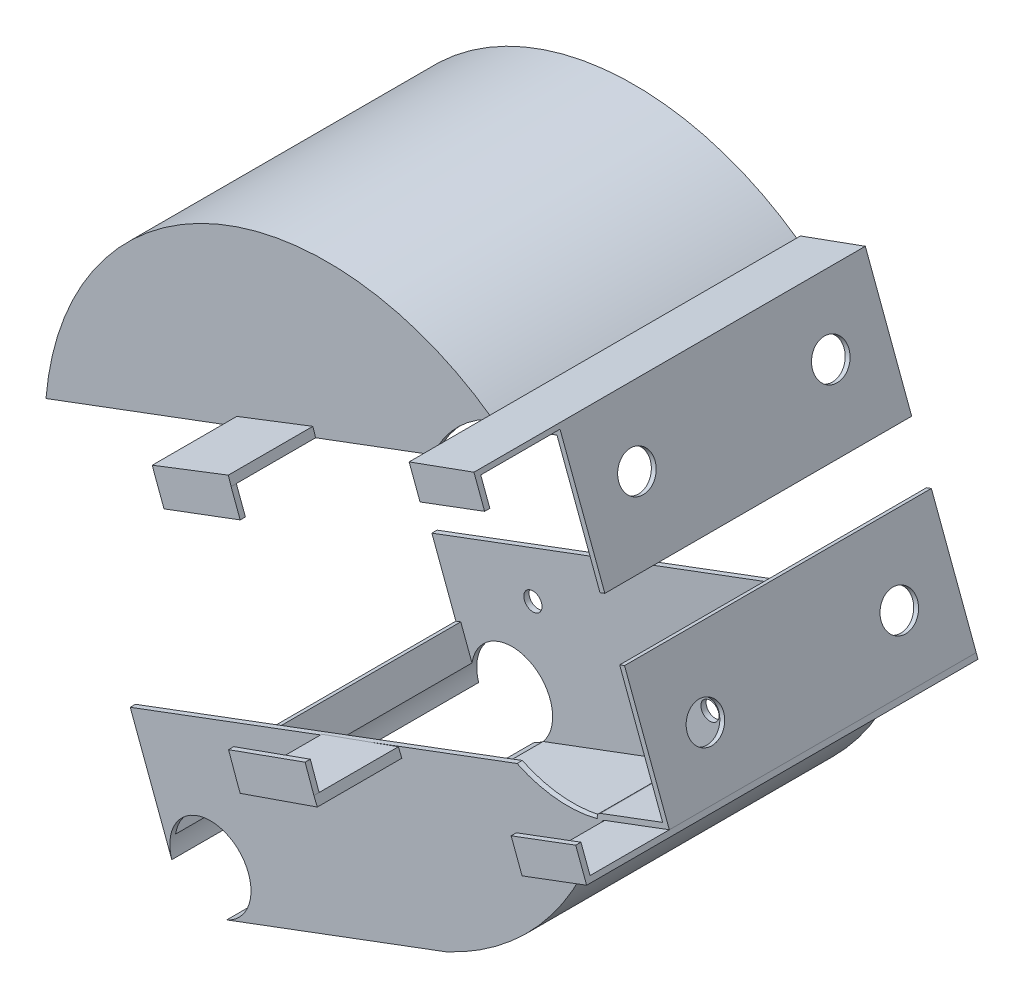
ISO-10303-21;
HEADER;
FILE_DESCRIPTION(('STEP AP214'),'2;1');
FILE_NAME('part.step','',(''),(''),'','','');
FILE_SCHEMA(('AUTOMOTIVE_DESIGN { 1 0 10303 214 1 1 1 1 }'));
ENDSEC;
DATA;
#1=APPLICATION_CONTEXT('core data for automotive mechanical design processes');
#2=APPLICATION_PROTOCOL_DEFINITION('international standard','automotive_design',2000,#1);
#3=PRODUCT_CONTEXT('',#1,'mechanical');
#4=PRODUCT('Part','Part','',(#3));
#5=PRODUCT_RELATED_PRODUCT_CATEGORY('part','',(#4));
#6=PRODUCT_DEFINITION_FORMATION('','',#4);
#7=PRODUCT_DEFINITION_CONTEXT('part definition',#1,'design');
#8=PRODUCT_DEFINITION('design','',#6,#7);
#9=PRODUCT_DEFINITION_SHAPE('','',#8);
#10=(LENGTH_UNIT() NAMED_UNIT(*) SI_UNIT(.MILLI.,.METRE.));
#11=(NAMED_UNIT(*) PLANE_ANGLE_UNIT() SI_UNIT($,.RADIAN.));
#12=(NAMED_UNIT(*) SI_UNIT($,.STERADIAN.) SOLID_ANGLE_UNIT());
#13=UNCERTAINTY_MEASURE_WITH_UNIT(LENGTH_MEASURE(1.E-05),#10,'distance_accuracy_value','');
#14=(GEOMETRIC_REPRESENTATION_CONTEXT(3) GLOBAL_UNCERTAINTY_ASSIGNED_CONTEXT((#13)) GLOBAL_UNIT_ASSIGNED_CONTEXT((#10,
#11,#12)) REPRESENTATION_CONTEXT('',''));
#15=CARTESIAN_POINT('',(0.,0.,0.));
#16=DIRECTION('',(0.,0.,1.));
#17=DIRECTION('',(1.,0.,0.));
#18=AXIS2_PLACEMENT_3D('',#15,#16,#17);
#19=CARTESIAN_POINT('',(65.7780443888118,-7.42924676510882,75.25));
#20=DIRECTION('',(0.350438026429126,-0.936585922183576,0.));
#21=DIRECTION('',(0.936585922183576,0.350438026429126,0.));
#22=AXIS2_PLACEMENT_3D('',#19,#20,#21);
#23=PLANE('',#22);
#24=DIRECTION('',(-0.936585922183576,-0.350438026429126,0.));
#25=VECTOR('',#24,1.);
#26=CARTESIAN_POINT('',(65.7780443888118,-7.42924676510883,74.25));
#27=LINE('',#26,#25);
#28=CARTESIAN_POINT('',(65.7780443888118,-7.42924676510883,74.25));
#29=VERTEX_POINT('',#28);
#30=CARTESIAN_POINT('',(53.3584026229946,-12.0762467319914,74.25));
#31=VERTEX_POINT('',#30);
#32=EDGE_CURVE('E776',#29,#31,#27,.T.);
#33=ORIENTED_EDGE('',*,*,#32,.F.);
#34=DIRECTION('',(0.,0.,-1.));
#35=VECTOR('',#34,1.);
#36=CARTESIAN_POINT('',(65.7780443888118,-7.42924676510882,75.25));
#37=LINE('',#36,#35);
#38=CARTESIAN_POINT('',(65.7780443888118,-7.42924676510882,59.));
#39=VERTEX_POINT('',#38);
#40=EDGE_CURVE('E524',#29,#39,#37,.T.);
#41=ORIENTED_EDGE('',*,*,#40,.T.);
#42=DIRECTION('',(-0.936585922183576,-0.350438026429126,0.));
#43=VECTOR('',#42,1.);
#44=CARTESIAN_POINT('',(65.7780443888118,-7.42924676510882,59.));
#45=LINE('',#44,#43);
#46=CARTESIAN_POINT('',(53.3584026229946,-12.0762467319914,59.));
#47=VERTEX_POINT('',#46);
#48=EDGE_CURVE('E829',#39,#47,#45,.T.);
#49=ORIENTED_EDGE('',*,*,#48,.T.);
#50=DIRECTION('',(0.,0.,-1.));
#51=VECTOR('',#50,1.);
#52=CARTESIAN_POINT('',(53.3584026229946,-12.0762467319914,75.25));
#53=LINE('',#52,#51);
#54=EDGE_CURVE('E822',#31,#47,#53,.T.);
#55=ORIENTED_EDGE('',*,*,#54,.F.);
#56=EDGE_LOOP('',(#33,#41,#49,#55));
#57=FACE_BOUND('',#56,.T.);
#58=ADVANCED_FACE('F520',(#57),#23,.F.);
#59=CARTESIAN_POINT('',(-1.04112452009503,-24.9238075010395,75.25));
#60=DIRECTION('',(0.337348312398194,-0.941379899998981,0.));
#61=DIRECTION('',(0.941379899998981,0.337348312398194,0.));
#62=AXIS2_PLACEMENT_3D('',#59,#60,#61);
#63=PLANE('',#62);
#64=DIRECTION('',(-0.941379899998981,-0.337348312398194,0.));
#65=VECTOR('',#64,1.);
#66=CARTESIAN_POINT('',(13.6827614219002,-19.6474275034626,74.25));
#67=LINE('',#66,#65);
#68=CARTESIAN_POINT('',(13.6827614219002,-19.6474275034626,74.25));
#69=VERTEX_POINT('',#68);
#70=CARTESIAN_POINT('',(-1.04112452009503,-24.9238075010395,74.25));
#71=VERTEX_POINT('',#70);
#72=EDGE_CURVE('E791',#69,#71,#67,.T.);
#73=ORIENTED_EDGE('',*,*,#72,.F.);
#74=DIRECTION('',(0.,0.,-1.));
#75=VECTOR('',#74,1.);
#76=CARTESIAN_POINT('',(13.6827614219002,-19.6474275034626,75.25));
#77=LINE('',#76,#75);
#78=CARTESIAN_POINT('',(13.6827614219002,-19.6474275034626,59.));
#79=VERTEX_POINT('',#78);
#80=EDGE_CURVE('E539',#69,#79,#77,.T.);
#81=ORIENTED_EDGE('',*,*,#80,.T.);
#82=DIRECTION('',(-0.941379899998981,-0.337348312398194,0.));
#83=VECTOR('',#82,1.);
#84=CARTESIAN_POINT('',(-1.04112452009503,-24.9238075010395,59.));
#85=LINE('',#84,#83);
#86=CARTESIAN_POINT('',(8.49601442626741,-21.5061248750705,59.));
#87=VERTEX_POINT('',#86);
#88=EDGE_CURVE('E870',#79,#87,#85,.T.);
#89=ORIENTED_EDGE('',*,*,#88,.T.);
#90=CARTESIAN_POINT('',(-1.04112452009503,-24.9238075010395,59.));
#91=VERTEX_POINT('',#90);
#92=EDGE_CURVE('E869',#87,#91,#85,.T.);
#93=ORIENTED_EDGE('',*,*,#92,.T.);
#94=DIRECTION('',(0.,0.,-1.));
#95=VECTOR('',#94,1.);
#96=CARTESIAN_POINT('',(-1.04112452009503,-24.9238075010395,75.25));
#97=LINE('',#96,#95);
#98=EDGE_CURVE('E836',#71,#91,#97,.T.);
#99=ORIENTED_EDGE('',*,*,#98,.F.);
#100=EDGE_LOOP('',(#73,#81,#89,#93,#99));
#101=FACE_BOUND('',#100,.T.);
#102=ADVANCED_FACE('F1252',(#101),#63,.F.);
#103=CARTESIAN_POINT('',(65.7780443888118,-7.42924676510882,59.));
#104=DIRECTION('',(0.,0.,1.));
#105=DIRECTION('',(1.,0.,0.));
#106=AXIS2_PLACEMENT_3D('',#103,#104,#105);
#107=PLANE('',#106);
#108=CARTESIAN_POINT('',(53.7088406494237,-13.012832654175,59.));
#109=DIRECTION('',(0.,0.,1.));
#110=DIRECTION('',(1.,0.,0.));
#111=AXIS2_PLACEMENT_3D('',#108,#109,#110);
#112=CIRCLE('',#111,1.);
#113=CARTESIAN_POINT('',(52.7369595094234,-12.7773606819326,59.));
#114=VERTEX_POINT('',#113);
#115=EDGE_CURVE('E994',#114,#47,#112,.F.);
#116=ORIENTED_EDGE('',*,*,#115,.T.);
#117=ORIENTED_EDGE('',*,*,#48,.F.);
#118=DIRECTION('',(-0.350271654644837,0.936648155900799,0.));
#119=VECTOR('',#118,1.);
#120=CARTESIAN_POINT('',(65.7780443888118,-7.42924676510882,59.));
#121=LINE('',#120,#119);
#122=CARTESIAN_POINT('',(57.1637333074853,15.6059560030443,59.));
#123=VERTEX_POINT('',#122);
#124=EDGE_CURVE('E936',#39,#123,#121,.T.);
#125=ORIENTED_EDGE('',*,*,#124,.T.);
#126=DIRECTION('',(0.936648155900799,0.350271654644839,0.));
#127=VECTOR('',#126,1.);
#128=CARTESIAN_POINT('',(57.1637333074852,15.6059560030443,59.));
#129=LINE('',#128,#127);
#130=CARTESIAN_POINT('',(56.2270851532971,15.2556843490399,59.));
#131=VERTEX_POINT('',#130);
#132=EDGE_CURVE('E1136',#131,#123,#129,.T.);
#133=ORIENTED_EDGE('',*,*,#132,.F.);
#134=DIRECTION('',(-0.350271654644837,0.936648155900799,0.));
#135=VECTOR('',#134,1.);
#136=CARTESIAN_POINT('',(64.8413750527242,-7.77946177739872,59.));
#137=LINE('',#136,#135);
#138=CARTESIAN_POINT('',(64.4911867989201,-6.84303664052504,59.));
#139=VERTEX_POINT('',#138);
#140=EDGE_CURVE('E1048',#139,#131,#137,.T.);
#141=ORIENTED_EDGE('',*,*,#140,.F.);
#142=DIRECTION('',(0.936585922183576,0.350438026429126,0.));
#143=VECTOR('',#142,1.);
#144=CARTESIAN_POINT('',(52.5086268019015,-11.3264957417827,59.));
#145=LINE('',#144,#143);
#146=CARTESIAN_POINT('',(52.5604667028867,-11.3070990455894,59.));
#147=VERTEX_POINT('',#146);
#148=EDGE_CURVE('E1034',#147,#139,#145,.T.);
#149=ORIENTED_EDGE('',*,*,#148,.F.);
#150=CARTESIAN_POINT('',(52.9109047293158,-12.243684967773,59.));
#151=DIRECTION('',(0.,0.,1.));
#152=DIRECTION('',(1.,0.,0.));
#153=AXIS2_PLACEMENT_3D('',#150,#151,#152);
#154=CIRCLE('',#153,1.);
#155=CARTESIAN_POINT('',(51.948504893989,-12.5153217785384,59.));
#156=VERTEX_POINT('',#155);
#157=EDGE_CURVE('E1026',#147,#156,#154,.T.);
#158=ORIENTED_EDGE('',*,*,#157,.T.);
#159=CARTESIAN_POINT('',(46.2609001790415,9.45736634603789,59.));
#160=DIRECTION('',(0.,0.,-1.));
#161=DIRECTION('',(-1.,0.,0.));
#162=AXIS2_PLACEMENT_3D('',#159,#160,#161);
#163=CIRCLE('',#162,22.6968691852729);
#164=CARTESIAN_POINT('',(36.4931143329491,-11.03014766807,59.));
#165=VERTEX_POINT('',#164);
#166=EDGE_CURVE('E973',#156,#165,#163,.T.);
#167=ORIENTED_EDGE('',*,*,#166,.T.);
#168=DIRECTION('',(-0.936581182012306,-0.350450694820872,0.));
#169=VECTOR('',#168,1.);
#170=CARTESIAN_POINT('',(36.4931143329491,-11.03014766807,59.));
#171=LINE('',#170,#169);
#172=EDGE_CURVE('E958',#165,#87,#171,.T.);
#173=ORIENTED_EDGE('',*,*,#172,.T.);
#174=ORIENTED_EDGE('',*,*,#88,.F.);
#175=DIRECTION('',(-0.378367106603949,0.925655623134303,0.));
#176=VECTOR('',#175,1.);
#177=CARTESIAN_POINT('',(13.6827614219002,-19.6474275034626,59.));
#178=LINE('',#177,#176);
#179=CARTESIAN_POINT('',(14.3352011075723,-21.2435875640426,59.));
#180=VERTEX_POINT('',#179);
#181=EDGE_CURVE('E546',#180,#79,#178,.T.);
#182=ORIENTED_EDGE('',*,*,#181,.F.);
#183=DIRECTION('',(0.945065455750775,0.326881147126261,0.));
#184=VECTOR('',#183,1.);
#185=CARTESIAN_POINT('',(14.3352011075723,-21.2435875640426,59.));
#186=LINE('',#185,#184);
#187=CARTESIAN_POINT('',(-0.478990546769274,-26.3675500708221,59.));
#188=VERTEX_POINT('',#187);
#189=EDGE_CURVE('E863',#188,#180,#186,.T.);
#190=ORIENTED_EDGE('',*,*,#189,.F.);
#191=DIRECTION('',(0.36282665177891,-0.931856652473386,0.));
#192=VECTOR('',#191,1.);
#193=CARTESIAN_POINT('',(-0.478990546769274,-26.3675500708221,59.));
#194=LINE('',#193,#192);
#195=CARTESIAN_POINT('',(-0.989830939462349,-25.0555460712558,59.));
#196=VERTEX_POINT('',#195);
#197=EDGE_CURVE('E13',#196,#188,#194,.T.);
#198=ORIENTED_EDGE('',*,*,#197,.F.);
#199=CARTESIAN_POINT('',(-37.8844579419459,-38.8608070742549,59.));
#200=VERTEX_POINT('',#199);
#201=EDGE_CURVE('E968',#196,#200,#171,.T.);
#202=ORIENTED_EDGE('',*,*,#201,.T.);
#203=DIRECTION('',(-0.350215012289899,0.9366693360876,0.));
#204=VECTOR('',#203,1.);
#205=CARTESIAN_POINT('',(-29.7648892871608,-60.5770405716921,59.));
#206=LINE('',#205,#204);
#207=CARTESIAN_POINT('',(-29.8876492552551,-60.2487122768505,59.));
#208=VERTEX_POINT('',#207);
#209=EDGE_CURVE('E942',#208,#200,#206,.T.);
#210=ORIENTED_EDGE('',*,*,#209,.F.);
#211=CARTESIAN_POINT('',(-22.4619561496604,-57.8451509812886,59.));
#212=DIRECTION('',(0.,0.,1.));
#213=DIRECTION('',(1.,0.,0.));
#214=AXIS2_PLACEMENT_3D('',#211,#212,#213);
#215=CIRCLE('',#214,7.805);
#216=CARTESIAN_POINT('',(-19.3278409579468,-64.9932519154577,59.));
#217=VERTEX_POINT('',#216);
#218=EDGE_CURVE('E873',#217,#208,#215,.T.);
#219=ORIENTED_EDGE('',*,*,#218,.F.);
#220=DIRECTION('',(-0.936648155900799,-0.350271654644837,0.));
#221=VECTOR('',#220,1.);
#222=CARTESIAN_POINT('',(-19.4944536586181,-65.0555588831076,59.));
#223=LINE('',#222,#221);
#224=CARTESIAN_POINT('',(22.8146158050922,-49.2335368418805,59.));
#225=VERTEX_POINT('',#224);
#226=EDGE_CURVE('E1038',#225,#217,#223,.T.);
#227=ORIENTED_EDGE('',*,*,#226,.F.);
#228=CARTESIAN_POINT('',(0.,0.,59.));
#229=DIRECTION('',(0.,0.,-1.));
#230=DIRECTION('',(-1.,0.,0.));
#231=AXIS2_PLACEMENT_3D('',#228,#229,#230);
#232=CIRCLE('',#231,54.2627666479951);
#233=EDGE_CURVE('E997',#114,#225,#232,.T.);
#234=ORIENTED_EDGE('',*,*,#233,.F.);
#235=EDGE_LOOP('',(#116,#117,#125,#133,#141,#149,#158,#167,#173,#174,#182,#190,#198,#202,#210,
#219,#227,#234));
#236=FACE_BOUND('',#235,.T.);
#237=ADVANCED_FACE('F522',(#236),#107,.T.);
#238=CARTESIAN_POINT('',(44.7617451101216,48.7696425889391,0.));
#239=DIRECTION('',(0.,0.,-1.));
#240=DIRECTION('',(-1.,0.,0.));
#241=AXIS2_PLACEMENT_3D('',#238,#239,#240);
#242=PLANE('',#241);
#243=CARTESIAN_POINT('',(-22.4619561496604,-57.8451509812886,0.));
#244=DIRECTION('',(0.,0.,-1.));
#245=DIRECTION('',(-1.,0.,0.));
#246=AXIS2_PLACEMENT_3D('',#243,#244,#245);
#247=CIRCLE('',#246,7.805);
#248=CARTESIAN_POINT('',(-29.8876492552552,-60.2487122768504,0.));
#249=VERTEX_POINT('',#248);
#250=CARTESIAN_POINT('',(-19.3278409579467,-64.9932519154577,0.));
#251=VERTEX_POINT('',#250);
#252=EDGE_CURVE('E899',#249,#251,#247,.T.);
#253=ORIENTED_EDGE('',*,*,#252,.F.);
#254=DIRECTION('',(-0.350215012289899,0.9366693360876,0.));
#255=VECTOR('',#254,1.);
#256=CARTESIAN_POINT('',(-29.7648892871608,-60.5770405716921,0.));
#257=LINE('',#256,#255);
#258=CARTESIAN_POINT('',(-37.8844579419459,-38.860807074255,0.));
#259=VERTEX_POINT('',#258);
#260=EDGE_CURVE('E1025',#249,#259,#257,.T.);
#261=ORIENTED_EDGE('',*,*,#260,.T.);
#262=DIRECTION('',(-0.936581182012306,-0.350450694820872,0.));
#263=VECTOR('',#262,1.);
#264=CARTESIAN_POINT('',(63.3740451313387,-0.971819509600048,0.));
#265=LINE('',#264,#263);
#266=CARTESIAN_POINT('',(36.4931143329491,-11.03014766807,0.));
#267=VERTEX_POINT('',#266);
#268=EDGE_CURVE('E943',#267,#259,#265,.T.);
#269=ORIENTED_EDGE('',*,*,#268,.F.);
#270=CARTESIAN_POINT('',(46.2609001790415,9.45736634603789,0.));
#271=DIRECTION('',(0.,0.,-1.));
#272=DIRECTION('',(-1.,0.,0.));
#273=AXIS2_PLACEMENT_3D('',#270,#271,#272);
#274=CIRCLE('',#273,22.6968691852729);
#275=CARTESIAN_POINT('',(51.9485048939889,-12.5153217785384,0.));
#276=VERTEX_POINT('',#275);
#277=EDGE_CURVE('E1007',#276,#267,#274,.T.);
#278=ORIENTED_EDGE('',*,*,#277,.F.);
#279=CARTESIAN_POINT('',(52.9109047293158,-12.243684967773,0.));
#280=DIRECTION('',(0.,0.,-1.));
#281=DIRECTION('',(-1.,0.,0.));
#282=AXIS2_PLACEMENT_3D('',#279,#280,#281);
#283=CIRCLE('',#282,1.);
#284=CARTESIAN_POINT('',(52.5604667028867,-11.3070990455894,0.));
#285=VERTEX_POINT('',#284);
#286=EDGE_CURVE('E1021',#276,#285,#283,.T.);
#287=ORIENTED_EDGE('',*,*,#286,.T.);
#288=DIRECTION('',(-0.936585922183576,-0.350438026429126,0.));
#289=VECTOR('',#288,1.);
#290=CARTESIAN_POINT('',(65.427772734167,-6.49259860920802,0.));
#291=LINE('',#290,#289);
#292=CARTESIAN_POINT('',(64.4911867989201,-6.84303664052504,0.));
#293=VERTEX_POINT('',#292);
#294=EDGE_CURVE('E1012',#293,#285,#291,.T.);
#295=ORIENTED_EDGE('',*,*,#294,.F.);
#296=DIRECTION('',(0.350271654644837,-0.936648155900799,0.));
#297=VECTOR('',#296,1.);
#298=CARTESIAN_POINT('',(43.825075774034,48.4194275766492,0.));
#299=LINE('',#298,#297);
#300=CARTESIAN_POINT('',(56.2270851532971,15.2556843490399,0.));
#301=VERTEX_POINT('',#300);
#302=EDGE_CURVE('E915',#301,#293,#299,.T.);
#303=ORIENTED_EDGE('',*,*,#302,.F.);
#304=DIRECTION('',(-0.936648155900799,-0.350271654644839,0.));
#305=VECTOR('',#304,1.);
#306=CARTESIAN_POINT('',(57.1637333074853,15.6059560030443,0.));
#307=LINE('',#306,#305);
#308=CARTESIAN_POINT('',(57.1637333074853,15.6059560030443,0.));
#309=VERTEX_POINT('',#308);
#310=EDGE_CURVE('E1142',#309,#301,#307,.T.);
#311=ORIENTED_EDGE('',*,*,#310,.F.);
#312=DIRECTION('',(0.350271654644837,-0.936648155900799,0.));
#313=VECTOR('',#312,1.);
#314=CARTESIAN_POINT('',(44.7617451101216,48.7696425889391,0.));
#315=LINE('',#314,#313);
#316=CARTESIAN_POINT('',(65.7780443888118,-7.42924676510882,0.));
#317=VERTEX_POINT('',#316);
#318=EDGE_CURVE('E932',#309,#317,#315,.T.);
#319=ORIENTED_EDGE('',*,*,#318,.T.);
#320=DIRECTION('',(0.350438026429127,-0.936585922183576,0.));
#321=VECTOR('',#320,1.);
#322=CARTESIAN_POINT('',(65.7780443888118,-7.42924676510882,0.));
#323=LINE('',#322,#321);
#324=CARTESIAN_POINT('',(66.1284824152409,-8.36583268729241,0.));
#325=VERTEX_POINT('',#324);
#326=EDGE_CURVE('E840',#317,#325,#323,.T.);
#327=ORIENTED_EDGE('',*,*,#326,.T.);
#328=DIRECTION('',(-0.936585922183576,-0.350438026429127,0.));
#329=VECTOR('',#328,1.);
#330=CARTESIAN_POINT('',(66.1284824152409,-8.36583268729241,0.));
#331=LINE('',#330,#329);
#332=CARTESIAN_POINT('',(53.7088406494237,-13.012832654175,0.));
#333=VERTEX_POINT('',#332);
#334=EDGE_CURVE('E841',#325,#333,#331,.T.);
#335=ORIENTED_EDGE('',*,*,#334,.T.);
#336=DIRECTION('',(-0.350438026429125,0.936585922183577,0.));
#337=VECTOR('',#336,1.);
#338=CARTESIAN_POINT('',(53.7088406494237,-13.012832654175,0.));
#339=LINE('',#338,#337);
#340=CARTESIAN_POINT('',(53.3584026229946,-12.0762467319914,0.));
#341=VERTEX_POINT('',#340);
#342=EDGE_CURVE('E833',#333,#341,#339,.T.);
#343=ORIENTED_EDGE('',*,*,#342,.T.);
#344=CARTESIAN_POINT('',(53.7088406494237,-13.012832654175,0.));
#345=DIRECTION('',(0.,0.,-1.));
#346=DIRECTION('',(-1.,0.,0.));
#347=AXIS2_PLACEMENT_3D('',#344,#345,#346);
#348=CIRCLE('',#347,1.);
#349=CARTESIAN_POINT('',(52.7369595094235,-12.7773606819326,0.));
#350=VERTEX_POINT('',#349);
#351=EDGE_CURVE('E935',#341,#350,#348,.F.);
#352=ORIENTED_EDGE('',*,*,#351,.T.);
#353=CARTESIAN_POINT('',(0.,0.,0.));
#354=DIRECTION('',(0.,0.,-1.));
#355=DIRECTION('',(-1.,0.,0.));
#356=AXIS2_PLACEMENT_3D('',#353,#354,#355);
#357=CIRCLE('',#356,54.2627666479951);
#358=CARTESIAN_POINT('',(22.8146158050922,-49.2335368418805,0.));
#359=VERTEX_POINT('',#358);
#360=EDGE_CURVE('E1172',#350,#359,#357,.T.);
#361=ORIENTED_EDGE('',*,*,#360,.T.);
#362=DIRECTION('',(-0.936648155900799,-0.350271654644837,0.));
#363=VECTOR('',#362,1.);
#364=CARTESIAN_POINT('',(-19.4944536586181,-65.0555588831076,0.));
#365=LINE('',#364,#363);
#366=EDGE_CURVE('E1156',#359,#251,#365,.T.);
#367=ORIENTED_EDGE('',*,*,#366,.T.);
#368=EDGE_LOOP('',(#253,#261,#269,#278,#287,#295,#303,#311,#319,#327,#335,#343,#352,#361,#367));
#369=FACE_BOUND('',#368,.T.);
#370=CARTESIAN_POINT('',(40.5127412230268,-18.4593661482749,0.));
#371=DIRECTION('',(0.,0.,1.));
#372=DIRECTION('',(-0.707106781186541,-0.707106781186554,0.));
#373=AXIS2_PLACEMENT_3D('',#370,#371,#372);
#374=CIRCLE('',#373,1.75);
#375=CARTESIAN_POINT('',(40.5127412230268,-20.2093661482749,0.));
#376=VERTEX_POINT('',#375);
#377=EDGE_CURVE('E1024',#376,#376,#374,.T.);
#378=ORIENTED_EDGE('',*,*,#377,.T.);
#379=EDGE_LOOP('',(#378));
#380=FACE_BOUND('',#379,.T.);
#381=CARTESIAN_POINT('',(15.5940910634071,-41.6995770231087,0.));
#382=DIRECTION('',(0.,0.,1.));
#383=DIRECTION('',(-1.,0.,0.));
#384=AXIS2_PLACEMENT_3D('',#381,#382,#383);
#385=CIRCLE('',#384,1.75);
#386=CARTESIAN_POINT('',(17.3440910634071,-41.6995770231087,0.));
#387=VERTEX_POINT('',#386);
#388=EDGE_CURVE('E1125',#387,#387,#385,.T.);
#389=ORIENTED_EDGE('',*,*,#388,.T.);
#390=EDGE_LOOP('',(#389));
#391=FACE_BOUND('',#390,.T.);
#392=CARTESIAN_POINT('',(-18.459366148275,-40.5127412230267,0.));
#393=DIRECTION('',(0.,0.,1.));
#394=DIRECTION('',(-0.707106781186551,0.707106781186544,0.));
#395=AXIS2_PLACEMENT_3D('',#392,#393,#394);
#396=CIRCLE('',#395,1.75);
#397=CARTESIAN_POINT('',(-16.709366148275,-40.5127412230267,0.));
#398=VERTEX_POINT('',#397);
#399=EDGE_CURVE('E920',#398,#398,#396,.T.);
#400=ORIENTED_EDGE('',*,*,#399,.T.);
#401=EDGE_LOOP('',(#400));
#402=FACE_BOUND('',#401,.T.);
#403=ADVANCED_FACE('F1279',(#369,#380,#391,#402),#242,.T.);
#404=CARTESIAN_POINT('',(54.3336545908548,20.3188352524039,0.));
#405=DIRECTION('',(-0.936648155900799,-0.350271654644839,0.));
#406=DIRECTION('',(0.350271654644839,-0.936648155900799,0.));
#407=AXIS2_PLACEMENT_3D('',#404,#405,#406);
#408=PLANE('',#407);
#409=CARTESIAN_POINT('',(60.9184159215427,2.71077454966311,10.86));
#410=DIRECTION('',(-0.936648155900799,-0.350271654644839,0.));
#411=DIRECTION('',(0.350271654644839,-0.936648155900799,0.));
#412=AXIS2_PLACEMENT_3D('',#409,#410,#411);
#413=CIRCLE('',#412,3.5);
#414=CARTESIAN_POINT('',(62.1443667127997,-0.567493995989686,10.86));
#415=VERTEX_POINT('',#414);
#416=EDGE_CURVE('E907',#415,#415,#413,.T.);
#417=ORIENTED_EDGE('',*,*,#416,.F.);
#418=EDGE_LOOP('',(#417));
#419=FACE_BOUND('',#418,.T.);
#420=CARTESIAN_POINT('',(60.9184159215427,2.71077454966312,48.14));
#421=DIRECTION('',(-0.936648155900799,-0.350271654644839,0.));
#422=DIRECTION('',(-0.350271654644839,0.936648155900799,0.));
#423=AXIS2_PLACEMENT_3D('',#420,#421,#422);
#424=CIRCLE('',#423,3.5);
#425=CARTESIAN_POINT('',(59.6924651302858,5.98904309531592,48.14));
#426=VERTEX_POINT('',#425);
#427=EDGE_CURVE('E906',#426,#426,#424,.T.);
#428=ORIENTED_EDGE('',*,*,#427,.F.);
#429=EDGE_LOOP('',(#428));
#430=FACE_BOUND('',#429,.T.);
#431=DIRECTION('',(0.,0.,1.));
#432=VECTOR('',#431,1.);
#433=CARTESIAN_POINT('',(56.2270851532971,15.2556843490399,-0.13092856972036));
#434=LINE('',#433,#432);
#435=EDGE_CURVE('E1144',#301,#131,#434,.T.);
#436=ORIENTED_EDGE('',*,*,#435,.F.);
#437=ORIENTED_EDGE('',*,*,#302,.T.);
#438=DIRECTION('',(0.,0.,1.));
#439=VECTOR('',#438,1.);
#440=CARTESIAN_POINT('',(64.4911867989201,-6.84303664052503,0.));
#441=LINE('',#440,#439);
#442=EDGE_CURVE('E919',#293,#139,#441,.T.);
#443=ORIENTED_EDGE('',*,*,#442,.T.);
#444=ORIENTED_EDGE('',*,*,#140,.T.);
#445=EDGE_LOOP('',(#436,#437,#443,#444));
#446=FACE_BOUND('',#445,.T.);
#447=ADVANCED_FACE('F1270',(#419,#430,#446),#408,.T.);
#448=CARTESIAN_POINT('',(55.2703239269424,20.6690502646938,0.));
#449=DIRECTION('',(-0.936648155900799,-0.350271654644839,0.));
#450=DIRECTION('',(0.350271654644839,-0.936648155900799,0.));
#451=AXIS2_PLACEMENT_3D('',#448,#449,#450);
#452=PLANE('',#451);
#453=CARTESIAN_POINT('',(61.8550640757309,3.06104620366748,10.86));
#454=DIRECTION('',(-0.936648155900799,-0.350271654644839,0.));
#455=DIRECTION('',(0.350271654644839,-0.936648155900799,0.));
#456=AXIS2_PLACEMENT_3D('',#453,#454,#455);
#457=CIRCLE('',#456,3.5);
#458=CARTESIAN_POINT('',(63.0810148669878,-0.217222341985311,10.86));
#459=VERTEX_POINT('',#458);
#460=EDGE_CURVE('E1029',#459,#459,#457,.T.);
#461=ORIENTED_EDGE('',*,*,#460,.T.);
#462=EDGE_LOOP('',(#461));
#463=FACE_BOUND('',#462,.T.);
#464=CARTESIAN_POINT('',(61.8550640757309,3.0610462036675,48.14));
#465=DIRECTION('',(-0.936648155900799,-0.350271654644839,0.));
#466=DIRECTION('',(0.350271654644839,-0.936648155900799,0.));
#467=AXIS2_PLACEMENT_3D('',#464,#465,#466);
#468=CIRCLE('',#467,3.5);
#469=CARTESIAN_POINT('',(63.0810148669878,-0.2172223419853,48.14));
#470=VERTEX_POINT('',#469);
#471=EDGE_CURVE('E911',#470,#470,#468,.T.);
#472=ORIENTED_EDGE('',*,*,#471,.T.);
#473=EDGE_LOOP('',(#472));
#474=FACE_BOUND('',#473,.T.);
#475=ORIENTED_EDGE('',*,*,#318,.F.);
#476=DIRECTION('',(0.,0.,1.));
#477=VECTOR('',#476,1.);
#478=CARTESIAN_POINT('',(57.1637333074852,15.6059560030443,0.));
#479=LINE('',#478,#477);
#480=EDGE_CURVE('E921',#309,#123,#479,.T.);
#481=ORIENTED_EDGE('',*,*,#480,.T.);
#482=ORIENTED_EDGE('',*,*,#124,.F.);
#483=DIRECTION('',(0.,0.,1.));
#484=VECTOR('',#483,1.);
#485=CARTESIAN_POINT('',(65.7780443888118,-7.42924676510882,0.));
#486=LINE('',#485,#484);
#487=EDGE_CURVE('E1006',#317,#39,#486,.T.);
#488=ORIENTED_EDGE('',*,*,#487,.F.);
#489=EDGE_LOOP('',(#475,#481,#482,#488));
#490=FACE_BOUND('',#489,.T.);
#491=ADVANCED_FACE('F1264',(#463,#474,#490),#452,.F.);
#492=CARTESIAN_POINT('',(36.4931143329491,-11.03014766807,59.));
#493=DIRECTION('',(0.350450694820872,-0.936581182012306,0.));
#494=DIRECTION('',(0.936581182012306,0.350450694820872,0.));
#495=AXIS2_PLACEMENT_3D('',#492,#493,#494);
#496=PLANE('',#495);
#497=DIRECTION('',(-0.936581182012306,-0.350450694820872,0.));
#498=VECTOR('',#497,1.);
#499=CARTESIAN_POINT('',(36.4931143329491,-11.03014766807,58.));
#500=LINE('',#499,#498);
#501=CARTESIAN_POINT('',(36.4931143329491,-11.03014766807,58.));
#502=VERTEX_POINT('',#501);
#503=CARTESIAN_POINT('',(-37.8844579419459,-38.8608070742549,58.));
#504=VERTEX_POINT('',#503);
#505=EDGE_CURVE('E1068',#502,#504,#500,.T.);
#506=ORIENTED_EDGE('',*,*,#505,.T.);
#507=DIRECTION('',(0.,0.,-1.));
#508=VECTOR('',#507,1.);
#509=CARTESIAN_POINT('',(-37.8844579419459,-38.8608070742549,59.));
#510=LINE('',#509,#508);
#511=EDGE_CURVE('E950',#200,#504,#510,.T.);
#512=ORIENTED_EDGE('',*,*,#511,.F.);
#513=ORIENTED_EDGE('',*,*,#201,.F.);
#514=EDGE_CURVE('E964',#87,#196,#171,.T.);
#515=ORIENTED_EDGE('',*,*,#514,.F.);
#516=ORIENTED_EDGE('',*,*,#172,.F.);
#517=DIRECTION('',(0.,0.,-1.));
#518=VECTOR('',#517,1.);
#519=CARTESIAN_POINT('',(36.4931143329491,-11.03014766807,59.));
#520=LINE('',#519,#518);
#521=EDGE_CURVE('E1062',#165,#502,#520,.T.);
#522=ORIENTED_EDGE('',*,*,#521,.T.);
#523=EDGE_LOOP('',(#506,#512,#513,#515,#516,#522));
#524=FACE_BOUND('',#523,.T.);
#525=ADVANCED_FACE('F1200',(#524),#496,.F.);
#526=CARTESIAN_POINT('',(-37.8844579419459,-38.8608070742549,1.00000000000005));
#527=VERTEX_POINT('',#526);
#528=EDGE_CURVE('E937',#527,#259,#510,.T.);
#529=ORIENTED_EDGE('',*,*,#528,.F.);
#530=DIRECTION('',(-0.936581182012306,-0.350450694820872,0.));
#531=VECTOR('',#530,1.);
#532=CARTESIAN_POINT('',(63.3740451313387,-0.971819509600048,1.));
#533=LINE('',#532,#531);
#534=CARTESIAN_POINT('',(36.4931143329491,-11.03014766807,1.));
#535=VERTEX_POINT('',#534);
#536=EDGE_CURVE('E1071',#535,#527,#533,.T.);
#537=ORIENTED_EDGE('',*,*,#536,.F.);
#538=EDGE_CURVE('E1186',#535,#267,#520,.T.);
#539=ORIENTED_EDGE('',*,*,#538,.T.);
#540=ORIENTED_EDGE('',*,*,#268,.T.);
#541=EDGE_LOOP('',(#529,#537,#539,#540));
#542=FACE_BOUND('',#541,.T.);
#543=ADVANCED_FACE('F1381',(#542),#496,.F.);
#544=CARTESIAN_POINT('',(-29.7648892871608,-60.5770405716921,0.));
#545=DIRECTION('',(0.936669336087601,0.350215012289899,0.));
#546=DIRECTION('',(-0.350215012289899,0.936669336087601,0.));
#547=AXIS2_PLACEMENT_3D('',#544,#545,#546);
#548=PLANE('',#547);
#549=ORIENTED_EDGE('',*,*,#260,.F.);
#550=DIRECTION('',(0.,0.,1.));
#551=VECTOR('',#550,1.);
#552=CARTESIAN_POINT('',(-29.8876492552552,-60.2487122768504,-0.000353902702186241));
#553=LINE('',#552,#551);
#554=EDGE_CURVE('E902',#249,#208,#553,.T.);
#555=ORIENTED_EDGE('',*,*,#554,.T.);
#556=ORIENTED_EDGE('',*,*,#209,.T.);
#557=ORIENTED_EDGE('',*,*,#511,.T.);
#558=DIRECTION('',(-0.350215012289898,0.936669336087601,0.));
#559=VECTOR('',#558,1.);
#560=CARTESIAN_POINT('',(-33.2670394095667,-51.2103472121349,58.));
#561=LINE('',#560,#559);
#562=CARTESIAN_POINT('',(-33.2670394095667,-51.2103472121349,58.));
#563=VERTEX_POINT('',#562);
#564=EDGE_CURVE('E1078',#563,#504,#561,.T.);
#565=ORIENTED_EDGE('',*,*,#564,.F.);
#566=DIRECTION('',(0.,0.,1.));
#567=VECTOR('',#566,1.);
#568=CARTESIAN_POINT('',(-33.2670394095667,-51.2103472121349,58.));
#569=LINE('',#568,#567);
#570=CARTESIAN_POINT('',(-33.2670394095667,-51.2103472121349,1.00000000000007));
#571=VERTEX_POINT('',#570);
#572=EDGE_CURVE('E1087',#571,#563,#569,.T.);
#573=ORIENTED_EDGE('',*,*,#572,.F.);
#574=DIRECTION('',(0.350215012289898,-0.936669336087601,0.));
#575=VECTOR('',#574,1.);
#576=CARTESIAN_POINT('',(-58.6926493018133,16.7918465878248,0.999999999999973));
#577=LINE('',#576,#575);
#578=EDGE_CURVE('E1074',#527,#571,#577,.T.);
#579=ORIENTED_EDGE('',*,*,#578,.F.);
#580=ORIENTED_EDGE('',*,*,#528,.T.);
#581=EDGE_LOOP('',(#549,#555,#556,#557,#565,#573,#579,#580));
#582=FACE_BOUND('',#581,.T.);
#583=ADVANCED_FACE('F1237',(#582),#548,.F.);
#584=CARTESIAN_POINT('',(-28.8282199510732,-60.2268255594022,0.));
#585=DIRECTION('',(0.936669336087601,0.350215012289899,0.));
#586=DIRECTION('',(-0.350215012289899,0.936669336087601,0.));
#587=AXIS2_PLACEMENT_3D('',#584,#585,#586);
#588=PLANE('',#587);
#589=DIRECTION('',(0.,0.,1.));
#590=VECTOR('',#589,1.);
#591=CARTESIAN_POINT('',(-30.1721589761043,-56.632386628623,-0.000353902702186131));
#592=LINE('',#591,#590);
#593=CARTESIAN_POINT('',(-30.1721589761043,-56.632386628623,1.));
#594=VERTEX_POINT('',#593);
#595=CARTESIAN_POINT('',(-30.1721589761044,-56.632386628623,58.));
#596=VERTEX_POINT('',#595);
#597=EDGE_CURVE('E892',#594,#596,#592,.T.);
#598=ORIENTED_EDGE('',*,*,#597,.F.);
#599=DIRECTION('',(-0.350215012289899,0.936669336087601,0.));
#600=VECTOR('',#599,1.);
#601=CARTESIAN_POINT('',(-28.8282199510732,-60.2268255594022,1.));
#602=LINE('',#601,#600);
#603=CARTESIAN_POINT('',(-32.3303700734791,-50.860132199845,1.));
#604=VERTEX_POINT('',#603);
#605=EDGE_CURVE('E955',#594,#604,#602,.T.);
#606=ORIENTED_EDGE('',*,*,#605,.T.);
#607=DIRECTION('',(0.,0.,1.));
#608=VECTOR('',#607,1.);
#609=CARTESIAN_POINT('',(-32.3303700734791,-50.8601321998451,0.));
#610=LINE('',#609,#608);
#611=CARTESIAN_POINT('',(-32.3303700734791,-50.860132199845,58.));
#612=VERTEX_POINT('',#611);
#613=EDGE_CURVE('E944',#604,#612,#610,.T.);
#614=ORIENTED_EDGE('',*,*,#613,.T.);
#615=DIRECTION('',(-0.350215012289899,0.936669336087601,0.));
#616=VECTOR('',#615,1.);
#617=CARTESIAN_POINT('',(-34.5441979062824,-44.9391277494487,58.));
#618=LINE('',#617,#616);
#619=EDGE_CURVE('E1095',#596,#612,#618,.T.);
#620=ORIENTED_EDGE('',*,*,#619,.F.);
#621=EDGE_LOOP('',(#598,#606,#614,#620));
#622=FACE_BOUND('',#621,.T.);
#623=ADVANCED_FACE('F1225',(#622),#588,.T.);
#624=CARTESIAN_POINT('',(46.2609001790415,9.45736634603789,59.));
#625=DIRECTION('',(0.,0.,-1.));
#626=DIRECTION('',(0.,1.,0.));
#627=AXIS2_PLACEMENT_3D('',#624,#625,#626);
#628=CYLINDRICAL_SURFACE('',#627,22.6968691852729);
#629=CARTESIAN_POINT('',(46.2609001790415,9.45736634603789,1.));
#630=DIRECTION('',(0.,0.,-1.));
#631=DIRECTION('',(-1.,0.,0.));
#632=AXIS2_PLACEMENT_3D('',#629,#630,#631);
#633=CIRCLE('',#632,22.6968691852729);
#634=CARTESIAN_POINT('',(51.7598902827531,-12.5632825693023,1.));
#635=VERTEX_POINT('',#634);
#636=EDGE_CURVE('E1075',#635,#535,#633,.T.);
#637=ORIENTED_EDGE('',*,*,#636,.F.);
#638=DIRECTION('',(0.,0.,-1.));
#639=VECTOR('',#638,1.);
#640=CARTESIAN_POINT('',(51.7598902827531,-12.5632825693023,59.));
#641=LINE('',#640,#639);
#642=CARTESIAN_POINT('',(51.7598902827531,-12.5632825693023,58.));
#643=VERTEX_POINT('',#642);
#644=EDGE_CURVE('E1063',#635,#643,#641,.F.);
#645=ORIENTED_EDGE('',*,*,#644,.T.);
#646=CARTESIAN_POINT('',(46.2609001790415,9.45736634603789,58.));
#647=DIRECTION('',(0.,0.,1.));
#648=DIRECTION('',(1.,0.,0.));
#649=AXIS2_PLACEMENT_3D('',#646,#647,#648);
#650=CIRCLE('',#649,22.6968691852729);
#651=EDGE_CURVE('E1067',#643,#502,#650,.F.);
#652=ORIENTED_EDGE('',*,*,#651,.T.);
#653=ORIENTED_EDGE('',*,*,#521,.F.);
#654=ORIENTED_EDGE('',*,*,#166,.F.);
#655=DIRECTION('',(0.,0.,-1.));
#656=VECTOR('',#655,1.);
#657=CARTESIAN_POINT('',(51.9485048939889,-12.5153217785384,59.));
#658=LINE('',#657,#656);
#659=EDGE_CURVE('E1015',#156,#276,#658,.T.);
#660=ORIENTED_EDGE('',*,*,#659,.T.);
#661=ORIENTED_EDGE('',*,*,#277,.T.);
#662=ORIENTED_EDGE('',*,*,#538,.F.);
#663=EDGE_LOOP('',(#637,#645,#652,#653,#654,#660,#661,#662));
#664=FACE_BOUND('',#663,.T.);
#665=ADVANCED_FACE('F1207',(#664),#628,.F.);
#666=CARTESIAN_POINT('',(10.1661127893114,-27.169598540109,0.));
#667=DIRECTION('',(0.350438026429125,-0.936585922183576,0.));
#668=DIRECTION('',(0.936585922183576,0.350438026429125,0.));
#669=AXIS2_PLACEMENT_3D('',#666,#667,#668);
#670=PLANE('',#669);
#671=ORIENTED_EDGE('',*,*,#294,.T.);
#672=DIRECTION('',(0.,0.,-1.));
#673=VECTOR('',#672,1.);
#674=CARTESIAN_POINT('',(52.5604667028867,-11.3070990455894,0.));
#675=LINE('',#674,#673);
#676=EDGE_CURVE('E1030',#285,#147,#675,.F.);
#677=ORIENTED_EDGE('',*,*,#676,.T.);
#678=ORIENTED_EDGE('',*,*,#148,.T.);
#679=ORIENTED_EDGE('',*,*,#442,.F.);
#680=EDGE_LOOP('',(#671,#677,#678,#679));
#681=FACE_BOUND('',#680,.T.);
#682=ADVANCED_FACE('F1275',(#681),#670,.F.);
#683=CARTESIAN_POINT('',(-19.4944536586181,-65.0555588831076,0.));
#684=DIRECTION('',(-0.350271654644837,0.936648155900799,0.));
#685=DIRECTION('',(-0.936648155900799,-0.350271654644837,0.));
#686=AXIS2_PLACEMENT_3D('',#683,#684,#685);
#687=PLANE('',#686);
#688=ORIENTED_EDGE('',*,*,#226,.T.);
#689=DIRECTION('',(0.,0.,1.));
#690=VECTOR('',#689,1.);
#691=CARTESIAN_POINT('',(-19.3278409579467,-64.9932519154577,-0.000353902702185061));
#692=LINE('',#691,#690);
#693=EDGE_CURVE('E895',#217,#251,#692,.F.);
#694=ORIENTED_EDGE('',*,*,#693,.T.);
#695=ORIENTED_EDGE('',*,*,#366,.F.);
#696=DIRECTION('',(0.,0.,1.));
#697=VECTOR('',#696,1.);
#698=CARTESIAN_POINT('',(22.8146158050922,-49.2335368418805,0.));
#699=LINE('',#698,#697);
#700=EDGE_CURVE('E1164',#359,#225,#699,.T.);
#701=ORIENTED_EDGE('',*,*,#700,.T.);
#702=EDGE_LOOP('',(#688,#694,#695,#701));
#703=FACE_BOUND('',#702,.T.);
#704=ADVANCED_FACE('F1372',(#703),#687,.F.);
#705=CARTESIAN_POINT('',(0.,0.,0.));
#706=DIRECTION('',(0.,0.,1.));
#707=DIRECTION('',(1.,0.,0.));
#708=AXIS2_PLACEMENT_3D('',#705,#706,#707);
#709=CYLINDRICAL_SURFACE('',#708,54.2627666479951);
#710=ORIENTED_EDGE('',*,*,#360,.F.);
#711=DIRECTION('',(0.,0.,1.));
#712=VECTOR('',#711,1.);
#713=CARTESIAN_POINT('',(52.7369595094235,-12.7773606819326,0.));
#714=LINE('',#713,#712);
#715=EDGE_CURVE('E1178',#350,#114,#714,.T.);
#716=ORIENTED_EDGE('',*,*,#715,.T.);
#717=ORIENTED_EDGE('',*,*,#233,.T.);
#718=ORIENTED_EDGE('',*,*,#700,.F.);
#719=EDGE_LOOP('',(#710,#716,#717,#718));
#720=FACE_BOUND('',#719,.T.);
#721=ADVANCED_FACE('F1369',(#720),#709,.T.);
#722=CARTESIAN_POINT('',(52.9109047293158,-12.243684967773,59.));
#723=DIRECTION('',(0.,0.,-1.));
#724=DIRECTION('',(0.,1.,0.));
#725=AXIS2_PLACEMENT_3D('',#722,#723,#724);
#726=CYLINDRICAL_SURFACE('',#725,1.);
#727=ORIENTED_EDGE('',*,*,#286,.F.);
#728=ORIENTED_EDGE('',*,*,#659,.F.);
#729=ORIENTED_EDGE('',*,*,#157,.F.);
#730=ORIENTED_EDGE('',*,*,#676,.F.);
#731=EDGE_LOOP('',(#727,#728,#729,#730));
#732=FACE_BOUND('',#731,.T.);
#733=ADVANCED_FACE('F1285',(#732),#726,.T.);
#734=CARTESIAN_POINT('',(53.7088406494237,-13.012832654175,0.));
#735=DIRECTION('',(0.,0.,1.));
#736=DIRECTION('',(1.,0.,0.));
#737=AXIS2_PLACEMENT_3D('',#734,#735,#736);
#738=CYLINDRICAL_SURFACE('',#737,1.);
#739=ORIENTED_EDGE('',*,*,#115,.F.);
#740=ORIENTED_EDGE('',*,*,#715,.F.);
#741=ORIENTED_EDGE('',*,*,#351,.F.);
#742=DIRECTION('',(0.,0.,1.));
#743=VECTOR('',#742,1.);
#744=CARTESIAN_POINT('',(53.3584026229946,-12.0762467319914,0.));
#745=LINE('',#744,#743);
#746=EDGE_CURVE('E1003',#47,#341,#745,.F.);
#747=ORIENTED_EDGE('',*,*,#746,.F.);
#748=EDGE_LOOP('',(#739,#740,#741,#747));
#749=FACE_BOUND('',#748,.T.);
#750=ADVANCED_FACE('F1004',(#749),#738,.F.);
#751=CARTESIAN_POINT('',(44.7617451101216,48.7696425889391,1.));
#752=DIRECTION('',(0.,0.,-1.));
#753=DIRECTION('',(-1.,0.,0.));
#754=AXIS2_PLACEMENT_3D('',#751,#752,#753);
#755=PLANE('',#754);
#756=CARTESIAN_POINT('',(-18.459366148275,-40.5127412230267,1.));
#757=DIRECTION('',(0.,0.,-1.));
#758=DIRECTION('',(-1.,0.,0.));
#759=AXIS2_PLACEMENT_3D('',#756,#757,#758);
#760=CIRCLE('',#759,1.75);
#761=CARTESIAN_POINT('',(-16.709366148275,-40.5127412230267,1.));
#762=VERTEX_POINT('',#761);
#763=EDGE_CURVE('E1129',#762,#762,#760,.F.);
#764=ORIENTED_EDGE('',*,*,#763,.F.);
#765=EDGE_LOOP('',(#764));
#766=FACE_BOUND('',#765,.T.);
#767=CARTESIAN_POINT('',(15.5940910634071,-41.6995770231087,1.));
#768=DIRECTION('',(0.,0.,-1.));
#769=DIRECTION('',(-1.,0.,0.));
#770=AXIS2_PLACEMENT_3D('',#767,#768,#769);
#771=CIRCLE('',#770,1.75);
#772=CARTESIAN_POINT('',(17.3440910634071,-41.6995770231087,1.));
#773=VERTEX_POINT('',#772);
#774=EDGE_CURVE('E1120',#773,#773,#771,.F.);
#775=ORIENTED_EDGE('',*,*,#774,.F.);
#776=EDGE_LOOP('',(#775));
#777=FACE_BOUND('',#776,.T.);
#778=CARTESIAN_POINT('',(40.5127412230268,-18.4593661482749,1.));
#779=DIRECTION('',(0.,0.,-1.));
#780=DIRECTION('',(-1.,0.,0.));
#781=AXIS2_PLACEMENT_3D('',#778,#779,#780);
#782=CIRCLE('',#781,1.75);
#783=CARTESIAN_POINT('',(40.5127412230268,-20.2093661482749,1.));
#784=VERTEX_POINT('',#783);
#785=EDGE_CURVE('E1116',#784,#784,#782,.F.);
#786=ORIENTED_EDGE('',*,*,#785,.F.);
#787=EDGE_LOOP('',(#786));
#788=FACE_BOUND('',#787,.T.);
#789=ORIENTED_EDGE('',*,*,#605,.F.);
#790=CARTESIAN_POINT('',(-22.4619561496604,-57.8451509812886,1.));
#791=DIRECTION('',(0.,0.,-1.));
#792=DIRECTION('',(-1.,0.,0.));
#793=AXIS2_PLACEMENT_3D('',#790,#791,#792);
#794=CIRCLE('',#793,7.805);
#795=CARTESIAN_POINT('',(-16.4825319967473,-62.8615751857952,1.));
#796=VERTEX_POINT('',#795);
#797=EDGE_CURVE('E888',#594,#796,#794,.T.);
#798=ORIENTED_EDGE('',*,*,#797,.T.);
#799=DIRECTION('',(-0.936648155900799,-0.350271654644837,0.));
#800=VECTOR('',#799,1.);
#801=CARTESIAN_POINT('',(-19.8447253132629,-64.1189107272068,1.));
#802=LINE('',#801,#800);
#803=CARTESIAN_POINT('',(22.4285323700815,-48.3102809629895,1.));
#804=VERTEX_POINT('',#803);
#805=EDGE_CURVE('E1091',#804,#796,#802,.T.);
#806=ORIENTED_EDGE('',*,*,#805,.F.);
#807=CARTESIAN_POINT('',(0.,0.,1.));
#808=DIRECTION('',(0.,0.,-1.));
#809=DIRECTION('',(-1.,0.,0.));
#810=AXIS2_PLACEMENT_3D('',#807,#808,#809);
#811=CIRCLE('',#810,53.2627666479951);
#812=EDGE_CURVE('E1088',#635,#804,#811,.T.);
#813=ORIENTED_EDGE('',*,*,#812,.F.);
#814=ORIENTED_EDGE('',*,*,#636,.T.);
#815=ORIENTED_EDGE('',*,*,#536,.T.);
#816=ORIENTED_EDGE('',*,*,#578,.T.);
#817=DIRECTION('',(0.936669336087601,0.350215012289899,0.));
#818=VECTOR('',#817,1.);
#819=CARTESIAN_POINT('',(-33.2670394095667,-51.2103472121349,1.00000000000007));
#820=LINE('',#819,#818);
#821=EDGE_CURVE('E1079',#571,#604,#820,.T.);
#822=ORIENTED_EDGE('',*,*,#821,.T.);
#823=EDGE_LOOP('',(#789,#798,#806,#813,#814,#815,#816,#822));
#824=FACE_BOUND('',#823,.T.);
#825=ADVANCED_FACE('F1366',(#766,#777,#788,#824),#755,.F.);
#826=CARTESIAN_POINT('',(65.7780443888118,-7.42924676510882,58.));
#827=DIRECTION('',(0.,0.,1.));
#828=DIRECTION('',(1.,0.,0.));
#829=AXIS2_PLACEMENT_3D('',#826,#827,#828);
#830=PLANE('',#829);
#831=DIRECTION('',(-0.936648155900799,-0.350271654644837,0.));
#832=VECTOR('',#831,1.);
#833=CARTESIAN_POINT('',(73.8717855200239,-29.0724131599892,58.));
#834=LINE('',#833,#832);
#835=CARTESIAN_POINT('',(22.4285323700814,-48.3102809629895,58.));
#836=VERTEX_POINT('',#835);
#837=CARTESIAN_POINT('',(-16.4825319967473,-62.8615751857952,58.));
#838=VERTEX_POINT('',#837);
#839=EDGE_CURVE('E1101',#836,#838,#834,.T.);
#840=ORIENTED_EDGE('',*,*,#839,.T.);
#841=CARTESIAN_POINT('',(-22.4619561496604,-57.8451509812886,58.));
#842=DIRECTION('',(0.,0.,1.));
#843=DIRECTION('',(1.,0.,0.));
#844=AXIS2_PLACEMENT_3D('',#841,#842,#843);
#845=CIRCLE('',#844,7.805);
#846=EDGE_CURVE('E884',#838,#596,#845,.T.);
#847=ORIENTED_EDGE('',*,*,#846,.T.);
#848=ORIENTED_EDGE('',*,*,#619,.T.);
#849=DIRECTION('',(0.936669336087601,0.350215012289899,0.));
#850=VECTOR('',#849,1.);
#851=CARTESIAN_POINT('',(-33.2670394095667,-51.2103472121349,58.));
#852=LINE('',#851,#850);
#853=EDGE_CURVE('E1121',#563,#612,#852,.T.);
#854=ORIENTED_EDGE('',*,*,#853,.F.);
#855=ORIENTED_EDGE('',*,*,#564,.T.);
#856=ORIENTED_EDGE('',*,*,#505,.F.);
#857=ORIENTED_EDGE('',*,*,#651,.F.);
#858=CARTESIAN_POINT('',(0.,0.,58.));
#859=DIRECTION('',(0.,0.,1.));
#860=DIRECTION('',(1.,0.,0.));
#861=AXIS2_PLACEMENT_3D('',#858,#859,#860);
#862=CIRCLE('',#861,53.2627666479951);
#863=EDGE_CURVE('E1098',#643,#836,#862,.F.);
#864=ORIENTED_EDGE('',*,*,#863,.T.);
#865=EDGE_LOOP('',(#840,#847,#848,#854,#855,#856,#857,#864));
#866=FACE_BOUND('',#865,.T.);
#867=ADVANCED_FACE('F1211',(#866),#830,.F.);
#868=CARTESIAN_POINT('',(-19.8447253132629,-64.1189107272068,0.));
#869=DIRECTION('',(-0.350271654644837,0.936648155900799,0.));
#870=DIRECTION('',(-0.936648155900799,-0.350271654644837,0.));
#871=AXIS2_PLACEMENT_3D('',#868,#869,#870);
#872=PLANE('',#871);
#873=DIRECTION('',(0.,0.,1.));
#874=VECTOR('',#873,1.);
#875=CARTESIAN_POINT('',(-16.4825319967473,-62.8615751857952,-0.000353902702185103));
#876=LINE('',#875,#874);
#877=EDGE_CURVE('E530',#838,#796,#876,.F.);
#878=ORIENTED_EDGE('',*,*,#877,.F.);
#879=ORIENTED_EDGE('',*,*,#839,.F.);
#880=DIRECTION('',(0.,0.,1.));
#881=VECTOR('',#880,1.);
#882=CARTESIAN_POINT('',(22.4285323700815,-48.3102809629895,1.));
#883=LINE('',#882,#881);
#884=EDGE_CURVE('E1083',#804,#836,#883,.T.);
#885=ORIENTED_EDGE('',*,*,#884,.F.);
#886=ORIENTED_EDGE('',*,*,#805,.T.);
#887=EDGE_LOOP('',(#878,#879,#885,#886));
#888=FACE_BOUND('',#887,.T.);
#889=ADVANCED_FACE('F1219',(#888),#872,.T.);
#890=CARTESIAN_POINT('',(0.,0.,0.));
#891=DIRECTION('',(0.,0.,1.));
#892=DIRECTION('',(1.,0.,0.));
#893=AXIS2_PLACEMENT_3D('',#890,#891,#892);
#894=CYLINDRICAL_SURFACE('',#893,53.2627666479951);
#895=ORIENTED_EDGE('',*,*,#812,.T.);
#896=ORIENTED_EDGE('',*,*,#884,.T.);
#897=ORIENTED_EDGE('',*,*,#863,.F.);
#898=ORIENTED_EDGE('',*,*,#644,.F.);
#899=EDGE_LOOP('',(#895,#896,#897,#898));
#900=FACE_BOUND('',#899,.T.);
#901=ADVANCED_FACE('F1213',(#900),#894,.F.);
#902=CARTESIAN_POINT('',(-33.2670394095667,-51.2103472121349,58.));
#903=DIRECTION('',(-0.350215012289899,0.936669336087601,0.));
#904=DIRECTION('',(-0.936669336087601,-0.350215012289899,0.));
#905=AXIS2_PLACEMENT_3D('',#902,#903,#904);
#906=PLANE('',#905);
#907=ORIENTED_EDGE('',*,*,#821,.F.);
#908=ORIENTED_EDGE('',*,*,#572,.T.);
#909=ORIENTED_EDGE('',*,*,#853,.T.);
#910=ORIENTED_EDGE('',*,*,#613,.F.);
#911=EDGE_LOOP('',(#907,#908,#909,#910));
#912=FACE_BOUND('',#911,.T.);
#913=ADVANCED_FACE('F1390',(#912),#906,.T.);
#914=CARTESIAN_POINT('',(40.5127412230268,-18.4593661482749,0.));
#915=DIRECTION('',(0.,0.,1.));
#916=DIRECTION('',(0.,-1.,0.));
#917=AXIS2_PLACEMENT_3D('',#914,#915,#916);
#918=CYLINDRICAL_SURFACE('',#917,1.75);
#919=CARTESIAN_POINT('',(40.5127412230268,-20.2093661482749,0.));
#920=CARTESIAN_POINT('',(40.5127412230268,-20.2093661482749,0.0104166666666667));
#921=CARTESIAN_POINT('',(40.5127412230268,-20.2093661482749,0.0208333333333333));
#922=CARTESIAN_POINT('',(40.5127412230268,-20.2093661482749,0.0416666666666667));
#923=CARTESIAN_POINT('',(40.5127412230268,-20.2093661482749,0.0520833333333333));
#924=CARTESIAN_POINT('',(40.5127412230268,-20.2093661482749,0.0729166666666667));
#925=CARTESIAN_POINT('',(40.5127412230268,-20.2093661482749,0.0833333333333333));
#926=CARTESIAN_POINT('',(40.5127412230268,-20.2093661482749,0.104166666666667));
#927=CARTESIAN_POINT('',(40.5127412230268,-20.2093661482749,0.114583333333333));
#928=CARTESIAN_POINT('',(40.5127412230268,-20.2093661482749,0.135416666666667));
#929=CARTESIAN_POINT('',(40.5127412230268,-20.2093661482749,0.145833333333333));
#930=CARTESIAN_POINT('',(40.5127412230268,-20.2093661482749,0.166666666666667));
#931=CARTESIAN_POINT('',(40.5127412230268,-20.2093661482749,0.177083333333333));
#932=CARTESIAN_POINT('',(40.5127412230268,-20.2093661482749,0.197916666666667));
#933=CARTESIAN_POINT('',(40.5127412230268,-20.2093661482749,0.208333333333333));
#934=CARTESIAN_POINT('',(40.5127412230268,-20.2093661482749,0.229166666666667));
#935=CARTESIAN_POINT('',(40.5127412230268,-20.2093661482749,0.239583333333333));
#936=CARTESIAN_POINT('',(40.5127412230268,-20.2093661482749,0.260416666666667));
#937=CARTESIAN_POINT('',(40.5127412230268,-20.2093661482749,0.270833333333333));
#938=CARTESIAN_POINT('',(40.5127412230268,-20.2093661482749,0.291666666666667));
#939=CARTESIAN_POINT('',(40.5127412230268,-20.2093661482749,0.302083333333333));
#940=CARTESIAN_POINT('',(40.5127412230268,-20.2093661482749,0.322916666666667));
#941=CARTESIAN_POINT('',(40.5127412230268,-20.2093661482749,0.333333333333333));
#942=CARTESIAN_POINT('',(40.5127412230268,-20.2093661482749,0.354166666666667));
#943=CARTESIAN_POINT('',(40.5127412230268,-20.2093661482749,0.364583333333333));
#944=CARTESIAN_POINT('',(40.5127412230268,-20.2093661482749,0.385416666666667));
#945=CARTESIAN_POINT('',(40.5127412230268,-20.2093661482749,0.395833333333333));
#946=CARTESIAN_POINT('',(40.5127412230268,-20.2093661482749,0.416666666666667));
#947=CARTESIAN_POINT('',(40.5127412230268,-20.2093661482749,0.427083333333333));
#948=CARTESIAN_POINT('',(40.5127412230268,-20.2093661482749,0.447916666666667));
#949=CARTESIAN_POINT('',(40.5127412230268,-20.2093661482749,0.458333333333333));
#950=CARTESIAN_POINT('',(40.5127412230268,-20.2093661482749,0.479166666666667));
#951=CARTESIAN_POINT('',(40.5127412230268,-20.2093661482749,0.489583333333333));
#952=CARTESIAN_POINT('',(40.5127412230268,-20.2093661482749,0.510416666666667));
#953=CARTESIAN_POINT('',(40.5127412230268,-20.2093661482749,0.520833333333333));
#954=CARTESIAN_POINT('',(40.5127412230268,-20.2093661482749,0.541666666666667));
#955=CARTESIAN_POINT('',(40.5127412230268,-20.2093661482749,0.552083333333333));
#956=CARTESIAN_POINT('',(40.5127412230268,-20.2093661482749,0.572916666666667));
#957=CARTESIAN_POINT('',(40.5127412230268,-20.2093661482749,0.583333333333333));
#958=CARTESIAN_POINT('',(40.5127412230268,-20.2093661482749,0.604166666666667));
#959=CARTESIAN_POINT('',(40.5127412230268,-20.2093661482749,0.614583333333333));
#960=CARTESIAN_POINT('',(40.5127412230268,-20.2093661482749,0.635416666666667));
#961=CARTESIAN_POINT('',(40.5127412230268,-20.2093661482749,0.645833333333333));
#962=CARTESIAN_POINT('',(40.5127412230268,-20.2093661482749,0.666666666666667));
#963=CARTESIAN_POINT('',(40.5127412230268,-20.2093661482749,0.677083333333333));
#964=CARTESIAN_POINT('',(40.5127412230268,-20.2093661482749,0.697916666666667));
#965=CARTESIAN_POINT('',(40.5127412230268,-20.2093661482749,0.708333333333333));
#966=CARTESIAN_POINT('',(40.5127412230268,-20.2093661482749,0.729166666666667));
#967=CARTESIAN_POINT('',(40.5127412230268,-20.2093661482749,0.739583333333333));
#968=CARTESIAN_POINT('',(40.5127412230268,-20.2093661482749,0.760416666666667));
#969=CARTESIAN_POINT('',(40.5127412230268,-20.2093661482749,0.770833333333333));
#970=CARTESIAN_POINT('',(40.5127412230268,-20.2093661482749,0.791666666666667));
#971=CARTESIAN_POINT('',(40.5127412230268,-20.2093661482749,0.802083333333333));
#972=CARTESIAN_POINT('',(40.5127412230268,-20.2093661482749,0.822916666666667));
#973=CARTESIAN_POINT('',(40.5127412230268,-20.2093661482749,0.833333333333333));
#974=CARTESIAN_POINT('',(40.5127412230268,-20.2093661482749,0.854166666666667));
#975=CARTESIAN_POINT('',(40.5127412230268,-20.2093661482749,0.864583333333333));
#976=CARTESIAN_POINT('',(40.5127412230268,-20.2093661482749,0.885416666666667));
#977=CARTESIAN_POINT('',(40.5127412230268,-20.2093661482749,0.895833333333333));
#978=CARTESIAN_POINT('',(40.5127412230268,-20.2093661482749,0.916666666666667));
#979=CARTESIAN_POINT('',(40.5127412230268,-20.2093661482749,0.927083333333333));
#980=CARTESIAN_POINT('',(40.5127412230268,-20.2093661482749,0.947916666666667));
#981=CARTESIAN_POINT('',(40.5127412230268,-20.2093661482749,0.958333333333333));
#982=CARTESIAN_POINT('',(40.5127412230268,-20.2093661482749,0.979166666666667));
#983=CARTESIAN_POINT('',(40.5127412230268,-20.2093661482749,0.989583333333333));
#984=CARTESIAN_POINT('',(40.5127412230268,-20.2093661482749,1.));
#985=B_SPLINE_CURVE_WITH_KNOTS('',3,(#919,#920,#921,#922,#923,#924,#925,#926,#927,#928,#929,
#930,#931,#932,#933,#934,#935,#936,#937,#938,#939,#940,#941,#942,#943,#944,#945,#946,#947,#948,
#949,#950,#951,#952,#953,#954,#955,#956,#957,#958,#959,#960,#961,#962,#963,#964,#965,#966,#967,
#968,#969,#970,#971,#972,#973,#974,#975,#976,#977,#978,#979,#980,#981,#982,#983,#984),
.UNSPECIFIED.,.F.,.F.,(4,2,2,2,2,2,2,2,2,2,2,2,2,2,2,2,2,2,2,2,2,2,2,2,2,2,2,2,2,2,2,2,4),(0.,
0.03125,0.0625,0.09375,0.125,0.15625,0.1875,0.21875,0.25,0.28125,0.3125,0.34375,0.375,0.40625,
0.4375,0.46875,0.5,0.53125,0.5625,0.59375,0.625,0.65625,0.6875,0.71875,0.75,0.78125,0.8125,
0.84375,0.875,0.90625,0.9375,0.96875,1.),.UNSPECIFIED.);
#986=EDGE_CURVE('BSEAM1400',#376,#784,#985,.T.);
#987=ORIENTED_EDGE('',*,*,#377,.F.);
#988=ORIENTED_EDGE('',*,*,#785,.T.);
#989=ORIENTED_EDGE('',*,*,#986,.T.);
#990=ORIENTED_EDGE('',*,*,#986,.F.);
#991=EDGE_LOOP('',(#987,#989,#988,#990));
#992=FACE_BOUND('',#991,.T.);
#993=ADVANCED_FACE('F1400',(#992),#918,.F.);
#994=CARTESIAN_POINT('',(15.5940910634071,-41.6995770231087,0.));
#995=DIRECTION('',(0.,0.,1.));
#996=DIRECTION('',(1.,0.,0.));
#997=AXIS2_PLACEMENT_3D('',#994,#995,#996);
#998=CYLINDRICAL_SURFACE('',#997,1.75);
#999=CARTESIAN_POINT('',(17.3440910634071,-41.6995770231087,0.));
#1000=CARTESIAN_POINT('',(17.3440910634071,-41.6995770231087,0.0104166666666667));
#1001=CARTESIAN_POINT('',(17.3440910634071,-41.6995770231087,0.0208333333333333));
#1002=CARTESIAN_POINT('',(17.3440910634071,-41.6995770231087,0.0416666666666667));
#1003=CARTESIAN_POINT('',(17.3440910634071,-41.6995770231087,0.0520833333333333));
#1004=CARTESIAN_POINT('',(17.3440910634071,-41.6995770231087,0.0729166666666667));
#1005=CARTESIAN_POINT('',(17.3440910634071,-41.6995770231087,0.0833333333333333));
#1006=CARTESIAN_POINT('',(17.3440910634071,-41.6995770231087,0.104166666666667));
#1007=CARTESIAN_POINT('',(17.3440910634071,-41.6995770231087,0.114583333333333));
#1008=CARTESIAN_POINT('',(17.3440910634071,-41.6995770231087,0.135416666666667));
#1009=CARTESIAN_POINT('',(17.3440910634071,-41.6995770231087,0.145833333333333));
#1010=CARTESIAN_POINT('',(17.3440910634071,-41.6995770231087,0.166666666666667));
#1011=CARTESIAN_POINT('',(17.3440910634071,-41.6995770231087,0.177083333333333));
#1012=CARTESIAN_POINT('',(17.3440910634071,-41.6995770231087,0.197916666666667));
#1013=CARTESIAN_POINT('',(17.3440910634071,-41.6995770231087,0.208333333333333));
#1014=CARTESIAN_POINT('',(17.3440910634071,-41.6995770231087,0.229166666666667));
#1015=CARTESIAN_POINT('',(17.3440910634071,-41.6995770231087,0.239583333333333));
#1016=CARTESIAN_POINT('',(17.3440910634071,-41.6995770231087,0.260416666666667));
#1017=CARTESIAN_POINT('',(17.3440910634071,-41.6995770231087,0.270833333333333));
#1018=CARTESIAN_POINT('',(17.3440910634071,-41.6995770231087,0.291666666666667));
#1019=CARTESIAN_POINT('',(17.3440910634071,-41.6995770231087,0.302083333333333));
#1020=CARTESIAN_POINT('',(17.3440910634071,-41.6995770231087,0.322916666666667));
#1021=CARTESIAN_POINT('',(17.3440910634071,-41.6995770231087,0.333333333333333));
#1022=CARTESIAN_POINT('',(17.3440910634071,-41.6995770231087,0.354166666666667));
#1023=CARTESIAN_POINT('',(17.3440910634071,-41.6995770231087,0.364583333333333));
#1024=CARTESIAN_POINT('',(17.3440910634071,-41.6995770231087,0.385416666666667));
#1025=CARTESIAN_POINT('',(17.3440910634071,-41.6995770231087,0.395833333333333));
#1026=CARTESIAN_POINT('',(17.3440910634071,-41.6995770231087,0.416666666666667));
#1027=CARTESIAN_POINT('',(17.3440910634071,-41.6995770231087,0.427083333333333));
#1028=CARTESIAN_POINT('',(17.3440910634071,-41.6995770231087,0.447916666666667));
#1029=CARTESIAN_POINT('',(17.3440910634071,-41.6995770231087,0.458333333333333));
#1030=CARTESIAN_POINT('',(17.3440910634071,-41.6995770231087,0.479166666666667));
#1031=CARTESIAN_POINT('',(17.3440910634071,-41.6995770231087,0.489583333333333));
#1032=CARTESIAN_POINT('',(17.3440910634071,-41.6995770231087,0.510416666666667));
#1033=CARTESIAN_POINT('',(17.3440910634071,-41.6995770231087,0.520833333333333));
#1034=CARTESIAN_POINT('',(17.3440910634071,-41.6995770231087,0.541666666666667));
#1035=CARTESIAN_POINT('',(17.3440910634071,-41.6995770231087,0.552083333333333));
#1036=CARTESIAN_POINT('',(17.3440910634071,-41.6995770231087,0.572916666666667));
#1037=CARTESIAN_POINT('',(17.3440910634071,-41.6995770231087,0.583333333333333));
#1038=CARTESIAN_POINT('',(17.3440910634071,-41.6995770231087,0.604166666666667));
#1039=CARTESIAN_POINT('',(17.3440910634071,-41.6995770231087,0.614583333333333));
#1040=CARTESIAN_POINT('',(17.3440910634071,-41.6995770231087,0.635416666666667));
#1041=CARTESIAN_POINT('',(17.3440910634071,-41.6995770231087,0.645833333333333));
#1042=CARTESIAN_POINT('',(17.3440910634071,-41.6995770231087,0.666666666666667));
#1043=CARTESIAN_POINT('',(17.3440910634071,-41.6995770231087,0.677083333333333));
#1044=CARTESIAN_POINT('',(17.3440910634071,-41.6995770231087,0.697916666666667));
#1045=CARTESIAN_POINT('',(17.3440910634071,-41.6995770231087,0.708333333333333));
#1046=CARTESIAN_POINT('',(17.3440910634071,-41.6995770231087,0.729166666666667));
#1047=CARTESIAN_POINT('',(17.3440910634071,-41.6995770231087,0.739583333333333));
#1048=CARTESIAN_POINT('',(17.3440910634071,-41.6995770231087,0.760416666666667));
#1049=CARTESIAN_POINT('',(17.3440910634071,-41.6995770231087,0.770833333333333));
#1050=CARTESIAN_POINT('',(17.3440910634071,-41.6995770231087,0.791666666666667));
#1051=CARTESIAN_POINT('',(17.3440910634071,-41.6995770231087,0.802083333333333));
#1052=CARTESIAN_POINT('',(17.3440910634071,-41.6995770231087,0.822916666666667));
#1053=CARTESIAN_POINT('',(17.3440910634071,-41.6995770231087,0.833333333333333));
#1054=CARTESIAN_POINT('',(17.3440910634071,-41.6995770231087,0.854166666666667));
#1055=CARTESIAN_POINT('',(17.3440910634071,-41.6995770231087,0.864583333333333));
#1056=CARTESIAN_POINT('',(17.3440910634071,-41.6995770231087,0.885416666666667));
#1057=CARTESIAN_POINT('',(17.3440910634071,-41.6995770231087,0.895833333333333));
#1058=CARTESIAN_POINT('',(17.3440910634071,-41.6995770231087,0.916666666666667));
#1059=CARTESIAN_POINT('',(17.3440910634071,-41.6995770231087,0.927083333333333));
#1060=CARTESIAN_POINT('',(17.3440910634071,-41.6995770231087,0.947916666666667));
#1061=CARTESIAN_POINT('',(17.3440910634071,-41.6995770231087,0.958333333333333));
#1062=CARTESIAN_POINT('',(17.3440910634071,-41.6995770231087,0.979166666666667));
#1063=CARTESIAN_POINT('',(17.3440910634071,-41.6995770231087,0.989583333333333));
#1064=CARTESIAN_POINT('',(17.3440910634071,-41.6995770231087,1.));
#1065=B_SPLINE_CURVE_WITH_KNOTS('',3,(#999,#1000,#1001,#1002,#1003,#1004,#1005,#1006,#1007,
#1008,#1009,#1010,#1011,#1012,#1013,#1014,#1015,#1016,#1017,#1018,#1019,#1020,#1021,#1022,#1023,
#1024,#1025,#1026,#1027,#1028,#1029,#1030,#1031,#1032,#1033,#1034,#1035,#1036,#1037,#1038,#1039,
#1040,#1041,#1042,#1043,#1044,#1045,#1046,#1047,#1048,#1049,#1050,#1051,#1052,#1053,#1054,#1055,
#1056,#1057,#1058,#1059,#1060,#1061,#1062,#1063,#1064),.UNSPECIFIED.,.F.,.F.,(4,2,2,2,2,2,2,2,2,
2,2,2,2,2,2,2,2,2,2,2,2,2,2,2,2,2,2,2,2,2,2,2,4),(0.,0.03125,0.0625,0.09375,0.125,0.15625,
0.1875,0.21875,0.25,0.28125,0.3125,0.34375,0.375,0.40625,0.4375,0.46875,0.5,0.53125,0.5625,
0.59375,0.625,0.65625,0.6875,0.71875,0.75,0.78125,0.8125,0.84375,0.875,0.90625,0.9375,0.96875,
1.),.UNSPECIFIED.);
#1066=EDGE_CURVE('BSEAM1403',#387,#773,#1065,.T.);
#1067=ORIENTED_EDGE('',*,*,#388,.F.);
#1068=ORIENTED_EDGE('',*,*,#774,.T.);
#1069=ORIENTED_EDGE('',*,*,#1066,.T.);
#1070=ORIENTED_EDGE('',*,*,#1066,.F.);
#1071=EDGE_LOOP('',(#1067,#1069,#1068,#1070));
#1072=FACE_BOUND('',#1071,.T.);
#1073=ADVANCED_FACE('F1403',(#1072),#998,.F.);
#1074=CARTESIAN_POINT('',(-18.459366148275,-40.5127412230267,0.));
#1075=DIRECTION('',(0.,0.,1.));
#1076=DIRECTION('',(1.,0.,0.));
#1077=AXIS2_PLACEMENT_3D('',#1074,#1075,#1076);
#1078=CYLINDRICAL_SURFACE('',#1077,1.75);
#1079=CARTESIAN_POINT('',(-16.709366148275,-40.5127412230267,0.));
#1080=CARTESIAN_POINT('',(-16.709366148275,-40.5127412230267,0.0104166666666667));
#1081=CARTESIAN_POINT('',(-16.709366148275,-40.5127412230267,0.0208333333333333));
#1082=CARTESIAN_POINT('',(-16.709366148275,-40.5127412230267,0.0416666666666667));
#1083=CARTESIAN_POINT('',(-16.709366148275,-40.5127412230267,0.0520833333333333));
#1084=CARTESIAN_POINT('',(-16.709366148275,-40.5127412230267,0.0729166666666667));
#1085=CARTESIAN_POINT('',(-16.709366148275,-40.5127412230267,0.0833333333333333));
#1086=CARTESIAN_POINT('',(-16.709366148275,-40.5127412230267,0.104166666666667));
#1087=CARTESIAN_POINT('',(-16.709366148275,-40.5127412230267,0.114583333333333));
#1088=CARTESIAN_POINT('',(-16.709366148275,-40.5127412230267,0.135416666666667));
#1089=CARTESIAN_POINT('',(-16.709366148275,-40.5127412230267,0.145833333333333));
#1090=CARTESIAN_POINT('',(-16.709366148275,-40.5127412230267,0.166666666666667));
#1091=CARTESIAN_POINT('',(-16.709366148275,-40.5127412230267,0.177083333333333));
#1092=CARTESIAN_POINT('',(-16.709366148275,-40.5127412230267,0.197916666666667));
#1093=CARTESIAN_POINT('',(-16.709366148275,-40.5127412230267,0.208333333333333));
#1094=CARTESIAN_POINT('',(-16.709366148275,-40.5127412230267,0.229166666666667));
#1095=CARTESIAN_POINT('',(-16.709366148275,-40.5127412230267,0.239583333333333));
#1096=CARTESIAN_POINT('',(-16.709366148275,-40.5127412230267,0.260416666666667));
#1097=CARTESIAN_POINT('',(-16.709366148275,-40.5127412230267,0.270833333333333));
#1098=CARTESIAN_POINT('',(-16.709366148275,-40.5127412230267,0.291666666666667));
#1099=CARTESIAN_POINT('',(-16.709366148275,-40.5127412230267,0.302083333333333));
#1100=CARTESIAN_POINT('',(-16.709366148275,-40.5127412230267,0.322916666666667));
#1101=CARTESIAN_POINT('',(-16.709366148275,-40.5127412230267,0.333333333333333));
#1102=CARTESIAN_POINT('',(-16.709366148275,-40.5127412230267,0.354166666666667));
#1103=CARTESIAN_POINT('',(-16.709366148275,-40.5127412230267,0.364583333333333));
#1104=CARTESIAN_POINT('',(-16.709366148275,-40.5127412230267,0.385416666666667));
#1105=CARTESIAN_POINT('',(-16.709366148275,-40.5127412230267,0.395833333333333));
#1106=CARTESIAN_POINT('',(-16.709366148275,-40.5127412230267,0.416666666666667));
#1107=CARTESIAN_POINT('',(-16.709366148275,-40.5127412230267,0.427083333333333));
#1108=CARTESIAN_POINT('',(-16.709366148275,-40.5127412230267,0.447916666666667));
#1109=CARTESIAN_POINT('',(-16.709366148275,-40.5127412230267,0.458333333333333));
#1110=CARTESIAN_POINT('',(-16.709366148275,-40.5127412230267,0.479166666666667));
#1111=CARTESIAN_POINT('',(-16.709366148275,-40.5127412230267,0.489583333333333));
#1112=CARTESIAN_POINT('',(-16.709366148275,-40.5127412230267,0.510416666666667));
#1113=CARTESIAN_POINT('',(-16.709366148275,-40.5127412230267,0.520833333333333));
#1114=CARTESIAN_POINT('',(-16.709366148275,-40.5127412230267,0.541666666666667));
#1115=CARTESIAN_POINT('',(-16.709366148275,-40.5127412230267,0.552083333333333));
#1116=CARTESIAN_POINT('',(-16.709366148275,-40.5127412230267,0.572916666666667));
#1117=CARTESIAN_POINT('',(-16.709366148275,-40.5127412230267,0.583333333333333));
#1118=CARTESIAN_POINT('',(-16.709366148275,-40.5127412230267,0.604166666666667));
#1119=CARTESIAN_POINT('',(-16.709366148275,-40.5127412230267,0.614583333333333));
#1120=CARTESIAN_POINT('',(-16.709366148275,-40.5127412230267,0.635416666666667));
#1121=CARTESIAN_POINT('',(-16.709366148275,-40.5127412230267,0.645833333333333));
#1122=CARTESIAN_POINT('',(-16.709366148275,-40.5127412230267,0.666666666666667));
#1123=CARTESIAN_POINT('',(-16.709366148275,-40.5127412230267,0.677083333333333));
#1124=CARTESIAN_POINT('',(-16.709366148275,-40.5127412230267,0.697916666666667));
#1125=CARTESIAN_POINT('',(-16.709366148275,-40.5127412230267,0.708333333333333));
#1126=CARTESIAN_POINT('',(-16.709366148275,-40.5127412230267,0.729166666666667));
#1127=CARTESIAN_POINT('',(-16.709366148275,-40.5127412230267,0.739583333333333));
#1128=CARTESIAN_POINT('',(-16.709366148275,-40.5127412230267,0.760416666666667));
#1129=CARTESIAN_POINT('',(-16.709366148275,-40.5127412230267,0.770833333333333));
#1130=CARTESIAN_POINT('',(-16.709366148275,-40.5127412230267,0.791666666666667));
#1131=CARTESIAN_POINT('',(-16.709366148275,-40.5127412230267,0.802083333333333));
#1132=CARTESIAN_POINT('',(-16.709366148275,-40.5127412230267,0.822916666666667));
#1133=CARTESIAN_POINT('',(-16.709366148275,-40.5127412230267,0.833333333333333));
#1134=CARTESIAN_POINT('',(-16.709366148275,-40.5127412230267,0.854166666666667));
#1135=CARTESIAN_POINT('',(-16.709366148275,-40.5127412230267,0.864583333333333));
#1136=CARTESIAN_POINT('',(-16.709366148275,-40.5127412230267,0.885416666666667));
#1137=CARTESIAN_POINT('',(-16.709366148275,-40.5127412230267,0.895833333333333));
#1138=CARTESIAN_POINT('',(-16.709366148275,-40.5127412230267,0.916666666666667));
#1139=CARTESIAN_POINT('',(-16.709366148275,-40.5127412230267,0.927083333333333));
#1140=CARTESIAN_POINT('',(-16.709366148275,-40.5127412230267,0.947916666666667));
#1141=CARTESIAN_POINT('',(-16.709366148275,-40.5127412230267,0.958333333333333));
#1142=CARTESIAN_POINT('',(-16.709366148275,-40.5127412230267,0.979166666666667));
#1143=CARTESIAN_POINT('',(-16.709366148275,-40.5127412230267,0.989583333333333));
#1144=CARTESIAN_POINT('',(-16.709366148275,-40.5127412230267,1.));
#1145=B_SPLINE_CURVE_WITH_KNOTS('',3,(#1079,#1080,#1081,#1082,#1083,#1084,#1085,#1086,#1087,
#1088,#1089,#1090,#1091,#1092,#1093,#1094,#1095,#1096,#1097,#1098,#1099,#1100,#1101,#1102,#1103,
#1104,#1105,#1106,#1107,#1108,#1109,#1110,#1111,#1112,#1113,#1114,#1115,#1116,#1117,#1118,#1119,
#1120,#1121,#1122,#1123,#1124,#1125,#1126,#1127,#1128,#1129,#1130,#1131,#1132,#1133,#1134,#1135,
#1136,#1137,#1138,#1139,#1140,#1141,#1142,#1143,#1144),.UNSPECIFIED.,.F.,.F.,(4,2,2,2,2,2,2,2,2,
2,2,2,2,2,2,2,2,2,2,2,2,2,2,2,2,2,2,2,2,2,2,2,4),(0.,0.03125,0.0625,0.09375,0.125,0.15625,
0.1875,0.21875,0.25,0.28125,0.3125,0.34375,0.375,0.40625,0.4375,0.46875,0.5,0.53125,0.5625,
0.59375,0.625,0.65625,0.6875,0.71875,0.75,0.78125,0.8125,0.84375,0.875,0.90625,0.9375,0.96875,
1.),.UNSPECIFIED.);
#1146=EDGE_CURVE('BSEAM1407',#398,#762,#1145,.T.);
#1147=ORIENTED_EDGE('',*,*,#399,.F.);
#1148=ORIENTED_EDGE('',*,*,#763,.T.);
#1149=ORIENTED_EDGE('',*,*,#1146,.T.);
#1150=ORIENTED_EDGE('',*,*,#1146,.F.);
#1151=EDGE_LOOP('',(#1147,#1149,#1148,#1150));
#1152=FACE_BOUND('',#1151,.T.);
#1153=ADVANCED_FACE('F1407',(#1152),#1078,.F.);
#1154=CARTESIAN_POINT('',(65.5935667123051,18.7584008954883,-0.13092856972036));
#1155=DIRECTION('',(0.350271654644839,-0.936648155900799,0.));
#1156=DIRECTION('',(0.936648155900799,0.350271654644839,0.));
#1157=AXIS2_PLACEMENT_3D('',#1154,#1155,#1156);
#1158=PLANE('',#1157);
#1159=ORIENTED_EDGE('',*,*,#132,.T.);
#1160=ORIENTED_EDGE('',*,*,#480,.F.);
#1161=ORIENTED_EDGE('',*,*,#310,.T.);
#1162=ORIENTED_EDGE('',*,*,#435,.T.);
#1163=EDGE_LOOP('',(#1159,#1160,#1161,#1162));
#1164=FACE_BOUND('',#1163,.T.);
#1165=ADVANCED_FACE('F1362',(#1164),#1158,.F.);
#1166=CARTESIAN_POINT('',(70.2848974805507,6.21349109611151,48.14));
#1167=DIRECTION('',(-0.936648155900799,-0.350271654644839,0.));
#1168=DIRECTION('',(0.350271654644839,-0.936648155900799,0.));
#1169=AXIS2_PLACEMENT_3D('',#1166,#1167,#1168);
#1170=CYLINDRICAL_SURFACE('',#1169,3.5);
#1171=ORIENTED_EDGE('',*,*,#427,.T.);
#1172=EDGE_LOOP('',(#1171));
#1173=FACE_BOUND('',#1172,.T.);
#1174=ORIENTED_EDGE('',*,*,#471,.F.);
#1175=EDGE_LOOP('',(#1174));
#1176=FACE_BOUND('',#1175,.T.);
#1177=ADVANCED_FACE('F1358',(#1173,#1176),#1170,.F.);
#1178=CARTESIAN_POINT('',(70.2848974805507,6.2134910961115,10.86));
#1179=DIRECTION('',(-0.936648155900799,-0.350271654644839,0.));
#1180=DIRECTION('',(0.350271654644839,-0.936648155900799,0.));
#1181=AXIS2_PLACEMENT_3D('',#1178,#1179,#1180);
#1182=CYLINDRICAL_SURFACE('',#1181,3.5);
#1183=ORIENTED_EDGE('',*,*,#416,.T.);
#1184=EDGE_LOOP('',(#1183));
#1185=FACE_BOUND('',#1184,.T.);
#1186=ORIENTED_EDGE('',*,*,#460,.F.);
#1187=EDGE_LOOP('',(#1186));
#1188=FACE_BOUND('',#1187,.T.);
#1189=ADVANCED_FACE('F1355',(#1185,#1188),#1182,.F.);
#1190=CARTESIAN_POINT('',(-22.4619561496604,-57.8451509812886,-0.000353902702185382));
#1191=DIRECTION('',(0.,0.,1.));
#1192=DIRECTION('',(1.,0.,0.));
#1193=AXIS2_PLACEMENT_3D('',#1190,#1191,#1192);
#1194=CYLINDRICAL_SURFACE('',#1193,7.805);
#1195=ORIENTED_EDGE('',*,*,#597,.T.);
#1196=ORIENTED_EDGE('',*,*,#846,.F.);
#1197=ORIENTED_EDGE('',*,*,#877,.T.);
#1198=ORIENTED_EDGE('',*,*,#797,.F.);
#1199=EDGE_LOOP('',(#1195,#1196,#1197,#1198));
#1200=FACE_BOUND('',#1199,.T.);
#1201=ORIENTED_EDGE('',*,*,#252,.T.);
#1202=ORIENTED_EDGE('',*,*,#693,.F.);
#1203=ORIENTED_EDGE('',*,*,#218,.T.);
#1204=ORIENTED_EDGE('',*,*,#554,.F.);
#1205=EDGE_LOOP('',(#1201,#1202,#1203,#1204));
#1206=FACE_BOUND('',#1205,.T.);
#1207=ADVANCED_FACE('F1350',(#1200,#1206),#1194,.F.);
#1208=CARTESIAN_POINT('',(0.,0.,59.));
#1209=DIRECTION('',(0.,0.,1.));
#1210=DIRECTION('',(1.,0.,0.));
#1211=AXIS2_PLACEMENT_3D('',#1208,#1209,#1210);
#1212=PLANE('',#1211);
#1213=ORIENTED_EDGE('',*,*,#92,.F.);
#1214=ORIENTED_EDGE('',*,*,#514,.T.);
#1215=EDGE_CURVE('E532',#91,#196,#194,.T.);
#1216=ORIENTED_EDGE('',*,*,#1215,.F.);
#1217=EDGE_LOOP('',(#1213,#1214,#1216));
#1218=FACE_BOUND('',#1217,.T.);
#1219=ADVANCED_FACE('F1244',(#1218),#1212,.F.);
#1220=CARTESIAN_POINT('',(-0.478990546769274,-26.3675500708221,75.25));
#1221=DIRECTION('',(0.931856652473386,0.36282665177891,0.));
#1222=DIRECTION('',(-0.36282665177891,0.931856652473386,0.));
#1223=AXIS2_PLACEMENT_3D('',#1220,#1221,#1222);
#1224=PLANE('',#1223);
#1225=ORIENTED_EDGE('',*,*,#1215,.T.);
#1226=ORIENTED_EDGE('',*,*,#197,.T.);
#1227=DIRECTION('',(0.,0.,-1.));
#1228=VECTOR('',#1227,1.);
#1229=CARTESIAN_POINT('',(-0.478990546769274,-26.3675500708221,75.25));
#1230=LINE('',#1229,#1228);
#1231=CARTESIAN_POINT('',(-0.478990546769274,-26.3675500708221,75.25));
#1232=VERTEX_POINT('',#1231);
#1233=EDGE_CURVE('E849',#1232,#188,#1230,.T.);
#1234=ORIENTED_EDGE('',*,*,#1233,.F.);
#1235=DIRECTION('',(0.36282665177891,-0.931856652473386,0.));
#1236=VECTOR('',#1235,1.);
#1237=CARTESIAN_POINT('',(-0.478990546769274,-26.3675500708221,75.25));
#1238=LINE('',#1237,#1236);
#1239=CARTESIAN_POINT('',(-1.04112452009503,-24.9238075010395,75.25));
#1240=VERTEX_POINT('',#1239);
#1241=EDGE_CURVE('E864',#1240,#1232,#1238,.T.);
#1242=ORIENTED_EDGE('',*,*,#1241,.F.);
#1243=EDGE_CURVE('E845',#1240,#71,#97,.T.);
#1244=ORIENTED_EDGE('',*,*,#1243,.T.);
#1245=ORIENTED_EDGE('',*,*,#98,.T.);
#1246=EDGE_LOOP('',(#1225,#1226,#1234,#1242,#1244,#1245));
#1247=FACE_BOUND('',#1246,.T.);
#1248=ADVANCED_FACE('F1247',(#1247),#1224,.F.);
#1249=CARTESIAN_POINT('',(14.3352011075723,-21.2435875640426,75.25));
#1250=DIRECTION('',(-0.326881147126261,0.945065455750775,0.));
#1251=DIRECTION('',(-0.945065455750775,-0.326881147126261,0.));
#1252=AXIS2_PLACEMENT_3D('',#1249,#1250,#1251);
#1253=PLANE('',#1252);
#1254=ORIENTED_EDGE('',*,*,#189,.T.);
#1255=DIRECTION('',(0.,0.,-1.));
#1256=VECTOR('',#1255,1.);
#1257=CARTESIAN_POINT('',(14.3352011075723,-21.2435875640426,75.25));
#1258=LINE('',#1257,#1256);
#1259=CARTESIAN_POINT('',(14.3352011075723,-21.2435875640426,75.25));
#1260=VERTEX_POINT('',#1259);
#1261=EDGE_CURVE('E853',#1260,#180,#1258,.T.);
#1262=ORIENTED_EDGE('',*,*,#1261,.F.);
#1263=DIRECTION('',(0.945065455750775,0.326881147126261,0.));
#1264=VECTOR('',#1263,1.);
#1265=CARTESIAN_POINT('',(14.3352011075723,-21.2435875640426,75.25));
#1266=LINE('',#1265,#1264);
#1267=EDGE_CURVE('E877',#1232,#1260,#1266,.T.);
#1268=ORIENTED_EDGE('',*,*,#1267,.F.);
#1269=ORIENTED_EDGE('',*,*,#1233,.T.);
#1270=EDGE_LOOP('',(#1254,#1262,#1268,#1269));
#1271=FACE_BOUND('',#1270,.T.);
#1272=ADVANCED_FACE('F1293',(#1271),#1253,.F.);
#1273=CARTESIAN_POINT('',(13.6827614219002,-19.6474275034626,75.25));
#1274=DIRECTION('',(-0.925655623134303,-0.378367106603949,0.));
#1275=DIRECTION('',(0.37836710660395,-0.925655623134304,0.));
#1276=AXIS2_PLACEMENT_3D('',#1273,#1274,#1275);
#1277=PLANE('',#1276);
#1278=ORIENTED_EDGE('',*,*,#181,.T.);
#1279=ORIENTED_EDGE('',*,*,#80,.F.);
#1280=CARTESIAN_POINT('',(13.6827614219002,-19.6474275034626,75.25));
#1281=VERTEX_POINT('',#1280);
#1282=EDGE_CURVE('E857',#1281,#69,#77,.T.);
#1283=ORIENTED_EDGE('',*,*,#1282,.F.);
#1284=DIRECTION('',(-0.378367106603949,0.925655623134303,0.));
#1285=VECTOR('',#1284,1.);
#1286=CARTESIAN_POINT('',(13.6827614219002,-19.6474275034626,75.25));
#1287=LINE('',#1286,#1285);
#1288=EDGE_CURVE('E860',#1260,#1281,#1287,.T.);
#1289=ORIENTED_EDGE('',*,*,#1288,.F.);
#1290=ORIENTED_EDGE('',*,*,#1261,.T.);
#1291=EDGE_LOOP('',(#1278,#1279,#1283,#1289,#1290));
#1292=FACE_BOUND('',#1291,.T.);
#1293=ADVANCED_FACE('F1287',(#1292),#1277,.F.);
#1294=CARTESIAN_POINT('',(0.,0.,75.25));
#1295=DIRECTION('',(0.,0.,1.));
#1296=DIRECTION('',(1.,0.,0.));
#1297=AXIS2_PLACEMENT_3D('',#1294,#1295,#1296);
#1298=PLANE('',#1297);
#1299=ORIENTED_EDGE('',*,*,#1288,.T.);
#1300=DIRECTION('',(0.337348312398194,-0.941379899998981,0.));
#1301=VECTOR('',#1300,1.);
#1302=CARTESIAN_POINT('',(11.9960198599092,-14.9405280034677,75.25));
#1303=LINE('',#1302,#1301);
#1304=CARTESIAN_POINT('',(11.9960198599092,-14.9405280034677,75.25));
#1305=VERTEX_POINT('',#1304);
#1306=EDGE_CURVE('E815',#1305,#1281,#1303,.T.);
#1307=ORIENTED_EDGE('',*,*,#1306,.F.);
#1308=DIRECTION('',(0.941379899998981,0.337348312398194,0.));
#1309=VECTOR('',#1308,1.);
#1310=CARTESIAN_POINT('',(-2.727866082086,-20.2169080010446,75.25));
#1311=LINE('',#1310,#1309);
#1312=CARTESIAN_POINT('',(-2.727866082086,-20.2169080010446,75.25));
#1313=VERTEX_POINT('',#1312);
#1314=EDGE_CURVE('E796',#1313,#1305,#1311,.T.);
#1315=ORIENTED_EDGE('',*,*,#1314,.F.);
#1316=DIRECTION('',(0.337348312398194,-0.941379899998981,0.));
#1317=VECTOR('',#1316,1.);
#1318=CARTESIAN_POINT('',(-2.727866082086,-20.2169080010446,75.25));
#1319=LINE('',#1318,#1317);
#1320=EDGE_CURVE('E818',#1313,#1240,#1319,.T.);
#1321=ORIENTED_EDGE('',*,*,#1320,.T.);
#1322=ORIENTED_EDGE('',*,*,#1241,.T.);
#1323=ORIENTED_EDGE('',*,*,#1267,.T.);
#1324=EDGE_LOOP('',(#1299,#1307,#1315,#1321,#1322,#1323));
#1325=FACE_BOUND('',#1324,.T.);
#1326=ADVANCED_FACE('F1295',(#1325),#1298,.T.);
#1327=CARTESIAN_POINT('',(65.7780443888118,-7.42924676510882,-13.937408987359));
#1328=DIRECTION('',(-0.936585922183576,-0.350438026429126,0.));
#1329=DIRECTION('',(0.350438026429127,-0.936585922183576,0.));
#1330=AXIS2_PLACEMENT_3D('',#1327,#1328,#1329);
#1331=PLANE('',#1330);
#1332=ORIENTED_EDGE('',*,*,#326,.F.);
#1333=ORIENTED_EDGE('',*,*,#487,.T.);
#1334=ORIENTED_EDGE('',*,*,#40,.F.);
#1335=DIRECTION('',(0.350438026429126,-0.936585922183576,0.));
#1336=VECTOR('',#1335,1.);
#1337=CARTESIAN_POINT('',(64.0258542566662,-2.74631715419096,74.25));
#1338=LINE('',#1337,#1336);
#1339=CARTESIAN_POINT('',(64.0258542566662,-2.74631715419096,74.25));
#1340=VERTEX_POINT('',#1339);
#1341=EDGE_CURVE('E788',#1340,#29,#1338,.T.);
#1342=ORIENTED_EDGE('',*,*,#1341,.F.);
#1343=DIRECTION('',(0.,0.,-1.));
#1344=VECTOR('',#1343,1.);
#1345=CARTESIAN_POINT('',(64.0258542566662,-2.74631715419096,75.25));
#1346=LINE('',#1345,#1344);
#1347=CARTESIAN_POINT('',(64.0258542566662,-2.74631715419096,75.25));
#1348=VERTEX_POINT('',#1347);
#1349=EDGE_CURVE('E769',#1348,#1340,#1346,.T.);
#1350=ORIENTED_EDGE('',*,*,#1349,.F.);
#1351=DIRECTION('',(-0.350438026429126,0.936585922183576,0.));
#1352=VECTOR('',#1351,1.);
#1353=CARTESIAN_POINT('',(66.1284824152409,-8.36583268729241,75.25));
#1354=LINE('',#1353,#1352);
#1355=CARTESIAN_POINT('',(66.1284824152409,-8.36583268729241,75.25));
#1356=VERTEX_POINT('',#1355);
#1357=EDGE_CURVE('E759',#1356,#1348,#1354,.T.);
#1358=ORIENTED_EDGE('',*,*,#1357,.F.);
#1359=DIRECTION('',(0.,0.,1.));
#1360=VECTOR('',#1359,1.);
#1361=CARTESIAN_POINT('',(66.1284824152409,-8.36583268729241,-13.937408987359));
#1362=LINE('',#1361,#1360);
#1363=EDGE_CURVE('E832',#325,#1356,#1362,.T.);
#1364=ORIENTED_EDGE('',*,*,#1363,.F.);
#1365=EDGE_LOOP('',(#1332,#1333,#1334,#1342,#1350,#1358,#1364));
#1366=FACE_BOUND('',#1365,.T.);
#1367=ADVANCED_FACE('F1333',(#1366),#1331,.F.);
#1368=CARTESIAN_POINT('',(66.1284824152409,-8.36583268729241,-13.937408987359));
#1369=DIRECTION('',(-0.350438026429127,0.936585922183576,0.));
#1370=DIRECTION('',(-0.936585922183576,-0.350438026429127,0.));
#1371=AXIS2_PLACEMENT_3D('',#1368,#1369,#1370);
#1372=PLANE('',#1371);
#1373=ORIENTED_EDGE('',*,*,#334,.F.);
#1374=ORIENTED_EDGE('',*,*,#1363,.T.);
#1375=DIRECTION('',(0.936585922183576,0.350438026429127,0.));
#1376=VECTOR('',#1375,1.);
#1377=CARTESIAN_POINT('',(53.7088406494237,-13.012832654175,75.25));
#1378=LINE('',#1377,#1376);
#1379=CARTESIAN_POINT('',(53.7088406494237,-13.012832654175,75.25));
#1380=VERTEX_POINT('',#1379);
#1381=EDGE_CURVE('E760',#1380,#1356,#1378,.T.);
#1382=ORIENTED_EDGE('',*,*,#1381,.F.);
#1383=DIRECTION('',(0.,0.,1.));
#1384=VECTOR('',#1383,1.);
#1385=CARTESIAN_POINT('',(53.7088406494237,-13.012832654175,-13.937408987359));
#1386=LINE('',#1385,#1384);
#1387=EDGE_CURVE('E754',#333,#1380,#1386,.T.);
#1388=ORIENTED_EDGE('',*,*,#1387,.F.);
#1389=EDGE_LOOP('',(#1373,#1374,#1382,#1388));
#1390=FACE_BOUND('',#1389,.T.);
#1391=ADVANCED_FACE('F1335',(#1390),#1372,.F.);
#1392=CARTESIAN_POINT('',(53.7088406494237,-13.012832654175,-13.937408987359));
#1393=DIRECTION('',(0.936585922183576,0.350438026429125,0.));
#1394=DIRECTION('',(-0.350438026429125,0.936585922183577,0.));
#1395=AXIS2_PLACEMENT_3D('',#1392,#1393,#1394);
#1396=PLANE('',#1395);
#1397=ORIENTED_EDGE('',*,*,#342,.F.);
#1398=ORIENTED_EDGE('',*,*,#1387,.T.);
#1399=DIRECTION('',(0.350438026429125,-0.936585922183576,0.));
#1400=VECTOR('',#1399,1.);
#1401=CARTESIAN_POINT('',(53.3584026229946,-12.0762467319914,75.25));
#1402=LINE('',#1401,#1400);
#1403=CARTESIAN_POINT('',(51.606212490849,-7.39331712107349,75.25));
#1404=VERTEX_POINT('',#1403);
#1405=EDGE_CURVE('E747',#1404,#1380,#1402,.T.);
#1406=ORIENTED_EDGE('',*,*,#1405,.F.);
#1407=DIRECTION('',(0.,0.,1.));
#1408=VECTOR('',#1407,1.);
#1409=CARTESIAN_POINT('',(51.606212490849,-7.39331712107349,74.25));
#1410=LINE('',#1409,#1408);
#1411=CARTESIAN_POINT('',(51.606212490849,-7.39331712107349,74.25));
#1412=VERTEX_POINT('',#1411);
#1413=EDGE_CURVE('E753',#1412,#1404,#1410,.T.);
#1414=ORIENTED_EDGE('',*,*,#1413,.F.);
#1415=DIRECTION('',(0.350438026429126,-0.936585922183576,0.));
#1416=VECTOR('',#1415,1.);
#1417=CARTESIAN_POINT('',(51.606212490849,-7.39331712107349,74.25));
#1418=LINE('',#1417,#1416);
#1419=EDGE_CURVE('E784',#1412,#31,#1418,.T.);
#1420=ORIENTED_EDGE('',*,*,#1419,.T.);
#1421=ORIENTED_EDGE('',*,*,#54,.T.);
#1422=ORIENTED_EDGE('',*,*,#746,.T.);
#1423=EDGE_LOOP('',(#1397,#1398,#1406,#1414,#1420,#1421,#1422));
#1424=FACE_BOUND('',#1423,.T.);
#1425=ADVANCED_FACE('F750',(#1424),#1396,.F.);
#1426=CARTESIAN_POINT('',(0.,0.,75.25));
#1427=DIRECTION('',(0.,0.,1.));
#1428=DIRECTION('',(1.,0.,0.));
#1429=AXIS2_PLACEMENT_3D('',#1426,#1427,#1428);
#1430=PLANE('',#1429);
#1431=ORIENTED_EDGE('',*,*,#1357,.T.);
#1432=DIRECTION('',(0.936585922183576,0.350438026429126,0.));
#1433=VECTOR('',#1432,1.);
#1434=CARTESIAN_POINT('',(51.606212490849,-7.39331712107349,75.25));
#1435=LINE('',#1434,#1433);
#1436=EDGE_CURVE('E763',#1404,#1348,#1435,.T.);
#1437=ORIENTED_EDGE('',*,*,#1436,.F.);
#1438=ORIENTED_EDGE('',*,*,#1405,.T.);
#1439=ORIENTED_EDGE('',*,*,#1381,.T.);
#1440=EDGE_LOOP('',(#1431,#1437,#1438,#1439));
#1441=FACE_BOUND('',#1440,.T.);
#1442=ADVANCED_FACE('F764',(#1441),#1430,.T.);
#1443=CARTESIAN_POINT('',(-2.727866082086,-20.2169080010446,74.25));
#1444=DIRECTION('',(0.941379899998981,0.337348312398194,0.));
#1445=DIRECTION('',(-0.337348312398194,0.941379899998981,0.));
#1446=AXIS2_PLACEMENT_3D('',#1443,#1444,#1445);
#1447=PLANE('',#1446);
#1448=ORIENTED_EDGE('',*,*,#1243,.F.);
#1449=ORIENTED_EDGE('',*,*,#1320,.F.);
#1450=DIRECTION('',(0.,0.,1.));
#1451=VECTOR('',#1450,1.);
#1452=CARTESIAN_POINT('',(-2.727866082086,-20.2169080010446,74.25));
#1453=LINE('',#1452,#1451);
#1454=CARTESIAN_POINT('',(-2.727866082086,-20.2169080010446,74.25));
#1455=VERTEX_POINT('',#1454);
#1456=EDGE_CURVE('E792',#1455,#1313,#1453,.T.);
#1457=ORIENTED_EDGE('',*,*,#1456,.F.);
#1458=DIRECTION('',(0.337348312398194,-0.941379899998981,0.));
#1459=VECTOR('',#1458,1.);
#1460=CARTESIAN_POINT('',(-2.727866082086,-20.2169080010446,74.25));
#1461=LINE('',#1460,#1459);
#1462=EDGE_CURVE('E805',#1455,#71,#1461,.T.);
#1463=ORIENTED_EDGE('',*,*,#1462,.T.);
#1464=EDGE_LOOP('',(#1448,#1449,#1457,#1463));
#1465=FACE_BOUND('',#1464,.T.);
#1466=ADVANCED_FACE('F1300',(#1465),#1447,.F.);
#1467=CARTESIAN_POINT('',(11.9960198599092,-14.9405280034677,75.25));
#1468=DIRECTION('',(-0.941379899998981,-0.337348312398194,0.));
#1469=DIRECTION('',(0.337348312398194,-0.941379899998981,0.));
#1470=AXIS2_PLACEMENT_3D('',#1467,#1468,#1469);
#1471=PLANE('',#1470);
#1472=ORIENTED_EDGE('',*,*,#1282,.T.);
#1473=DIRECTION('',(0.337348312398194,-0.941379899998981,0.));
#1474=VECTOR('',#1473,1.);
#1475=CARTESIAN_POINT('',(11.9960198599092,-14.9405280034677,74.25));
#1476=LINE('',#1475,#1474);
#1477=CARTESIAN_POINT('',(11.9960198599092,-14.9405280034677,74.25));
#1478=VERTEX_POINT('',#1477);
#1479=EDGE_CURVE('E811',#1478,#69,#1476,.T.);
#1480=ORIENTED_EDGE('',*,*,#1479,.F.);
#1481=DIRECTION('',(0.,0.,-1.));
#1482=VECTOR('',#1481,1.);
#1483=CARTESIAN_POINT('',(11.9960198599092,-14.9405280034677,75.25));
#1484=LINE('',#1483,#1482);
#1485=EDGE_CURVE('E799',#1305,#1478,#1484,.T.);
#1486=ORIENTED_EDGE('',*,*,#1485,.F.);
#1487=ORIENTED_EDGE('',*,*,#1306,.T.);
#1488=EDGE_LOOP('',(#1472,#1480,#1486,#1487));
#1489=FACE_BOUND('',#1488,.T.);
#1490=ADVANCED_FACE('F1308',(#1489),#1471,.F.);
#1491=CARTESIAN_POINT('',(11.9960198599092,-14.9405280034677,74.25));
#1492=DIRECTION('',(0.,0.,1.));
#1493=DIRECTION('',(1.,0.,0.));
#1494=AXIS2_PLACEMENT_3D('',#1491,#1492,#1493);
#1495=PLANE('',#1494);
#1496=ORIENTED_EDGE('',*,*,#72,.T.);
#1497=ORIENTED_EDGE('',*,*,#1462,.F.);
#1498=DIRECTION('',(-0.941379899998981,-0.337348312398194,0.));
#1499=VECTOR('',#1498,1.);
#1500=CARTESIAN_POINT('',(11.9960198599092,-14.9405280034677,74.25));
#1501=LINE('',#1500,#1499);
#1502=EDGE_CURVE('E802',#1478,#1455,#1501,.T.);
#1503=ORIENTED_EDGE('',*,*,#1502,.F.);
#1504=ORIENTED_EDGE('',*,*,#1479,.T.);
#1505=EDGE_LOOP('',(#1496,#1497,#1503,#1504));
#1506=FACE_BOUND('',#1505,.T.);
#1507=ADVANCED_FACE('F1304',(#1506),#1495,.F.);
#1508=CARTESIAN_POINT('',(6.10990076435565,-17.0498489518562,0.));
#1509=DIRECTION('',(-0.337348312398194,0.941379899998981,0.));
#1510=DIRECTION('',(-0.941379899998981,-0.337348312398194,0.));
#1511=AXIS2_PLACEMENT_3D('',#1508,#1509,#1510);
#1512=PLANE('',#1511);
#1513=ORIENTED_EDGE('',*,*,#1456,.T.);
#1514=ORIENTED_EDGE('',*,*,#1314,.T.);
#1515=ORIENTED_EDGE('',*,*,#1485,.T.);
#1516=ORIENTED_EDGE('',*,*,#1502,.T.);
#1517=EDGE_LOOP('',(#1513,#1514,#1515,#1516));
#1518=FACE_BOUND('',#1517,.T.);
#1519=ADVANCED_FACE('F1310',(#1518),#1512,.T.);
#1520=CARTESIAN_POINT('',(64.0258542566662,-2.74631715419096,74.25));
#1521=DIRECTION('',(0.,0.,1.));
#1522=DIRECTION('',(1.,0.,0.));
#1523=AXIS2_PLACEMENT_3D('',#1520,#1521,#1522);
#1524=PLANE('',#1523);
#1525=ORIENTED_EDGE('',*,*,#32,.T.);
#1526=ORIENTED_EDGE('',*,*,#1419,.F.);
#1527=DIRECTION('',(-0.936585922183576,-0.350438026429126,0.));
#1528=VECTOR('',#1527,1.);
#1529=CARTESIAN_POINT('',(64.0258542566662,-2.74631715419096,74.25));
#1530=LINE('',#1529,#1528);
#1531=EDGE_CURVE('E773',#1340,#1412,#1530,.T.);
#1532=ORIENTED_EDGE('',*,*,#1531,.F.);
#1533=ORIENTED_EDGE('',*,*,#1341,.T.);
#1534=EDGE_LOOP('',(#1525,#1526,#1532,#1533));
#1535=FACE_BOUND('',#1534,.T.);
#1536=ADVANCED_FACE('F1312',(#1535),#1524,.F.);
#1537=CARTESIAN_POINT('',(8.76419431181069,-23.423317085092,0.));
#1538=DIRECTION('',(-0.350438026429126,0.936585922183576,0.));
#1539=DIRECTION('',(-0.936585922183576,-0.350438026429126,0.));
#1540=AXIS2_PLACEMENT_3D('',#1537,#1538,#1539);
#1541=PLANE('',#1540);
#1542=ORIENTED_EDGE('',*,*,#1413,.T.);
#1543=ORIENTED_EDGE('',*,*,#1436,.T.);
#1544=ORIENTED_EDGE('',*,*,#1349,.T.);
#1545=ORIENTED_EDGE('',*,*,#1531,.T.);
#1546=EDGE_LOOP('',(#1542,#1543,#1544,#1545));
#1547=FACE_BOUND('',#1546,.T.);
#1548=ADVANCED_FACE('F771',(#1547),#1541,.T.);
#1549=CLOSED_SHELL('',(#58,#102,#237,#403,#447,#491,#525,#543,#583,#623,#665,#682,#704,#721,
#733,#750,#825,#867,#889,#901,#913,#993,#1073,#1153,#1165,#1177,#1189,#1207,#1219,#1248,#1272,
#1293,#1326,#1367,#1391,#1425,#1442,#1466,#1490,#1507,#1519,#1536,#1548));
#1550=MANIFOLD_SOLID_BREP('B2',#1549);
#1551=CARTESIAN_POINT('',(44.7617451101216,48.7696425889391,75.25));
#1552=DIRECTION('',(-0.350271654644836,0.9366481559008,0.));
#1553=DIRECTION('',(-0.9366481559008,-0.350271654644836,0.));
#1554=AXIS2_PLACEMENT_3D('',#1551,#1552,#1553);
#1555=PLANE('',#1554);
#1556=DIRECTION('',(0.9366481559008,0.350271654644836,0.));
#1557=VECTOR('',#1556,1.);
#1558=CARTESIAN_POINT('',(44.7617451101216,48.7696425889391,74.25));
#1559=LINE('',#1558,#1557);
#1560=CARTESIAN_POINT('',(32.3413843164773,44.1248885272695,74.25));
#1561=VERTEX_POINT('',#1560);
#1562=CARTESIAN_POINT('',(44.7617451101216,48.7696425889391,74.25));
#1563=VERTEX_POINT('',#1562);
#1564=EDGE_CURVE('E2056',#1561,#1563,#1559,.T.);
#1565=ORIENTED_EDGE('',*,*,#1564,.F.);
#1566=DIRECTION('',(0.,0.,-1.));
#1567=VECTOR('',#1566,1.);
#1568=CARTESIAN_POINT('',(32.3413843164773,44.1248885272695,75.25));
#1569=LINE('',#1568,#1567);
#1570=CARTESIAN_POINT('',(32.3413843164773,44.1248885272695,59.));
#1571=VERTEX_POINT('',#1570);
#1572=EDGE_CURVE('E2062',#1561,#1571,#1569,.T.);
#1573=ORIENTED_EDGE('',*,*,#1572,.T.);
#1574=DIRECTION('',(0.9366481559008,0.350271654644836,0.));
#1575=VECTOR('',#1574,1.);
#1576=CARTESIAN_POINT('',(44.7617451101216,48.7696425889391,59.));
#1577=LINE('',#1576,#1575);
#1578=CARTESIAN_POINT('',(44.7617451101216,48.7696425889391,59.));
#1579=VERTEX_POINT('',#1578);
#1580=EDGE_CURVE('E2087',#1571,#1579,#1577,.T.);
#1581=ORIENTED_EDGE('',*,*,#1580,.T.);
#1582=DIRECTION('',(0.,0.,-1.));
#1583=VECTOR('',#1582,1.);
#1584=CARTESIAN_POINT('',(44.7617451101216,48.7696425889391,75.25));
#1585=LINE('',#1584,#1583);
#1586=EDGE_CURVE('E2096',#1563,#1579,#1585,.T.);
#1587=ORIENTED_EDGE('',*,*,#1586,.F.);
#1588=EDGE_LOOP('',(#1565,#1573,#1581,#1587));
#1589=FACE_BOUND('',#1588,.T.);
#1590=ADVANCED_FACE('F1850',(#1589),#1555,.F.);
#1591=CARTESIAN_POINT('',(-54.0796504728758,4.45412719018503,0.));
#1592=DIRECTION('',(-0.350215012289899,0.9366693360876,0.));
#1593=DIRECTION('',(-0.9366693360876,-0.350215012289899,0.));
#1594=AXIS2_PLACEMENT_3D('',#1591,#1592,#1593);
#1595=PLANE('',#1594);
#1596=DIRECTION('',(0.9366693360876,0.350215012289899,0.));
#1597=VECTOR('',#1596,1.);
#1598=CARTESIAN_POINT('',(-2.23734611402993,23.8376519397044,74.25));
#1599=LINE('',#1598,#1597);
#1600=CARTESIAN_POINT('',(-16.8875553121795,18.360027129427,74.25));
#1601=VERTEX_POINT('',#1600);
#1602=CARTESIAN_POINT('',(-2.23734611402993,23.8376519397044,74.25));
#1603=VERTEX_POINT('',#1602);
#1604=EDGE_CURVE('E2063',#1601,#1603,#1599,.T.);
#1605=ORIENTED_EDGE('',*,*,#1604,.F.);
#1606=DIRECTION('',(0.,0.,-1.));
#1607=VECTOR('',#1606,1.);
#1608=CARTESIAN_POINT('',(-16.8875553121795,18.360027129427,75.25));
#1609=LINE('',#1608,#1607);
#1610=CARTESIAN_POINT('',(-16.8875553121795,18.360027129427,59.));
#1611=VERTEX_POINT('',#1610);
#1612=EDGE_CURVE('E1876',#1601,#1611,#1609,.T.);
#1613=ORIENTED_EDGE('',*,*,#1612,.T.);
#1614=DIRECTION('',(-0.9366693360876,-0.350215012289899,0.));
#1615=VECTOR('',#1614,1.);
#1616=CARTESIAN_POINT('',(-54.0796504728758,4.45412719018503,59.));
#1617=LINE('',#1616,#1615);
#1618=CARTESIAN_POINT('',(-54.0796504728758,4.45412719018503,59.));
#1619=VERTEX_POINT('',#1618);
#1620=EDGE_CURVE('E1854',#1611,#1619,#1617,.T.);
#1621=ORIENTED_EDGE('',*,*,#1620,.T.);
#1622=DIRECTION('',(0.,0.,1.));
#1623=VECTOR('',#1622,1.);
#1624=CARTESIAN_POINT('',(-54.0796504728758,4.45412719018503,0.));
#1625=LINE('',#1624,#1623);
#1626=CARTESIAN_POINT('',(-54.0796504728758,4.45412719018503,58.));
#1627=VERTEX_POINT('',#1626);
#1628=EDGE_CURVE('E2226',#1627,#1619,#1625,.T.);
#1629=ORIENTED_EDGE('',*,*,#1628,.F.);
#1630=DIRECTION('',(-0.9366693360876,-0.350215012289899,0.));
#1631=VECTOR('',#1630,1.);
#1632=CARTESIAN_POINT('',(-8.09401170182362,21.6478800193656,58.));
#1633=LINE('',#1632,#1631);
#1634=CARTESIAN_POINT('',(20.3045398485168,32.2659270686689,58.));
#1635=VERTEX_POINT('',#1634);
#1636=EDGE_CURVE('E2208',#1635,#1627,#1633,.T.);
#1637=ORIENTED_EDGE('',*,*,#1636,.F.);
#1638=DIRECTION('',(0.,0.,-1.));
#1639=VECTOR('',#1638,1.);
#1640=CARTESIAN_POINT('',(20.3045398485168,32.2659270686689,59.));
#1641=LINE('',#1640,#1639);
#1642=CARTESIAN_POINT('',(20.3045398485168,32.2659270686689,59.));
#1643=VERTEX_POINT('',#1642);
#1644=EDGE_CURVE('E2250',#1643,#1635,#1641,.T.);
#1645=ORIENTED_EDGE('',*,*,#1644,.F.);
#1646=CARTESIAN_POINT('',(-2.23734611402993,23.8376519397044,59.));
#1647=VERTEX_POINT('',#1646);
#1648=EDGE_CURVE('E2251',#1643,#1647,#1617,.T.);
#1649=ORIENTED_EDGE('',*,*,#1648,.T.);
#1650=DIRECTION('',(0.,0.,-1.));
#1651=VECTOR('',#1650,1.);
#1652=CARTESIAN_POINT('',(-2.23734611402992,23.8376519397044,75.25));
#1653=LINE('',#1652,#1651);
#1654=EDGE_CURVE('E2114',#1603,#1647,#1653,.T.);
#1655=ORIENTED_EDGE('',*,*,#1654,.F.);
#1656=EDGE_LOOP('',(#1605,#1613,#1621,#1629,#1637,#1645,#1649,#1655));
#1657=FACE_BOUND('',#1656,.T.);
#1658=ADVANCED_FACE('F2289',(#1657),#1595,.F.);
#1659=CARTESIAN_POINT('',(65.7780443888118,-7.42924676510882,59.));
#1660=DIRECTION('',(0.,0.,1.));
#1661=DIRECTION('',(1.,0.,0.));
#1662=AXIS2_PLACEMENT_3D('',#1659,#1660,#1661);
#1663=PLANE('',#1662);
#1664=DIRECTION('',(-0.350271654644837,0.936648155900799,0.));
#1665=VECTOR('',#1664,1.);
#1666=CARTESIAN_POINT('',(65.7780443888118,-7.42924676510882,59.));
#1667=LINE('',#1666,#1665);
#1668=CARTESIAN_POINT('',(53.3761184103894,25.7342734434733,59.));
#1669=VERTEX_POINT('',#1668);
#1670=EDGE_CURVE('E2192',#1669,#1579,#1667,.T.);
#1671=ORIENTED_EDGE('',*,*,#1670,.T.);
#1672=ORIENTED_EDGE('',*,*,#1580,.F.);
#1673=CARTESIAN_POINT('',(31.9911126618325,45.0615366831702,59.));
#1674=DIRECTION('',(0.,0.,1.));
#1675=DIRECTION('',(1.,0.,0.));
#1676=AXIS2_PLACEMENT_3D('',#1673,#1674,#1675);
#1677=CIRCLE('',#1676,1.);
#1678=CARTESIAN_POINT('',(31.4122217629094,44.2461316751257,59.));
#1679=VERTEX_POINT('',#1678);
#1680=EDGE_CURVE('E2193',#1571,#1679,#1677,.F.);
#1681=ORIENTED_EDGE('',*,*,#1680,.T.);
#1682=CARTESIAN_POINT('',(0.,0.,59.));
#1683=DIRECTION('',(0.,0.,-1.));
#1684=DIRECTION('',(-1.,0.,0.));
#1685=AXIS2_PLACEMENT_3D('',#1682,#1683,#1684);
#1686=CIRCLE('',#1685,54.262766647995);
#1687=EDGE_CURVE('E2227',#1619,#1679,#1686,.T.);
#1688=ORIENTED_EDGE('',*,*,#1687,.F.);
#1689=ORIENTED_EDGE('',*,*,#1620,.F.);
#1690=DIRECTION('',(0.324610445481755,-0.945847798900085,0.));
#1691=VECTOR('',#1690,1.);
#1692=CARTESIAN_POINT('',(-17.3904802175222,19.8254464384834,59.));
#1693=LINE('',#1692,#1691);
#1694=CARTESIAN_POINT('',(-17.3904802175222,19.8254464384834,59.));
#1695=VERTEX_POINT('',#1694);
#1696=EDGE_CURVE('E1868',#1695,#1611,#1693,.T.);
#1697=ORIENTED_EDGE('',*,*,#1696,.F.);
#1698=DIRECTION('',(-0.932725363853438,-0.36058756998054,0.));
#1699=VECTOR('',#1698,1.);
#1700=CARTESIAN_POINT('',(-2.7697232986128,25.477767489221,59.));
#1701=LINE('',#1700,#1699);
#1702=CARTESIAN_POINT('',(-2.7697232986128,25.477767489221,59.));
#1703=VERTEX_POINT('',#1702);
#1704=EDGE_CURVE('E2125',#1703,#1695,#1701,.T.);
#1705=ORIENTED_EDGE('',*,*,#1704,.F.);
#1706=DIRECTION('',(-0.308739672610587,0.951146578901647,0.));
#1707=VECTOR('',#1706,1.);
#1708=CARTESIAN_POINT('',(-2.23734611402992,23.8376519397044,59.));
#1709=LINE('',#1708,#1707);
#1710=EDGE_CURVE('E2127',#1647,#1703,#1709,.T.);
#1711=ORIENTED_EDGE('',*,*,#1710,.F.);
#1712=ORIENTED_EDGE('',*,*,#1648,.F.);
#1713=CARTESIAN_POINT('',(41.0794566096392,23.2621062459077,59.));
#1714=DIRECTION('',(0.,0.,1.));
#1715=DIRECTION('',(1.,0.,0.));
#1716=AXIS2_PLACEMENT_3D('',#1713,#1714,#1715);
#1717=CIRCLE('',#1716,22.6421278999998);
#1718=CARTESIAN_POINT('',(30.8104626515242,43.4416433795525,59.));
#1719=VERTEX_POINT('',#1718);
#1720=EDGE_CURVE('E2203',#1719,#1643,#1717,.T.);
#1721=ORIENTED_EDGE('',*,*,#1720,.F.);
#1722=CARTESIAN_POINT('',(31.7057280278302,43.8871766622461,59.));
#1723=DIRECTION('',(0.,0.,1.));
#1724=DIRECTION('',(1.,0.,0.));
#1725=AXIS2_PLACEMENT_3D('',#1722,#1723,#1724);
#1726=CIRCLE('',#1725,1.);
#1727=CARTESIAN_POINT('',(32.055999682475,42.9505285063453,59.));
#1728=VERTEX_POINT('',#1727);
#1729=EDGE_CURVE('E2195',#1719,#1728,#1726,.T.);
#1730=ORIENTED_EDGE('',*,*,#1729,.T.);
#1731=DIRECTION('',(0.936648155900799,0.350271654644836,0.));
#1732=VECTOR('',#1731,1.);
#1733=CARTESIAN_POINT('',(32.2475368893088,43.0221563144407,59.));
#1734=LINE('',#1733,#1732);
#1735=CARTESIAN_POINT('',(44.1753686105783,47.4827227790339,59.));
#1736=VERTEX_POINT('',#1735);
#1737=EDGE_CURVE('E2229',#1728,#1736,#1734,.T.);
#1738=ORIENTED_EDGE('',*,*,#1737,.T.);
#1739=DIRECTION('',(-0.350271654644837,0.936648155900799,0.));
#1740=VECTOR('',#1739,1.);
#1741=CARTESIAN_POINT('',(64.8413750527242,-7.77946177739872,59.));
#1742=LINE('',#1741,#1740);
#1743=CARTESIAN_POINT('',(52.4394702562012,25.3840017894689,59.));
#1744=VERTEX_POINT('',#1743);
#1745=EDGE_CURVE('E2222',#1744,#1736,#1742,.T.);
#1746=ORIENTED_EDGE('',*,*,#1745,.F.);
#1747=DIRECTION('',(-0.936648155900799,-0.350271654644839,0.));
#1748=VECTOR('',#1747,1.);
#1749=CARTESIAN_POINT('',(53.3761184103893,25.7342734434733,59.));
#1750=LINE('',#1749,#1748);
#1751=EDGE_CURVE('E2153',#1669,#1744,#1750,.T.);
#1752=ORIENTED_EDGE('',*,*,#1751,.F.);
#1753=EDGE_LOOP('',(#1671,#1672,#1681,#1688,#1689,#1697,#1705,#1711,#1712,#1721,#1730,#1738,
#1746,#1752));
#1754=FACE_BOUND('',#1753,.T.);
#1755=ADVANCED_FACE('F1852',(#1754),#1663,.T.);
#1756=CARTESIAN_POINT('',(44.7617451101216,48.7696425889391,0.));
#1757=DIRECTION('',(0.,0.,-1.));
#1758=DIRECTION('',(-1.,0.,0.));
#1759=AXIS2_PLACEMENT_3D('',#1756,#1757,#1758);
#1760=PLANE('',#1759);
#1761=DIRECTION('',(0.940114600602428,0.340858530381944,0.));
#1762=VECTOR('',#1761,1.);
#1763=CARTESIAN_POINT('',(31.9911126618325,45.0615366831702,0.));
#1764=LINE('',#1763,#1762);
#1765=CARTESIAN_POINT('',(31.9911126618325,45.0615366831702,0.));
#1766=VERTEX_POINT('',#1765);
#1767=CARTESIAN_POINT('',(44.4580672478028,49.5816960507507,0.));
#1768=VERTEX_POINT('',#1767);
#1769=EDGE_CURVE('E2102',#1766,#1768,#1764,.T.);
#1770=ORIENTED_EDGE('',*,*,#1769,.T.);
#1771=DIRECTION('',(0.350271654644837,-0.936648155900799,0.));
#1772=VECTOR('',#1771,1.);
#1773=CARTESIAN_POINT('',(44.7617451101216,48.7696425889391,0.));
#1774=LINE('',#1773,#1772);
#1775=CARTESIAN_POINT('',(53.3761184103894,25.7342734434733,0.));
#1776=VERTEX_POINT('',#1775);
#1777=EDGE_CURVE('E2198',#1768,#1776,#1774,.T.);
#1778=ORIENTED_EDGE('',*,*,#1777,.T.);
#1779=DIRECTION('',(0.936648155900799,0.350271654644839,0.));
#1780=VECTOR('',#1779,1.);
#1781=CARTESIAN_POINT('',(53.3761184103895,25.7342734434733,0.));
#1782=LINE('',#1781,#1780);
#1783=CARTESIAN_POINT('',(52.4394702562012,25.3840017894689,0.));
#1784=VERTEX_POINT('',#1783);
#1785=EDGE_CURVE('E2151',#1784,#1776,#1782,.T.);
#1786=ORIENTED_EDGE('',*,*,#1785,.F.);
#1787=DIRECTION('',(0.350271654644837,-0.936648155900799,0.));
#1788=VECTOR('',#1787,1.);
#1789=CARTESIAN_POINT('',(43.825075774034,48.4194275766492,0.));
#1790=LINE('',#1789,#1788);
#1791=CARTESIAN_POINT('',(44.1753686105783,47.4827227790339,0.));
#1792=VERTEX_POINT('',#1791);
#1793=EDGE_CURVE('E2447',#1792,#1784,#1790,.T.);
#1794=ORIENTED_EDGE('',*,*,#1793,.F.);
#1795=DIRECTION('',(-0.9366481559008,-0.350271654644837,0.));
#1796=VECTOR('',#1795,1.);
#1797=CARTESIAN_POINT('',(45.1120167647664,47.8329944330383,0.));
#1798=LINE('',#1797,#1796);
#1799=CARTESIAN_POINT('',(32.055999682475,42.9505285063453,0.));
#1800=VERTEX_POINT('',#1799);
#1801=EDGE_CURVE('E2234',#1792,#1800,#1798,.T.);
#1802=ORIENTED_EDGE('',*,*,#1801,.T.);
#1803=CARTESIAN_POINT('',(31.7057280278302,43.8871766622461,0.));
#1804=DIRECTION('',(0.,0.,-1.));
#1805=DIRECTION('',(-1.,0.,0.));
#1806=AXIS2_PLACEMENT_3D('',#1803,#1804,#1805);
#1807=CIRCLE('',#1806,1.);
#1808=CARTESIAN_POINT('',(30.8104626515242,43.4416433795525,0.));
#1809=VERTEX_POINT('',#1808);
#1810=EDGE_CURVE('E2230',#1800,#1809,#1807,.T.);
#1811=ORIENTED_EDGE('',*,*,#1810,.T.);
#1812=CARTESIAN_POINT('',(41.0794566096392,23.2621062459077,0.));
#1813=DIRECTION('',(0.,0.,1.));
#1814=DIRECTION('',(1.,0.,0.));
#1815=AXIS2_PLACEMENT_3D('',#1812,#1813,#1814);
#1816=CIRCLE('',#1815,22.6421278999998);
#1817=CARTESIAN_POINT('',(20.3045398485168,32.2659270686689,0.));
#1818=VERTEX_POINT('',#1817);
#1819=EDGE_CURVE('E2218',#1818,#1809,#1816,.F.);
#1820=ORIENTED_EDGE('',*,*,#1819,.F.);
#1821=DIRECTION('',(-0.9366693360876,-0.350215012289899,0.));
#1822=VECTOR('',#1821,1.);
#1823=CARTESIAN_POINT('',(-54.0796504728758,4.45412719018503,0.));
#1824=LINE('',#1823,#1822);
#1825=CARTESIAN_POINT('',(-54.0796504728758,4.45412719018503,0.));
#1826=VERTEX_POINT('',#1825);
#1827=EDGE_CURVE('E2233',#1818,#1826,#1824,.T.);
#1828=ORIENTED_EDGE('',*,*,#1827,.T.);
#1829=CARTESIAN_POINT('',(0.,0.,0.));
#1830=DIRECTION('',(0.,0.,-1.));
#1831=DIRECTION('',(-1.,0.,0.));
#1832=AXIS2_PLACEMENT_3D('',#1829,#1830,#1831);
#1833=CIRCLE('',#1832,54.262766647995);
#1834=CARTESIAN_POINT('',(31.4122217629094,44.2461316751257,0.));
#1835=VERTEX_POINT('',#1834);
#1836=EDGE_CURVE('E2199',#1826,#1835,#1833,.T.);
#1837=ORIENTED_EDGE('',*,*,#1836,.T.);
#1838=CARTESIAN_POINT('',(31.9911126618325,45.0615366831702,0.));
#1839=DIRECTION('',(0.,0.,-1.));
#1840=DIRECTION('',(-1.,0.,0.));
#1841=AXIS2_PLACEMENT_3D('',#1838,#1839,#1840);
#1842=CIRCLE('',#1841,1.);
#1843=CARTESIAN_POINT('',(32.3413843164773,44.1248885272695,0.));
#1844=VERTEX_POINT('',#1843);
#1845=EDGE_CURVE('E2196',#1835,#1844,#1842,.F.);
#1846=ORIENTED_EDGE('',*,*,#1845,.T.);
#1847=DIRECTION('',(-0.350271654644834,0.936648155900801,0.));
#1848=VECTOR('',#1847,1.);
#1849=CARTESIAN_POINT('',(32.3413843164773,44.1248885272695,0.));
#1850=LINE('',#1849,#1848);
#1851=EDGE_CURVE('E2105',#1844,#1766,#1850,.T.);
#1852=ORIENTED_EDGE('',*,*,#1851,.T.);
#1853=EDGE_LOOP('',(#1770,#1778,#1786,#1794,#1802,#1811,#1820,#1828,#1837,#1846,#1852));
#1854=FACE_BOUND('',#1853,.T.);
#1855=CARTESIAN_POINT('',(-40.5127412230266,18.4593661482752,0.));
#1856=DIRECTION('',(0.,0.,1.));
#1857=DIRECTION('',(0.707106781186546,0.707106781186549,0.));
#1858=AXIS2_PLACEMENT_3D('',#1855,#1856,#1857);
#1859=CIRCLE('',#1858,1.75);
#1860=CARTESIAN_POINT('',(-40.5127412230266,16.7093661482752,0.));
#1861=VERTEX_POINT('',#1860);
#1862=EDGE_CURVE('E2159',#1861,#1861,#1859,.T.);
#1863=ORIENTED_EDGE('',*,*,#1862,.T.);
#1864=EDGE_LOOP('',(#1863));
#1865=FACE_BOUND('',#1864,.T.);
#1866=CARTESIAN_POINT('',(18.4593661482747,40.5127412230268,0.));
#1867=DIRECTION('',(0.,0.,1.));
#1868=DIRECTION('',(0.707106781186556,-0.707106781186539,0.));
#1869=AXIS2_PLACEMENT_3D('',#1866,#1867,#1868);
#1870=CIRCLE('',#1869,1.75);
#1871=CARTESIAN_POINT('',(20.2093661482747,40.5127412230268,0.));
#1872=VERTEX_POINT('',#1871);
#1873=EDGE_CURVE('E2160',#1872,#1872,#1870,.T.);
#1874=ORIENTED_EDGE('',*,*,#1873,.T.);
#1875=EDGE_LOOP('',(#1874));
#1876=FACE_BOUND('',#1875,.T.);
#1877=CARTESIAN_POINT('',(-15.5940910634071,41.6995770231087,0.));
#1878=DIRECTION('',(0.,0.,1.));
#1879=DIRECTION('',(1.,0.,0.));
#1880=AXIS2_PLACEMENT_3D('',#1877,#1878,#1879);
#1881=CIRCLE('',#1880,1.75);
#1882=CARTESIAN_POINT('',(-13.8440910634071,41.6995770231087,0.));
#1883=VERTEX_POINT('',#1882);
#1884=EDGE_CURVE('E2170',#1883,#1883,#1881,.T.);
#1885=ORIENTED_EDGE('',*,*,#1884,.T.);
#1886=EDGE_LOOP('',(#1885));
#1887=FACE_BOUND('',#1886,.T.);
#1888=ADVANCED_FACE('F2389',(#1854,#1865,#1876,#1887),#1760,.T.);
#1889=CARTESIAN_POINT('',(-58.6926493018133,16.7918465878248,58.));
#1890=DIRECTION('',(0.350215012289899,-0.936669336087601,0.));
#1891=DIRECTION('',(0.936669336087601,0.350215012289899,0.));
#1892=AXIS2_PLACEMENT_3D('',#1889,#1890,#1891);
#1893=PLANE('',#1892);
#1894=DIRECTION('',(0.,0.,1.));
#1895=VECTOR('',#1894,1.);
#1896=CARTESIAN_POINT('',(-50.4997176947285,19.8551342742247,0.));
#1897=LINE('',#1896,#1895);
#1898=CARTESIAN_POINT('',(-50.4997176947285,19.8551342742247,58.));
#1899=VERTEX_POINT('',#1898);
#1900=CARTESIAN_POINT('',(-50.4997176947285,19.8551342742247,0.999999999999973));
#1901=VERTEX_POINT('',#1900);
#1902=EDGE_CURVE('E2190',#1899,#1901,#1897,.F.);
#1903=ORIENTED_EDGE('',*,*,#1902,.T.);
#1904=DIRECTION('',(0.936669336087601,0.350215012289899,0.));
#1905=VECTOR('',#1904,1.);
#1906=CARTESIAN_POINT('',(-58.6926493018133,16.7918465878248,0.999999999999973));
#1907=LINE('',#1906,#1905);
#1908=CARTESIAN_POINT('',(-49.2303078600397,20.3297589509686,0.999999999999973));
#1909=VERTEX_POINT('',#1908);
#1910=EDGE_CURVE('E2178',#1901,#1909,#1907,.T.);
#1911=ORIENTED_EDGE('',*,*,#1910,.T.);
#1912=DIRECTION('',(0.,0.,1.));
#1913=VECTOR('',#1912,1.);
#1914=CARTESIAN_POINT('',(-49.2303078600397,20.3297589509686,0.));
#1915=LINE('',#1914,#1913);
#1916=CARTESIAN_POINT('',(-49.2303078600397,20.3297589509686,58.));
#1917=VERTEX_POINT('',#1916);
#1918=EDGE_CURVE('E2187',#1917,#1909,#1915,.F.);
#1919=ORIENTED_EDGE('',*,*,#1918,.F.);
#1920=DIRECTION('',(0.936669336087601,0.350215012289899,0.));
#1921=VECTOR('',#1920,1.);
#1922=CARTESIAN_POINT('',(-58.6926493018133,16.7918465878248,58.));
#1923=LINE('',#1922,#1921);
#1924=EDGE_CURVE('E2173',#1899,#1917,#1923,.T.);
#1925=ORIENTED_EDGE('',*,*,#1924,.F.);
#1926=EDGE_LOOP('',(#1903,#1911,#1919,#1925));
#1927=FACE_BOUND('',#1926,.T.);
#1928=ADVANCED_FACE('F2385',(#1927),#1893,.T.);
#1929=CARTESIAN_POINT('',(0.,0.,0.999999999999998));
#1930=DIRECTION('',(0.,0.,1.));
#1931=DIRECTION('',(1.,0.,0.));
#1932=AXIS2_PLACEMENT_3D('',#1929,#1930,#1931);
#1933=PLANE('',#1932);
#1934=CARTESIAN_POINT('',(-40.5127412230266,18.4593661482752,0.999999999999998));
#1935=DIRECTION('',(0.,0.,1.));
#1936=DIRECTION('',(1.,0.,0.));
#1937=AXIS2_PLACEMENT_3D('',#1934,#1935,#1936);
#1938=CIRCLE('',#1937,1.75);
#1939=CARTESIAN_POINT('',(-40.5127412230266,16.7093661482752,0.999999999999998));
#1940=VERTEX_POINT('',#1939);
#1941=EDGE_CURVE('E2156',#1940,#1940,#1938,.F.);
#1942=ORIENTED_EDGE('',*,*,#1941,.T.);
#1943=EDGE_LOOP('',(#1942));
#1944=FACE_BOUND('',#1943,.T.);
#1945=CARTESIAN_POINT('',(18.4593661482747,40.5127412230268,0.999999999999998));
#1946=DIRECTION('',(0.,0.,1.));
#1947=DIRECTION('',(1.,0.,0.));
#1948=AXIS2_PLACEMENT_3D('',#1945,#1946,#1947);
#1949=CIRCLE('',#1948,1.75);
#1950=CARTESIAN_POINT('',(20.2093661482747,40.5127412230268,0.999999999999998));
#1951=VERTEX_POINT('',#1950);
#1952=EDGE_CURVE('E2155',#1951,#1951,#1949,.F.);
#1953=ORIENTED_EDGE('',*,*,#1952,.T.);
#1954=EDGE_LOOP('',(#1953));
#1955=FACE_BOUND('',#1954,.T.);
#1956=CARTESIAN_POINT('',(-15.5940910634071,41.6995770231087,0.999999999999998));
#1957=DIRECTION('',(0.,0.,1.));
#1958=DIRECTION('',(1.,0.,0.));
#1959=AXIS2_PLACEMENT_3D('',#1956,#1957,#1958);
#1960=CIRCLE('',#1959,1.75);
#1961=CARTESIAN_POINT('',(-13.8440910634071,41.6995770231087,0.999999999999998));
#1962=VERTEX_POINT('',#1961);
#1963=EDGE_CURVE('E2163',#1962,#1962,#1960,.F.);
#1964=ORIENTED_EDGE('',*,*,#1963,.T.);
#1965=EDGE_LOOP('',(#1964));
#1966=FACE_BOUND('',#1965,.T.);
#1967=CARTESIAN_POINT('',(0.,0.,1.00000000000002));
#1968=DIRECTION('',(0.,0.,1.));
#1969=DIRECTION('',(0.,-1.,0.));
#1970=AXIS2_PLACEMENT_3D('',#1967,#1968,#1969);
#1971=CIRCLE('',#1970,54.262766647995);
#1972=CARTESIAN_POINT('',(-54.0796504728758,4.45412719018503,0.999999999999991));
#1973=VERTEX_POINT('',#1972);
#1974=EDGE_CURVE('E2180',#1901,#1973,#1971,.T.);
#1975=ORIENTED_EDGE('',*,*,#1974,.T.);
#1976=DIRECTION('',(-0.9366693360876,-0.350215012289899,0.));
#1977=VECTOR('',#1976,1.);
#1978=CARTESIAN_POINT('',(-8.09401170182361,21.6478800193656,0.999999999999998));
#1979=LINE('',#1978,#1977);
#1980=CARTESIAN_POINT('',(20.3045398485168,32.2659270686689,1.));
#1981=VERTEX_POINT('',#1980);
#1982=EDGE_CURVE('E2271',#1981,#1973,#1979,.T.);
#1983=ORIENTED_EDGE('',*,*,#1982,.F.);
#1984=CARTESIAN_POINT('',(41.0794566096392,23.2621062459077,1.));
#1985=DIRECTION('',(0.,0.,1.));
#1986=DIRECTION('',(1.,0.,0.));
#1987=AXIS2_PLACEMENT_3D('',#1984,#1985,#1986);
#1988=CIRCLE('',#1987,22.6421278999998);
#1989=CARTESIAN_POINT('',(30.8104626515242,43.4416433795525,1.));
#1990=VERTEX_POINT('',#1989);
#1991=EDGE_CURVE('E2213',#1981,#1990,#1988,.F.);
#1992=ORIENTED_EDGE('',*,*,#1991,.T.);
#1993=CARTESIAN_POINT('',(31.7057280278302,43.8871766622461,0.999999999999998));
#1994=DIRECTION('',(0.,0.,1.));
#1995=DIRECTION('',(1.,0.,0.));
#1996=AXIS2_PLACEMENT_3D('',#1993,#1994,#1995);
#1997=CIRCLE('',#1996,1.);
#1998=CARTESIAN_POINT('',(30.8064508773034,43.4497974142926,0.999999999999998));
#1999=VERTEX_POINT('',#1998);
#2000=EDGE_CURVE('E2210',#1990,#1999,#1997,.F.);
#2001=ORIENTED_EDGE('',*,*,#2000,.T.);
#2002=CARTESIAN_POINT('',(0.,0.,0.999999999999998));
#2003=DIRECTION('',(0.,0.,1.));
#2004=DIRECTION('',(1.,0.,0.));
#2005=AXIS2_PLACEMENT_3D('',#2002,#2003,#2004);
#2006=CIRCLE('',#2005,53.262766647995);
#2007=EDGE_CURVE('E2270',#1909,#1999,#2006,.F.);
#2008=ORIENTED_EDGE('',*,*,#2007,.F.);
#2009=ORIENTED_EDGE('',*,*,#1910,.F.);
#2010=EDGE_LOOP('',(#1975,#1983,#1992,#2001,#2008,#2009));
#2011=FACE_BOUND('',#2010,.T.);
#2012=ADVANCED_FACE('F2388',(#1944,#1955,#1966,#2011),#1933,.T.);
#2013=CARTESIAN_POINT('',(0.,0.,0.));
#2014=DIRECTION('',(0.,0.,1.));
#2015=DIRECTION('',(1.,0.,0.));
#2016=AXIS2_PLACEMENT_3D('',#2013,#2014,#2015);
#2017=CYLINDRICAL_SURFACE('',#2016,53.262766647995);
#2018=CARTESIAN_POINT('',(0.,0.,58.));
#2019=DIRECTION('',(0.,0.,1.));
#2020=DIRECTION('',(1.,0.,0.));
#2021=AXIS2_PLACEMENT_3D('',#2018,#2019,#2020);
#2022=CIRCLE('',#2021,53.262766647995);
#2023=CARTESIAN_POINT('',(30.8064508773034,43.4497974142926,58.));
#2024=VERTEX_POINT('',#2023);
#2025=EDGE_CURVE('E2209',#1917,#2024,#2022,.F.);
#2026=ORIENTED_EDGE('',*,*,#2025,.F.);
#2027=ORIENTED_EDGE('',*,*,#1918,.T.);
#2028=ORIENTED_EDGE('',*,*,#2007,.T.);
#2029=DIRECTION('',(0.,0.,1.));
#2030=VECTOR('',#2029,1.);
#2031=CARTESIAN_POINT('',(30.8064508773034,43.4497974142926,0.));
#2032=LINE('',#2031,#2030);
#2033=EDGE_CURVE('E1860',#2024,#1999,#2032,.F.);
#2034=ORIENTED_EDGE('',*,*,#2033,.F.);
#2035=EDGE_LOOP('',(#2026,#2027,#2028,#2034));
#2036=FACE_BOUND('',#2035,.T.);
#2037=ADVANCED_FACE('F2413',(#2036),#2017,.F.);
#2038=CARTESIAN_POINT('',(0.,0.,58.));
#2039=DIRECTION('',(0.,0.,1.));
#2040=DIRECTION('',(1.,0.,0.));
#2041=AXIS2_PLACEMENT_3D('',#2038,#2039,#2040);
#2042=PLANE('',#2041);
#2043=ORIENTED_EDGE('',*,*,#1636,.T.);
#2044=CARTESIAN_POINT('',(0.,0.,58.));
#2045=DIRECTION('',(0.,0.,-1.));
#2046=DIRECTION('',(-1.,0.,0.));
#2047=AXIS2_PLACEMENT_3D('',#2044,#2045,#2046);
#2048=CIRCLE('',#2047,54.262766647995);
#2049=EDGE_CURVE('E2183',#1627,#1899,#2048,.T.);
#2050=ORIENTED_EDGE('',*,*,#2049,.T.);
#2051=ORIENTED_EDGE('',*,*,#1924,.T.);
#2052=ORIENTED_EDGE('',*,*,#2025,.T.);
#2053=CARTESIAN_POINT('',(31.7057280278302,43.8871766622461,58.));
#2054=DIRECTION('',(0.,0.,1.));
#2055=DIRECTION('',(1.,0.,0.));
#2056=AXIS2_PLACEMENT_3D('',#2053,#2054,#2055);
#2057=CIRCLE('',#2056,1.);
#2058=CARTESIAN_POINT('',(30.8104626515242,43.4416433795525,58.));
#2059=VERTEX_POINT('',#2058);
#2060=EDGE_CURVE('E2205',#2024,#2059,#2057,.T.);
#2061=ORIENTED_EDGE('',*,*,#2060,.T.);
#2062=CARTESIAN_POINT('',(41.0794566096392,23.2621062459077,58.));
#2063=DIRECTION('',(0.,0.,1.));
#2064=DIRECTION('',(1.,0.,0.));
#2065=AXIS2_PLACEMENT_3D('',#2062,#2063,#2064);
#2066=CIRCLE('',#2065,22.6421278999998);
#2067=EDGE_CURVE('E2204',#1635,#2059,#2066,.F.);
#2068=ORIENTED_EDGE('',*,*,#2067,.F.);
#2069=EDGE_LOOP('',(#2043,#2050,#2051,#2052,#2061,#2068));
#2070=FACE_BOUND('',#2069,.T.);
#2071=ADVANCED_FACE('F2416',(#2070),#2042,.F.);
#2072=CARTESIAN_POINT('',(41.0794566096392,23.2621062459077,59.));
#2073=DIRECTION('',(0.,0.,-1.));
#2074=DIRECTION('',(-1.,0.,0.));
#2075=AXIS2_PLACEMENT_3D('',#2072,#2073,#2074);
#2076=CYLINDRICAL_SURFACE('',#2075,22.6421278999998);
#2077=ORIENTED_EDGE('',*,*,#2067,.T.);
#2078=DIRECTION('',(0.,0.,-1.));
#2079=VECTOR('',#2078,1.);
#2080=CARTESIAN_POINT('',(30.8104626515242,43.4416433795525,58.));
#2081=LINE('',#2080,#2079);
#2082=EDGE_CURVE('E2200',#2059,#1719,#2081,.F.);
#2083=ORIENTED_EDGE('',*,*,#2082,.T.);
#2084=ORIENTED_EDGE('',*,*,#1720,.T.);
#2085=ORIENTED_EDGE('',*,*,#1644,.T.);
#2086=EDGE_LOOP('',(#2077,#2083,#2084,#2085));
#2087=FACE_BOUND('',#2086,.T.);
#2088=ADVANCED_FACE('F2383',(#2087),#2076,.F.);
#2089=CARTESIAN_POINT('',(-15.5940910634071,41.6995770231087,0.));
#2090=DIRECTION('',(0.,0.,1.));
#2091=DIRECTION('',(1.,0.,0.));
#2092=AXIS2_PLACEMENT_3D('',#2089,#2090,#2091);
#2093=CYLINDRICAL_SURFACE('',#2092,1.75);
#2094=CARTESIAN_POINT('',(-13.8440910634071,41.6995770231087,0.999999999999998));
#2095=CARTESIAN_POINT('',(-13.8440910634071,41.6995770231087,0.989583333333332));
#2096=CARTESIAN_POINT('',(-13.8440910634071,41.6995770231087,0.979166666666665));
#2097=CARTESIAN_POINT('',(-13.8440910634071,41.6995770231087,0.958333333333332));
#2098=CARTESIAN_POINT('',(-13.8440910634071,41.6995770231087,0.947916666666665));
#2099=CARTESIAN_POINT('',(-13.8440910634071,41.6995770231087,0.927083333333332));
#2100=CARTESIAN_POINT('',(-13.8440910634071,41.6995770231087,0.916666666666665));
#2101=CARTESIAN_POINT('',(-13.8440910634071,41.6995770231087,0.895833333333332));
#2102=CARTESIAN_POINT('',(-13.8440910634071,41.6995770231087,0.885416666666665));
#2103=CARTESIAN_POINT('',(-13.8440910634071,41.6995770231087,0.864583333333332));
#2104=CARTESIAN_POINT('',(-13.8440910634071,41.6995770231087,0.854166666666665));
#2105=CARTESIAN_POINT('',(-13.8440910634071,41.6995770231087,0.833333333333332));
#2106=CARTESIAN_POINT('',(-13.8440910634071,41.6995770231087,0.822916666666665));
#2107=CARTESIAN_POINT('',(-13.8440910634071,41.6995770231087,0.802083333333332));
#2108=CARTESIAN_POINT('',(-13.8440910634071,41.6995770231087,0.791666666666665));
#2109=CARTESIAN_POINT('',(-13.8440910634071,41.6995770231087,0.770833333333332));
#2110=CARTESIAN_POINT('',(-13.8440910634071,41.6995770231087,0.760416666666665));
#2111=CARTESIAN_POINT('',(-13.8440910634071,41.6995770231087,0.739583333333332));
#2112=CARTESIAN_POINT('',(-13.8440910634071,41.6995770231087,0.729166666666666));
#2113=CARTESIAN_POINT('',(-13.8440910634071,41.6995770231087,0.708333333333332));
#2114=CARTESIAN_POINT('',(-13.8440910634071,41.6995770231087,0.697916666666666));
#2115=CARTESIAN_POINT('',(-13.8440910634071,41.6995770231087,0.677083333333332));
#2116=CARTESIAN_POINT('',(-13.8440910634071,41.6995770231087,0.666666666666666));
#2117=CARTESIAN_POINT('',(-13.8440910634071,41.6995770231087,0.645833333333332));
#2118=CARTESIAN_POINT('',(-13.8440910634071,41.6995770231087,0.635416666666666));
#2119=CARTESIAN_POINT('',(-13.8440910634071,41.6995770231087,0.614583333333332));
#2120=CARTESIAN_POINT('',(-13.8440910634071,41.6995770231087,0.604166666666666));
#2121=CARTESIAN_POINT('',(-13.8440910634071,41.6995770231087,0.583333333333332));
#2122=CARTESIAN_POINT('',(-13.8440910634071,41.6995770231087,0.572916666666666));
#2123=CARTESIAN_POINT('',(-13.8440910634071,41.6995770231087,0.552083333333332));
#2124=CARTESIAN_POINT('',(-13.8440910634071,41.6995770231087,0.541666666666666));
#2125=CARTESIAN_POINT('',(-13.8440910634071,41.6995770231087,0.520833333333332));
#2126=CARTESIAN_POINT('',(-13.8440910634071,41.6995770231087,0.510416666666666));
#2127=CARTESIAN_POINT('',(-13.8440910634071,41.6995770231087,0.489583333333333));
#2128=CARTESIAN_POINT('',(-13.8440910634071,41.6995770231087,0.479166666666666));
#2129=CARTESIAN_POINT('',(-13.8440910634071,41.6995770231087,0.458333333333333));
#2130=CARTESIAN_POINT('',(-13.8440910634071,41.6995770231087,0.447916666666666));
#2131=CARTESIAN_POINT('',(-13.8440910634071,41.6995770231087,0.427083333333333));
#2132=CARTESIAN_POINT('',(-13.8440910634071,41.6995770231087,0.416666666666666));
#2133=CARTESIAN_POINT('',(-13.8440910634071,41.6995770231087,0.395833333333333));
#2134=CARTESIAN_POINT('',(-13.8440910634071,41.6995770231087,0.385416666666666));
#2135=CARTESIAN_POINT('',(-13.8440910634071,41.6995770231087,0.364583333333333));
#2136=CARTESIAN_POINT('',(-13.8440910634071,41.6995770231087,0.354166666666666));
#2137=CARTESIAN_POINT('',(-13.8440910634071,41.6995770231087,0.333333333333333));
#2138=CARTESIAN_POINT('',(-13.8440910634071,41.6995770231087,0.322916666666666));
#2139=CARTESIAN_POINT('',(-13.8440910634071,41.6995770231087,0.302083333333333));
#2140=CARTESIAN_POINT('',(-13.8440910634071,41.6995770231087,0.291666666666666));
#2141=CARTESIAN_POINT('',(-13.8440910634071,41.6995770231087,0.270833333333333));
#2142=CARTESIAN_POINT('',(-13.8440910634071,41.6995770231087,0.260416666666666));
#2143=CARTESIAN_POINT('',(-13.8440910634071,41.6995770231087,0.239583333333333));
#2144=CARTESIAN_POINT('',(-13.8440910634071,41.6995770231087,0.229166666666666));
#2145=CARTESIAN_POINT('',(-13.8440910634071,41.6995770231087,0.208333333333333));
#2146=CARTESIAN_POINT('',(-13.8440910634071,41.6995770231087,0.197916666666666));
#2147=CARTESIAN_POINT('',(-13.8440910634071,41.6995770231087,0.177083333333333));
#2148=CARTESIAN_POINT('',(-13.8440910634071,41.6995770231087,0.166666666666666));
#2149=CARTESIAN_POINT('',(-13.8440910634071,41.6995770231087,0.145833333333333));
#2150=CARTESIAN_POINT('',(-13.8440910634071,41.6995770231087,0.135416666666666));
#2151=CARTESIAN_POINT('',(-13.8440910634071,41.6995770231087,0.114583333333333));
#2152=CARTESIAN_POINT('',(-13.8440910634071,41.6995770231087,0.104166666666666));
#2153=CARTESIAN_POINT('',(-13.8440910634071,41.6995770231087,0.0833333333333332));
#2154=CARTESIAN_POINT('',(-13.8440910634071,41.6995770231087,0.0729166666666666));
#2155=CARTESIAN_POINT('',(-13.8440910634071,41.6995770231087,0.0520833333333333));
#2156=CARTESIAN_POINT('',(-13.8440910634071,41.6995770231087,0.0416666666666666));
#2157=CARTESIAN_POINT('',(-13.8440910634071,41.6995770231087,0.0208333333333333));
#2158=CARTESIAN_POINT('',(-13.8440910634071,41.6995770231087,0.0104166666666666));
#2159=CARTESIAN_POINT('',(-13.8440910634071,41.6995770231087,0.));
#2160=B_SPLINE_CURVE_WITH_KNOTS('',3,(#2094,#2095,#2096,#2097,#2098,#2099,#2100,#2101,#2102,
#2103,#2104,#2105,#2106,#2107,#2108,#2109,#2110,#2111,#2112,#2113,#2114,#2115,#2116,#2117,#2118,
#2119,#2120,#2121,#2122,#2123,#2124,#2125,#2126,#2127,#2128,#2129,#2130,#2131,#2132,#2133,#2134,
#2135,#2136,#2137,#2138,#2139,#2140,#2141,#2142,#2143,#2144,#2145,#2146,#2147,#2148,#2149,#2150,
#2151,#2152,#2153,#2154,#2155,#2156,#2157,#2158,#2159),.UNSPECIFIED.,.F.,.F.,(4,2,2,2,2,2,2,2,2,
2,2,2,2,2,2,2,2,2,2,2,2,2,2,2,2,2,2,2,2,2,2,2,4),(0.,0.0312499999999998,0.0624999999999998,
0.0937499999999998,0.125,0.15625,0.1875,0.21875,0.249999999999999,0.28125,0.312499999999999,
0.343749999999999,0.374999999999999,0.406249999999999,0.437499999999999,0.468749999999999,
0.499999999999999,0.531249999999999,0.562499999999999,0.593749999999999,0.624999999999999,
0.656249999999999,0.687499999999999,0.718749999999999,0.749999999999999,0.781249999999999,
0.812499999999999,0.843749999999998,0.874999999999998,0.906249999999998,0.937499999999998,
0.968749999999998,0.999999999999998),.UNSPECIFIED.);
#2161=EDGE_CURVE('BSEAM2379',#1962,#1883,#2160,.T.);
#2162=ORIENTED_EDGE('',*,*,#1963,.F.);
#2163=ORIENTED_EDGE('',*,*,#1884,.F.);
#2164=ORIENTED_EDGE('',*,*,#2161,.T.);
#2165=ORIENTED_EDGE('',*,*,#2161,.F.);
#2166=EDGE_LOOP('',(#2162,#2164,#2163,#2165));
#2167=FACE_BOUND('',#2166,.T.);
#2168=ADVANCED_FACE('F2379',(#2167),#2093,.F.);
#2169=CARTESIAN_POINT('',(18.4593661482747,40.5127412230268,0.));
#2170=DIRECTION('',(0.,0.,1.));
#2171=DIRECTION('',(1.,0.,0.));
#2172=AXIS2_PLACEMENT_3D('',#2169,#2170,#2171);
#2173=CYLINDRICAL_SURFACE('',#2172,1.75);
#2174=CARTESIAN_POINT('',(20.2093661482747,40.5127412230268,0.999999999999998));
#2175=CARTESIAN_POINT('',(20.2093661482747,40.5127412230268,0.989583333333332));
#2176=CARTESIAN_POINT('',(20.2093661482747,40.5127412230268,0.979166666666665));
#2177=CARTESIAN_POINT('',(20.2093661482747,40.5127412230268,0.958333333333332));
#2178=CARTESIAN_POINT('',(20.2093661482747,40.5127412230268,0.947916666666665));
#2179=CARTESIAN_POINT('',(20.2093661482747,40.5127412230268,0.927083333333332));
#2180=CARTESIAN_POINT('',(20.2093661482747,40.5127412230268,0.916666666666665));
#2181=CARTESIAN_POINT('',(20.2093661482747,40.5127412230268,0.895833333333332));
#2182=CARTESIAN_POINT('',(20.2093661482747,40.5127412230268,0.885416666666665));
#2183=CARTESIAN_POINT('',(20.2093661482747,40.5127412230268,0.864583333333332));
#2184=CARTESIAN_POINT('',(20.2093661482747,40.5127412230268,0.854166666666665));
#2185=CARTESIAN_POINT('',(20.2093661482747,40.5127412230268,0.833333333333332));
#2186=CARTESIAN_POINT('',(20.2093661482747,40.5127412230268,0.822916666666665));
#2187=CARTESIAN_POINT('',(20.2093661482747,40.5127412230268,0.802083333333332));
#2188=CARTESIAN_POINT('',(20.2093661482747,40.5127412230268,0.791666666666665));
#2189=CARTESIAN_POINT('',(20.2093661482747,40.5127412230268,0.770833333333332));
#2190=CARTESIAN_POINT('',(20.2093661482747,40.5127412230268,0.760416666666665));
#2191=CARTESIAN_POINT('',(20.2093661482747,40.5127412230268,0.739583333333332));
#2192=CARTESIAN_POINT('',(20.2093661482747,40.5127412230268,0.729166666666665));
#2193=CARTESIAN_POINT('',(20.2093661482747,40.5127412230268,0.708333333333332));
#2194=CARTESIAN_POINT('',(20.2093661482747,40.5127412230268,0.697916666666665));
#2195=CARTESIAN_POINT('',(20.2093661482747,40.5127412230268,0.677083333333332));
#2196=CARTESIAN_POINT('',(20.2093661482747,40.5127412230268,0.666666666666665));
#2197=CARTESIAN_POINT('',(20.2093661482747,40.5127412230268,0.645833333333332));
#2198=CARTESIAN_POINT('',(20.2093661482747,40.5127412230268,0.635416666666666));
#2199=CARTESIAN_POINT('',(20.2093661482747,40.5127412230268,0.614583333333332));
#2200=CARTESIAN_POINT('',(20.2093661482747,40.5127412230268,0.604166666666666));
#2201=CARTESIAN_POINT('',(20.2093661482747,40.5127412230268,0.583333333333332));
#2202=CARTESIAN_POINT('',(20.2093661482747,40.5127412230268,0.572916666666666));
#2203=CARTESIAN_POINT('',(20.2093661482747,40.5127412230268,0.552083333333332));
#2204=CARTESIAN_POINT('',(20.2093661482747,40.5127412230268,0.541666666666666));
#2205=CARTESIAN_POINT('',(20.2093661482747,40.5127412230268,0.520833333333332));
#2206=CARTESIAN_POINT('',(20.2093661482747,40.5127412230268,0.510416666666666));
#2207=CARTESIAN_POINT('',(20.2093661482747,40.5127412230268,0.489583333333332));
#2208=CARTESIAN_POINT('',(20.2093661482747,40.5127412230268,0.479166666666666));
#2209=CARTESIAN_POINT('',(20.2093661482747,40.5127412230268,0.458333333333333));
#2210=CARTESIAN_POINT('',(20.2093661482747,40.5127412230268,0.447916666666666));
#2211=CARTESIAN_POINT('',(20.2093661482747,40.5127412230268,0.427083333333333));
#2212=CARTESIAN_POINT('',(20.2093661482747,40.5127412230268,0.416666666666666));
#2213=CARTESIAN_POINT('',(20.2093661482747,40.5127412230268,0.395833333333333));
#2214=CARTESIAN_POINT('',(20.2093661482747,40.5127412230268,0.385416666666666));
#2215=CARTESIAN_POINT('',(20.2093661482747,40.5127412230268,0.364583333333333));
#2216=CARTESIAN_POINT('',(20.2093661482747,40.5127412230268,0.354166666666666));
#2217=CARTESIAN_POINT('',(20.2093661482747,40.5127412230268,0.333333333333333));
#2218=CARTESIAN_POINT('',(20.2093661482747,40.5127412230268,0.322916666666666));
#2219=CARTESIAN_POINT('',(20.2093661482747,40.5127412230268,0.302083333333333));
#2220=CARTESIAN_POINT('',(20.2093661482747,40.5127412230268,0.291666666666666));
#2221=CARTESIAN_POINT('',(20.2093661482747,40.5127412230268,0.270833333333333));
#2222=CARTESIAN_POINT('',(20.2093661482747,40.5127412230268,0.260416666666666));
#2223=CARTESIAN_POINT('',(20.2093661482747,40.5127412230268,0.239583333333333));
#2224=CARTESIAN_POINT('',(20.2093661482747,40.5127412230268,0.229166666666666));
#2225=CARTESIAN_POINT('',(20.2093661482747,40.5127412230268,0.208333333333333));
#2226=CARTESIAN_POINT('',(20.2093661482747,40.5127412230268,0.197916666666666));
#2227=CARTESIAN_POINT('',(20.2093661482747,40.5127412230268,0.177083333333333));
#2228=CARTESIAN_POINT('',(20.2093661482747,40.5127412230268,0.166666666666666));
#2229=CARTESIAN_POINT('',(20.2093661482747,40.5127412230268,0.145833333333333));
#2230=CARTESIAN_POINT('',(20.2093661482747,40.5127412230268,0.135416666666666));
#2231=CARTESIAN_POINT('',(20.2093661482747,40.5127412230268,0.114583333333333));
#2232=CARTESIAN_POINT('',(20.2093661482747,40.5127412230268,0.104166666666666));
#2233=CARTESIAN_POINT('',(20.2093661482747,40.5127412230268,0.0833333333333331));
#2234=CARTESIAN_POINT('',(20.2093661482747,40.5127412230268,0.0729166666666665));
#2235=CARTESIAN_POINT('',(20.2093661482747,40.5127412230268,0.0520833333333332));
#2236=CARTESIAN_POINT('',(20.2093661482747,40.5127412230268,0.0416666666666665));
#2237=CARTESIAN_POINT('',(20.2093661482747,40.5127412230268,0.0208333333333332));
#2238=CARTESIAN_POINT('',(20.2093661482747,40.5127412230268,0.0104166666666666));
#2239=CARTESIAN_POINT('',(20.2093661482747,40.5127412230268,0.));
#2240=B_SPLINE_CURVE_WITH_KNOTS('',3,(#2174,#2175,#2176,#2177,#2178,#2179,#2180,#2181,#2182,
#2183,#2184,#2185,#2186,#2187,#2188,#2189,#2190,#2191,#2192,#2193,#2194,#2195,#2196,#2197,#2198,
#2199,#2200,#2201,#2202,#2203,#2204,#2205,#2206,#2207,#2208,#2209,#2210,#2211,#2212,#2213,#2214,
#2215,#2216,#2217,#2218,#2219,#2220,#2221,#2222,#2223,#2224,#2225,#2226,#2227,#2228,#2229,#2230,
#2231,#2232,#2233,#2234,#2235,#2236,#2237,#2238,#2239),.UNSPECIFIED.,.F.,.F.,(4,2,2,2,2,2,2,2,2,
2,2,2,2,2,2,2,2,2,2,2,2,2,2,2,2,2,2,2,2,2,2,2,4),(0.,0.0312499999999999,0.0624999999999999,
0.0937499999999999,0.125,0.15625,0.1875,0.21875,0.25,0.28125,0.3125,0.343749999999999,
0.374999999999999,0.406249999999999,0.437499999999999,0.468749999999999,0.499999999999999,
0.531249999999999,0.562499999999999,0.593749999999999,0.624999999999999,0.656249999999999,
0.687499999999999,0.718749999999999,0.749999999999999,0.781249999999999,0.812499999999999,
0.843749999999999,0.874999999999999,0.906249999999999,0.937499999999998,0.968749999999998,
0.999999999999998),.UNSPECIFIED.);
#2241=EDGE_CURVE('BSEAM2375',#1951,#1872,#2240,.T.);
#2242=ORIENTED_EDGE('',*,*,#1952,.F.);
#2243=ORIENTED_EDGE('',*,*,#1873,.F.);
#2244=ORIENTED_EDGE('',*,*,#2241,.T.);
#2245=ORIENTED_EDGE('',*,*,#2241,.F.);
#2246=EDGE_LOOP('',(#2242,#2244,#2243,#2245));
#2247=FACE_BOUND('',#2246,.T.);
#2248=ADVANCED_FACE('F2375',(#2247),#2173,.F.);
#2249=CARTESIAN_POINT('',(-40.5127412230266,18.4593661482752,0.));
#2250=DIRECTION('',(0.,0.,1.));
#2251=DIRECTION('',(0.,-1.,0.));
#2252=AXIS2_PLACEMENT_3D('',#2249,#2250,#2251);
#2253=CYLINDRICAL_SURFACE('',#2252,1.75);
#2254=CARTESIAN_POINT('',(-40.5127412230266,16.7093661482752,0.999999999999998));
#2255=CARTESIAN_POINT('',(-40.5127412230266,16.7093661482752,0.989583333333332));
#2256=CARTESIAN_POINT('',(-40.5127412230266,16.7093661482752,0.979166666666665));
#2257=CARTESIAN_POINT('',(-40.5127412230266,16.7093661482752,0.958333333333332));
#2258=CARTESIAN_POINT('',(-40.5127412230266,16.7093661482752,0.947916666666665));
#2259=CARTESIAN_POINT('',(-40.5127412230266,16.7093661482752,0.927083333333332));
#2260=CARTESIAN_POINT('',(-40.5127412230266,16.7093661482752,0.916666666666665));
#2261=CARTESIAN_POINT('',(-40.5127412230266,16.7093661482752,0.895833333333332));
#2262=CARTESIAN_POINT('',(-40.5127412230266,16.7093661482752,0.885416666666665));
#2263=CARTESIAN_POINT('',(-40.5127412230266,16.7093661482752,0.864583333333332));
#2264=CARTESIAN_POINT('',(-40.5127412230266,16.7093661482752,0.854166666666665));
#2265=CARTESIAN_POINT('',(-40.5127412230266,16.7093661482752,0.833333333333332));
#2266=CARTESIAN_POINT('',(-40.5127412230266,16.7093661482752,0.822916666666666));
#2267=CARTESIAN_POINT('',(-40.5127412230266,16.7093661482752,0.802083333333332));
#2268=CARTESIAN_POINT('',(-40.5127412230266,16.7093661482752,0.791666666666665));
#2269=CARTESIAN_POINT('',(-40.5127412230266,16.7093661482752,0.770833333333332));
#2270=CARTESIAN_POINT('',(-40.5127412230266,16.7093661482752,0.760416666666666));
#2271=CARTESIAN_POINT('',(-40.5127412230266,16.7093661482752,0.739583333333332));
#2272=CARTESIAN_POINT('',(-40.5127412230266,16.7093661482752,0.729166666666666));
#2273=CARTESIAN_POINT('',(-40.5127412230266,16.7093661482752,0.708333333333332));
#2274=CARTESIAN_POINT('',(-40.5127412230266,16.7093661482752,0.697916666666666));
#2275=CARTESIAN_POINT('',(-40.5127412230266,16.7093661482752,0.677083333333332));
#2276=CARTESIAN_POINT('',(-40.5127412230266,16.7093661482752,0.666666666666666));
#2277=CARTESIAN_POINT('',(-40.5127412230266,16.7093661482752,0.645833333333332));
#2278=CARTESIAN_POINT('',(-40.5127412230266,16.7093661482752,0.635416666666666));
#2279=CARTESIAN_POINT('',(-40.5127412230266,16.7093661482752,0.614583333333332));
#2280=CARTESIAN_POINT('',(-40.5127412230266,16.7093661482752,0.604166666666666));
#2281=CARTESIAN_POINT('',(-40.5127412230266,16.7093661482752,0.583333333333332));
#2282=CARTESIAN_POINT('',(-40.5127412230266,16.7093661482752,0.572916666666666));
#2283=CARTESIAN_POINT('',(-40.5127412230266,16.7093661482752,0.552083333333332));
#2284=CARTESIAN_POINT('',(-40.5127412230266,16.7093661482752,0.541666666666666));
#2285=CARTESIAN_POINT('',(-40.5127412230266,16.7093661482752,0.520833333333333));
#2286=CARTESIAN_POINT('',(-40.5127412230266,16.7093661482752,0.510416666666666));
#2287=CARTESIAN_POINT('',(-40.5127412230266,16.7093661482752,0.489583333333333));
#2288=CARTESIAN_POINT('',(-40.5127412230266,16.7093661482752,0.479166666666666));
#2289=CARTESIAN_POINT('',(-40.5127412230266,16.7093661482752,0.458333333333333));
#2290=CARTESIAN_POINT('',(-40.5127412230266,16.7093661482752,0.447916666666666));
#2291=CARTESIAN_POINT('',(-40.5127412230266,16.7093661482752,0.427083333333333));
#2292=CARTESIAN_POINT('',(-40.5127412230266,16.7093661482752,0.416666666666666));
#2293=CARTESIAN_POINT('',(-40.5127412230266,16.7093661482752,0.395833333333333));
#2294=CARTESIAN_POINT('',(-40.5127412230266,16.7093661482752,0.385416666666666));
#2295=CARTESIAN_POINT('',(-40.5127412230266,16.7093661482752,0.364583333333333));
#2296=CARTESIAN_POINT('',(-40.5127412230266,16.7093661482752,0.354166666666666));
#2297=CARTESIAN_POINT('',(-40.5127412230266,16.7093661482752,0.333333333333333));
#2298=CARTESIAN_POINT('',(-40.5127412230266,16.7093661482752,0.322916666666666));
#2299=CARTESIAN_POINT('',(-40.5127412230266,16.7093661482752,0.302083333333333));
#2300=CARTESIAN_POINT('',(-40.5127412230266,16.7093661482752,0.291666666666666));
#2301=CARTESIAN_POINT('',(-40.5127412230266,16.7093661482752,0.270833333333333));
#2302=CARTESIAN_POINT('',(-40.5127412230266,16.7093661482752,0.260416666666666));
#2303=CARTESIAN_POINT('',(-40.5127412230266,16.7093661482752,0.239583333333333));
#2304=CARTESIAN_POINT('',(-40.5127412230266,16.7093661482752,0.229166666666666));
#2305=CARTESIAN_POINT('',(-40.5127412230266,16.7093661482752,0.208333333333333));
#2306=CARTESIAN_POINT('',(-40.5127412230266,16.7093661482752,0.197916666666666));
#2307=CARTESIAN_POINT('',(-40.5127412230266,16.7093661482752,0.177083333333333));
#2308=CARTESIAN_POINT('',(-40.5127412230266,16.7093661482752,0.166666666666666));
#2309=CARTESIAN_POINT('',(-40.5127412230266,16.7093661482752,0.145833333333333));
#2310=CARTESIAN_POINT('',(-40.5127412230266,16.7093661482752,0.135416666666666));
#2311=CARTESIAN_POINT('',(-40.5127412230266,16.7093661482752,0.114583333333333));
#2312=CARTESIAN_POINT('',(-40.5127412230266,16.7093661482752,0.104166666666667));
#2313=CARTESIAN_POINT('',(-40.5127412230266,16.7093661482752,0.0833333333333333));
#2314=CARTESIAN_POINT('',(-40.5127412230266,16.7093661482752,0.0729166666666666));
#2315=CARTESIAN_POINT('',(-40.5127412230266,16.7093661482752,0.0520833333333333));
#2316=CARTESIAN_POINT('',(-40.5127412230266,16.7093661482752,0.0416666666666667));
#2317=CARTESIAN_POINT('',(-40.5127412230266,16.7093661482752,0.0208333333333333));
#2318=CARTESIAN_POINT('',(-40.5127412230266,16.7093661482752,0.0104166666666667));
#2319=CARTESIAN_POINT('',(-40.5127412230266,16.7093661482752,0.));
#2320=B_SPLINE_CURVE_WITH_KNOTS('',3,(#2254,#2255,#2256,#2257,#2258,#2259,#2260,#2261,#2262,
#2263,#2264,#2265,#2266,#2267,#2268,#2269,#2270,#2271,#2272,#2273,#2274,#2275,#2276,#2277,#2278,
#2279,#2280,#2281,#2282,#2283,#2284,#2285,#2286,#2287,#2288,#2289,#2290,#2291,#2292,#2293,#2294,
#2295,#2296,#2297,#2298,#2299,#2300,#2301,#2302,#2303,#2304,#2305,#2306,#2307,#2308,#2309,#2310,
#2311,#2312,#2313,#2314,#2315,#2316,#2317,#2318,#2319),.UNSPECIFIED.,.F.,.F.,(4,2,2,2,2,2,2,2,2,
2,2,2,2,2,2,2,2,2,2,2,2,2,2,2,2,2,2,2,2,2,2,2,4),(0.,0.0312499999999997,0.0624999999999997,
0.0937499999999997,0.125,0.15625,0.1875,0.218749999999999,0.249999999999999,0.281249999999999,
0.312499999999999,0.343749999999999,0.374999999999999,0.406249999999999,0.437499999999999,
0.468749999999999,0.499999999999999,0.531249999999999,0.562499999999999,0.593749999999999,
0.624999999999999,0.656249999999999,0.687499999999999,0.718749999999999,0.749999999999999,
0.781249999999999,0.812499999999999,0.843749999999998,0.874999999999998,0.906249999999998,
0.937499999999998,0.968749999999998,0.999999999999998),.UNSPECIFIED.);
#2321=EDGE_CURVE('BSEAM2371',#1940,#1861,#2320,.T.);
#2322=ORIENTED_EDGE('',*,*,#1941,.F.);
#2323=ORIENTED_EDGE('',*,*,#1862,.F.);
#2324=ORIENTED_EDGE('',*,*,#2321,.T.);
#2325=ORIENTED_EDGE('',*,*,#2321,.F.);
#2326=EDGE_LOOP('',(#2322,#2324,#2323,#2325));
#2327=FACE_BOUND('',#2326,.T.);
#2328=ADVANCED_FACE('F2371',(#2327),#2253,.F.);
#2329=CARTESIAN_POINT('',(31.9911126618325,45.0615366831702,0.));
#2330=DIRECTION('',(0.,0.,1.));
#2331=DIRECTION('',(1.,0.,0.));
#2332=AXIS2_PLACEMENT_3D('',#2329,#2330,#2331);
#2333=CYLINDRICAL_SURFACE('',#2332,1.);
#2334=ORIENTED_EDGE('',*,*,#1680,.F.);
#2335=DIRECTION('',(0.,0.,-1.));
#2336=VECTOR('',#2335,1.);
#2337=CARTESIAN_POINT('',(32.3413843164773,44.1248885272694,59.));
#2338=LINE('',#2337,#2336);
#2339=EDGE_CURVE('E2219',#1844,#1571,#2338,.F.);
#2340=ORIENTED_EDGE('',*,*,#2339,.F.);
#2341=ORIENTED_EDGE('',*,*,#1845,.F.);
#2342=DIRECTION('',(0.,0.,1.));
#2343=VECTOR('',#2342,1.);
#2344=CARTESIAN_POINT('',(31.4122217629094,44.2461316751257,0.));
#2345=LINE('',#2344,#2343);
#2346=EDGE_CURVE('E2223',#1679,#1835,#2345,.F.);
#2347=ORIENTED_EDGE('',*,*,#2346,.F.);
#2348=EDGE_LOOP('',(#2334,#2340,#2341,#2347));
#2349=FACE_BOUND('',#2348,.T.);
#2350=ADVANCED_FACE('F2374',(#2349),#2333,.F.);
#2351=CARTESIAN_POINT('',(0.,0.,0.));
#2352=DIRECTION('',(0.,0.,1.));
#2353=DIRECTION('',(1.,0.,0.));
#2354=AXIS2_PLACEMENT_3D('',#2351,#2352,#2353);
#2355=CYLINDRICAL_SURFACE('',#2354,54.262766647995);
#2356=ORIENTED_EDGE('',*,*,#2049,.F.);
#2357=ORIENTED_EDGE('',*,*,#1628,.T.);
#2358=ORIENTED_EDGE('',*,*,#1687,.T.);
#2359=ORIENTED_EDGE('',*,*,#2346,.T.);
#2360=ORIENTED_EDGE('',*,*,#1836,.F.);
#2361=EDGE_CURVE('E2260',#1826,#1973,#1625,.T.);
#2362=ORIENTED_EDGE('',*,*,#2361,.T.);
#2363=ORIENTED_EDGE('',*,*,#1974,.F.);
#2364=ORIENTED_EDGE('',*,*,#1902,.F.);
#2365=EDGE_LOOP('',(#2356,#2357,#2358,#2359,#2360,#2362,#2363,#2364));
#2366=FACE_BOUND('',#2365,.T.);
#2367=ADVANCED_FACE('F2393',(#2366),#2355,.T.);
#2368=ORIENTED_EDGE('',*,*,#1982,.T.);
#2369=ORIENTED_EDGE('',*,*,#2361,.F.);
#2370=ORIENTED_EDGE('',*,*,#1827,.F.);
#2371=EDGE_CURVE('E2217',#1981,#1818,#1641,.T.);
#2372=ORIENTED_EDGE('',*,*,#2371,.F.);
#2373=EDGE_LOOP('',(#2368,#2369,#2370,#2372));
#2374=FACE_BOUND('',#2373,.T.);
#2375=ADVANCED_FACE('F2339',(#2374),#1595,.F.);
#2376=ORIENTED_EDGE('',*,*,#1819,.T.);
#2377=DIRECTION('',(0.,0.,-1.));
#2378=VECTOR('',#2377,1.);
#2379=CARTESIAN_POINT('',(30.8104626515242,43.4416433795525,0.));
#2380=LINE('',#2379,#2378);
#2381=EDGE_CURVE('E2214',#1809,#1990,#2380,.F.);
#2382=ORIENTED_EDGE('',*,*,#2381,.T.);
#2383=ORIENTED_EDGE('',*,*,#1991,.F.);
#2384=ORIENTED_EDGE('',*,*,#2371,.T.);
#2385=EDGE_LOOP('',(#2376,#2382,#2383,#2384));
#2386=FACE_BOUND('',#2385,.T.);
#2387=ADVANCED_FACE('F2399',(#2386),#2076,.F.);
#2388=CARTESIAN_POINT('',(31.7057280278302,43.8871766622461,0.));
#2389=DIRECTION('',(0.,0.,1.));
#2390=DIRECTION('',(1.,0.,0.));
#2391=AXIS2_PLACEMENT_3D('',#2388,#2389,#2390);
#2392=CYLINDRICAL_SURFACE('',#2391,1.);
#2393=ORIENTED_EDGE('',*,*,#2060,.F.);
#2394=ORIENTED_EDGE('',*,*,#2033,.T.);
#2395=ORIENTED_EDGE('',*,*,#2000,.F.);
#2396=ORIENTED_EDGE('',*,*,#2381,.F.);
#2397=ORIENTED_EDGE('',*,*,#1810,.F.);
#2398=DIRECTION('',(0.,0.,-1.));
#2399=VECTOR('',#2398,1.);
#2400=CARTESIAN_POINT('',(32.055999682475,42.9505285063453,0.));
#2401=LINE('',#2400,#2399);
#2402=EDGE_CURVE('E2221',#1728,#1800,#2401,.T.);
#2403=ORIENTED_EDGE('',*,*,#2402,.F.);
#2404=ORIENTED_EDGE('',*,*,#1729,.F.);
#2405=ORIENTED_EDGE('',*,*,#2082,.F.);
#2406=EDGE_LOOP('',(#2393,#2394,#2395,#2396,#2397,#2403,#2404,#2405));
#2407=FACE_BOUND('',#2406,.T.);
#2408=ADVANCED_FACE('F2395',(#2407),#2392,.T.);
#2409=CARTESIAN_POINT('',(-10.158307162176,27.1639441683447,0.));
#2410=DIRECTION('',(0.350271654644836,-0.9366481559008,0.));
#2411=DIRECTION('',(0.9366481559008,0.350271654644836,0.));
#2412=AXIS2_PLACEMENT_3D('',#2409,#2410,#2411);
#2413=PLANE('',#2412);
#2414=ORIENTED_EDGE('',*,*,#1737,.F.);
#2415=ORIENTED_EDGE('',*,*,#2402,.T.);
#2416=ORIENTED_EDGE('',*,*,#1801,.F.);
#2417=DIRECTION('',(0.,0.,1.));
#2418=VECTOR('',#2417,1.);
#2419=CARTESIAN_POINT('',(44.1753686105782,47.4827227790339,0.));
#2420=LINE('',#2419,#2418);
#2421=EDGE_CURVE('E2237',#1792,#1736,#2420,.T.);
#2422=ORIENTED_EDGE('',*,*,#2421,.T.);
#2423=EDGE_LOOP('',(#2414,#2415,#2416,#2422));
#2424=FACE_BOUND('',#2423,.T.);
#2425=ADVANCED_FACE('F2398',(#2424),#2413,.T.);
#2426=CARTESIAN_POINT('',(55.2703239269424,20.6690502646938,0.));
#2427=DIRECTION('',(-0.936648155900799,-0.350271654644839,0.));
#2428=DIRECTION('',(0.350271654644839,-0.936648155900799,0.));
#2429=AXIS2_PLACEMENT_3D('',#2426,#2427,#2428);
#2430=PLANE('',#2429);
#2431=CARTESIAN_POINT('',(48.6847876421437,38.2791832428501,48.14));
#2432=DIRECTION('',(-0.936648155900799,-0.350271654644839,0.));
#2433=DIRECTION('',(0.350271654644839,-0.936648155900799,0.));
#2434=AXIS2_PLACEMENT_3D('',#2431,#2432,#2433);
#2435=CIRCLE('',#2434,3.5);
#2436=CARTESIAN_POINT('',(49.9107384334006,35.0009146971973,48.14));
#2437=VERTEX_POINT('',#2436);
#2438=EDGE_CURVE('E2146',#2437,#2437,#2435,.T.);
#2439=ORIENTED_EDGE('',*,*,#2438,.T.);
#2440=EDGE_LOOP('',(#2439));
#2441=FACE_BOUND('',#2440,.T.);
#2442=CARTESIAN_POINT('',(48.6847876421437,38.2791832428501,10.86));
#2443=DIRECTION('',(-0.936648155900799,-0.350271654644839,0.));
#2444=DIRECTION('',(0.350271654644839,-0.936648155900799,0.));
#2445=AXIS2_PLACEMENT_3D('',#2442,#2443,#2444);
#2446=CIRCLE('',#2445,3.5);
#2447=CARTESIAN_POINT('',(49.9107384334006,35.0009146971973,10.86));
#2448=VERTEX_POINT('',#2447);
#2449=EDGE_CURVE('E2143',#2448,#2448,#2446,.T.);
#2450=ORIENTED_EDGE('',*,*,#2449,.T.);
#2451=EDGE_LOOP('',(#2450));
#2452=FACE_BOUND('',#2451,.T.);
#2453=ORIENTED_EDGE('',*,*,#1670,.F.);
#2454=DIRECTION('',(0.,0.,-1.));
#2455=VECTOR('',#2454,1.);
#2456=CARTESIAN_POINT('',(53.3761184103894,25.7342734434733,0.));
#2457=LINE('',#2456,#2455);
#2458=EDGE_CURVE('E518',#1669,#1776,#2457,.T.);
#2459=ORIENTED_EDGE('',*,*,#2458,.T.);
#2460=ORIENTED_EDGE('',*,*,#1777,.F.);
#2461=DIRECTION('',(0.,0.,1.));
#2462=VECTOR('',#2461,1.);
#2463=CARTESIAN_POINT('',(44.4580672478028,49.5816960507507,-13.937408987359));
#2464=LINE('',#2463,#2462);
#2465=CARTESIAN_POINT('',(44.4580672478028,49.5816960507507,75.25));
#2466=VERTEX_POINT('',#2465);
#2467=EDGE_CURVE('E2108',#1768,#2466,#2464,.T.);
#2468=ORIENTED_EDGE('',*,*,#2467,.T.);
#2469=DIRECTION('',(-0.350271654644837,0.936648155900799,0.));
#2470=VECTOR('',#2469,1.);
#2471=CARTESIAN_POINT('',(44.4580672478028,49.5816960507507,75.25));
#2472=LINE('',#2471,#2470);
#2473=CARTESIAN_POINT('',(46.5131033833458,44.0864018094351,75.25));
#2474=VERTEX_POINT('',#2473);
#2475=EDGE_CURVE('E2088',#2474,#2466,#2472,.T.);
#2476=ORIENTED_EDGE('',*,*,#2475,.F.);
#2477=DIRECTION('',(0.,0.,1.));
#2478=VECTOR('',#2477,1.);
#2479=CARTESIAN_POINT('',(46.5131033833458,44.0864018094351,75.25));
#2480=LINE('',#2479,#2478);
#2481=CARTESIAN_POINT('',(46.5131033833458,44.0864018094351,74.25));
#2482=VERTEX_POINT('',#2481);
#2483=EDGE_CURVE('E2046',#2482,#2474,#2480,.T.);
#2484=ORIENTED_EDGE('',*,*,#2483,.F.);
#2485=DIRECTION('',(-0.350271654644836,0.9366481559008,0.));
#2486=VECTOR('',#2485,1.);
#2487=CARTESIAN_POINT('',(46.5131033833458,44.0864018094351,74.25));
#2488=LINE('',#2487,#2486);
#2489=EDGE_CURVE('E2042',#2482,#1563,#2488,.T.);
#2490=ORIENTED_EDGE('',*,*,#2489,.T.);
#2491=ORIENTED_EDGE('',*,*,#1586,.T.);
#2492=EDGE_LOOP('',(#2453,#2459,#2460,#2468,#2476,#2484,#2490,#2491));
#2493=FACE_BOUND('',#2492,.T.);
#2494=ADVANCED_FACE('F2403',(#2441,#2452,#2493),#2430,.F.);
#2495=CARTESIAN_POINT('',(54.3336545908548,20.3188352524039,0.));
#2496=DIRECTION('',(-0.936648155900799,-0.350271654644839,0.));
#2497=DIRECTION('',(0.350271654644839,-0.936648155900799,0.));
#2498=AXIS2_PLACEMENT_3D('',#2495,#2496,#2497);
#2499=PLANE('',#2498);
#2500=CARTESIAN_POINT('',(47.7481394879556,37.9289115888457,48.14));
#2501=DIRECTION('',(-0.936648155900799,-0.350271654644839,0.));
#2502=DIRECTION('',(-0.350271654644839,0.936648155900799,0.));
#2503=AXIS2_PLACEMENT_3D('',#2500,#2501,#2502);
#2504=CIRCLE('',#2503,3.5);
#2505=CARTESIAN_POINT('',(46.5221886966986,41.2071801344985,48.14));
#2506=VERTEX_POINT('',#2505);
#2507=EDGE_CURVE('E2132',#2506,#2506,#2504,.T.);
#2508=ORIENTED_EDGE('',*,*,#2507,.F.);
#2509=EDGE_LOOP('',(#2508));
#2510=FACE_BOUND('',#2509,.T.);
#2511=CARTESIAN_POINT('',(47.7481394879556,37.9289115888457,10.86));
#2512=DIRECTION('',(-0.936648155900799,-0.350271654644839,0.));
#2513=DIRECTION('',(0.350271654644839,-0.936648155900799,0.));
#2514=AXIS2_PLACEMENT_3D('',#2511,#2512,#2513);
#2515=CIRCLE('',#2514,3.5);
#2516=CARTESIAN_POINT('',(48.9740902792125,34.6506430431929,10.86));
#2517=VERTEX_POINT('',#2516);
#2518=EDGE_CURVE('E2140',#2517,#2517,#2515,.T.);
#2519=ORIENTED_EDGE('',*,*,#2518,.F.);
#2520=EDGE_LOOP('',(#2519));
#2521=FACE_BOUND('',#2520,.T.);
#2522=DIRECTION('',(0.,0.,-1.));
#2523=VECTOR('',#2522,1.);
#2524=CARTESIAN_POINT('',(52.4394702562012,25.3840017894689,-0.13092856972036));
#2525=LINE('',#2524,#2523);
#2526=EDGE_CURVE('E2149',#1744,#1784,#2525,.T.);
#2527=ORIENTED_EDGE('',*,*,#2526,.F.);
#2528=ORIENTED_EDGE('',*,*,#1745,.T.);
#2529=ORIENTED_EDGE('',*,*,#2421,.F.);
#2530=ORIENTED_EDGE('',*,*,#1793,.T.);
#2531=EDGE_LOOP('',(#2527,#2528,#2529,#2530));
#2532=FACE_BOUND('',#2531,.T.);
#2533=ADVANCED_FACE('F2369',(#2510,#2521,#2532),#2499,.T.);
#2534=CARTESIAN_POINT('',(61.8059518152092,28.8867183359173,-0.13092856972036));
#2535=DIRECTION('',(-0.350271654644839,0.936648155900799,0.));
#2536=DIRECTION('',(-0.936648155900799,-0.350271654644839,0.));
#2537=AXIS2_PLACEMENT_3D('',#2534,#2535,#2536);
#2538=PLANE('',#2537);
#2539=ORIENTED_EDGE('',*,*,#1751,.T.);
#2540=ORIENTED_EDGE('',*,*,#2526,.T.);
#2541=ORIENTED_EDGE('',*,*,#1785,.T.);
#2542=ORIENTED_EDGE('',*,*,#2458,.F.);
#2543=EDGE_LOOP('',(#2539,#2540,#2541,#2542));
#2544=FACE_BOUND('',#2543,.T.);
#2545=ADVANCED_FACE('F2365',(#2544),#2538,.F.);
#2546=CARTESIAN_POINT('',(57.1146210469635,41.4316281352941,10.86));
#2547=DIRECTION('',(-0.936648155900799,-0.350271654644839,0.));
#2548=DIRECTION('',(0.350271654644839,-0.936648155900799,0.));
#2549=AXIS2_PLACEMENT_3D('',#2546,#2547,#2548);
#2550=CYLINDRICAL_SURFACE('',#2549,3.5);
#2551=ORIENTED_EDGE('',*,*,#2518,.T.);
#2552=EDGE_LOOP('',(#2551));
#2553=FACE_BOUND('',#2552,.T.);
#2554=ORIENTED_EDGE('',*,*,#2449,.F.);
#2555=EDGE_LOOP('',(#2554));
#2556=FACE_BOUND('',#2555,.T.);
#2557=ADVANCED_FACE('F2361',(#2553,#2556),#2550,.F.);
#2558=CARTESIAN_POINT('',(57.1146210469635,41.4316281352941,48.14));
#2559=DIRECTION('',(-0.936648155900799,-0.350271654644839,0.));
#2560=DIRECTION('',(0.350271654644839,-0.936648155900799,0.));
#2561=AXIS2_PLACEMENT_3D('',#2558,#2559,#2560);
#2562=CYLINDRICAL_SURFACE('',#2561,3.5);
#2563=ORIENTED_EDGE('',*,*,#2507,.T.);
#2564=EDGE_LOOP('',(#2563));
#2565=FACE_BOUND('',#2564,.T.);
#2566=ORIENTED_EDGE('',*,*,#2438,.F.);
#2567=EDGE_LOOP('',(#2566));
#2568=FACE_BOUND('',#2567,.T.);
#2569=ADVANCED_FACE('F2352',(#2565,#2568),#2562,.F.);
#2570=CARTESIAN_POINT('',(-17.3904802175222,19.8254464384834,75.25));
#2571=DIRECTION('',(0.945847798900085,0.324610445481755,0.));
#2572=DIRECTION('',(-0.324610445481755,0.945847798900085,0.));
#2573=AXIS2_PLACEMENT_3D('',#2570,#2571,#2572);
#2574=PLANE('',#2573);
#2575=ORIENTED_EDGE('',*,*,#1696,.T.);
#2576=ORIENTED_EDGE('',*,*,#1612,.F.);
#2577=CARTESIAN_POINT('',(-16.8875553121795,18.360027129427,75.25));
#2578=VERTEX_POINT('',#2577);
#2579=EDGE_CURVE('E2111',#2578,#1601,#1609,.T.);
#2580=ORIENTED_EDGE('',*,*,#2579,.F.);
#2581=DIRECTION('',(0.324610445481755,-0.945847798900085,0.));
#2582=VECTOR('',#2581,1.);
#2583=CARTESIAN_POINT('',(-17.3904802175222,19.8254464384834,75.25));
#2584=LINE('',#2583,#2582);
#2585=CARTESIAN_POINT('',(-17.3904802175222,19.8254464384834,75.25));
#2586=VERTEX_POINT('',#2585);
#2587=EDGE_CURVE('E2128',#2586,#2578,#2584,.T.);
#2588=ORIENTED_EDGE('',*,*,#2587,.F.);
#2589=DIRECTION('',(0.,0.,-1.));
#2590=VECTOR('',#2589,1.);
#2591=CARTESIAN_POINT('',(-17.3904802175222,19.8254464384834,75.25));
#2592=LINE('',#2591,#2590);
#2593=EDGE_CURVE('E2121',#2586,#1695,#2592,.T.);
#2594=ORIENTED_EDGE('',*,*,#2593,.T.);
#2595=EDGE_LOOP('',(#2575,#2576,#2580,#2588,#2594));
#2596=FACE_BOUND('',#2595,.T.);
#2597=ADVANCED_FACE('F2317',(#2596),#2574,.F.);
#2598=CARTESIAN_POINT('',(-2.23734611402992,23.8376519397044,75.25));
#2599=DIRECTION('',(-0.951146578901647,-0.308739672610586,0.));
#2600=DIRECTION('',(0.308739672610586,-0.951146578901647,0.));
#2601=AXIS2_PLACEMENT_3D('',#2598,#2599,#2600);
#2602=PLANE('',#2601);
#2603=ORIENTED_EDGE('',*,*,#1710,.T.);
#2604=DIRECTION('',(0.,0.,-1.));
#2605=VECTOR('',#2604,1.);
#2606=CARTESIAN_POINT('',(-2.7697232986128,25.477767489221,75.25));
#2607=LINE('',#2606,#2605);
#2608=CARTESIAN_POINT('',(-2.7697232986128,25.477767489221,75.25));
#2609=VERTEX_POINT('',#2608);
#2610=EDGE_CURVE('E2118',#2609,#1703,#2607,.T.);
#2611=ORIENTED_EDGE('',*,*,#2610,.F.);
#2612=DIRECTION('',(-0.308739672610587,0.951146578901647,0.));
#2613=VECTOR('',#2612,1.);
#2614=CARTESIAN_POINT('',(-2.23734611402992,23.8376519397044,75.25));
#2615=LINE('',#2614,#2613);
#2616=CARTESIAN_POINT('',(-2.23734611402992,23.8376519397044,75.25));
#2617=VERTEX_POINT('',#2616);
#2618=EDGE_CURVE('E2134',#2617,#2609,#2615,.T.);
#2619=ORIENTED_EDGE('',*,*,#2618,.F.);
#2620=EDGE_CURVE('E2115',#2617,#1603,#1653,.T.);
#2621=ORIENTED_EDGE('',*,*,#2620,.T.);
#2622=ORIENTED_EDGE('',*,*,#1654,.T.);
#2623=EDGE_LOOP('',(#2603,#2611,#2619,#2621,#2622));
#2624=FACE_BOUND('',#2623,.T.);
#2625=ADVANCED_FACE('F2295',(#2624),#2602,.F.);
#2626=CARTESIAN_POINT('',(-2.7697232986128,25.477767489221,75.25));
#2627=DIRECTION('',(0.36058756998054,-0.932725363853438,0.));
#2628=DIRECTION('',(0.932725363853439,0.36058756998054,0.));
#2629=AXIS2_PLACEMENT_3D('',#2626,#2627,#2628);
#2630=PLANE('',#2629);
#2631=ORIENTED_EDGE('',*,*,#1704,.T.);
#2632=ORIENTED_EDGE('',*,*,#2593,.F.);
#2633=DIRECTION('',(-0.932725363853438,-0.36058756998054,0.));
#2634=VECTOR('',#2633,1.);
#2635=CARTESIAN_POINT('',(-2.7697232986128,25.477767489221,75.25));
#2636=LINE('',#2635,#2634);
#2637=EDGE_CURVE('E2124',#2609,#2586,#2636,.T.);
#2638=ORIENTED_EDGE('',*,*,#2637,.F.);
#2639=ORIENTED_EDGE('',*,*,#2610,.T.);
#2640=EDGE_LOOP('',(#2631,#2632,#2638,#2639));
#2641=FACE_BOUND('',#2640,.T.);
#2642=ADVANCED_FACE('F2299',(#2641),#2630,.F.);
#2643=CARTESIAN_POINT('',(0.,0.,75.25));
#2644=DIRECTION('',(0.,0.,1.));
#2645=DIRECTION('',(1.,0.,0.));
#2646=AXIS2_PLACEMENT_3D('',#2643,#2644,#2645);
#2647=PLANE('',#2646);
#2648=ORIENTED_EDGE('',*,*,#2587,.T.);
#2649=DIRECTION('',(-0.350215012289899,0.9366693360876,0.));
#2650=VECTOR('',#2649,1.);
#2651=CARTESIAN_POINT('',(-15.13648025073,13.676680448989,75.25));
#2652=LINE('',#2651,#2650);
#2653=CARTESIAN_POINT('',(-15.13648025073,13.676680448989,75.25));
#2654=VERTEX_POINT('',#2653);
#2655=EDGE_CURVE('E2077',#2654,#2578,#2652,.T.);
#2656=ORIENTED_EDGE('',*,*,#2655,.F.);
#2657=DIRECTION('',(-0.9366693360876,-0.350215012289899,0.));
#2658=VECTOR('',#2657,1.);
#2659=CARTESIAN_POINT('',(-15.13648025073,13.676680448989,75.25));
#2660=LINE('',#2659,#2658);
#2661=CARTESIAN_POINT('',(-0.486271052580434,19.1543052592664,75.25));
#2662=VERTEX_POINT('',#2661);
#2663=EDGE_CURVE('E2076',#2662,#2654,#2660,.T.);
#2664=ORIENTED_EDGE('',*,*,#2663,.F.);
#2665=DIRECTION('',(-0.350215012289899,0.9366693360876,0.));
#2666=VECTOR('',#2665,1.);
#2667=CARTESIAN_POINT('',(-0.486271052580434,19.1543052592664,75.25));
#2668=LINE('',#2667,#2666);
#2669=EDGE_CURVE('E2080',#2662,#2617,#2668,.T.);
#2670=ORIENTED_EDGE('',*,*,#2669,.T.);
#2671=ORIENTED_EDGE('',*,*,#2618,.T.);
#2672=ORIENTED_EDGE('',*,*,#2637,.T.);
#2673=EDGE_LOOP('',(#2648,#2656,#2664,#2670,#2671,#2672));
#2674=FACE_BOUND('',#2673,.T.);
#2675=ADVANCED_FACE('F2303',(#2674),#2647,.T.);
#2676=CARTESIAN_POINT('',(31.9911126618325,45.0615366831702,-13.937408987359));
#2677=DIRECTION('',(0.340858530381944,-0.940114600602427,0.));
#2678=DIRECTION('',(0.940114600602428,0.340858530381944,0.));
#2679=AXIS2_PLACEMENT_3D('',#2676,#2677,#2678);
#2680=PLANE('',#2679);
#2681=ORIENTED_EDGE('',*,*,#1769,.F.);
#2682=DIRECTION('',(0.,0.,1.));
#2683=VECTOR('',#2682,1.);
#2684=CARTESIAN_POINT('',(31.9911126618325,45.0615366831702,-13.937408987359));
#2685=LINE('',#2684,#2683);
#2686=CARTESIAN_POINT('',(31.9911126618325,45.0615366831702,75.25));
#2687=VERTEX_POINT('',#2686);
#2688=EDGE_CURVE('E2101',#1766,#2687,#2685,.T.);
#2689=ORIENTED_EDGE('',*,*,#2688,.T.);
#2690=DIRECTION('',(-0.940114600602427,-0.340858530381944,0.));
#2691=VECTOR('',#2690,1.);
#2692=CARTESIAN_POINT('',(31.9911126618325,45.0615366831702,75.25));
#2693=LINE('',#2692,#2691);
#2694=EDGE_CURVE('E2091',#2466,#2687,#2693,.T.);
#2695=ORIENTED_EDGE('',*,*,#2694,.F.);
#2696=ORIENTED_EDGE('',*,*,#2467,.F.);
#2697=EDGE_LOOP('',(#2681,#2689,#2695,#2696));
#2698=FACE_BOUND('',#2697,.T.);
#2699=ADVANCED_FACE('F2346',(#2698),#2680,.F.);
#2700=CARTESIAN_POINT('',(32.3413843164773,44.1248885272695,-13.937408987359));
#2701=DIRECTION('',(0.936648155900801,0.350271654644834,0.));
#2702=DIRECTION('',(-0.350271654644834,0.936648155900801,0.));
#2703=AXIS2_PLACEMENT_3D('',#2700,#2701,#2702);
#2704=PLANE('',#2703);
#2705=ORIENTED_EDGE('',*,*,#1851,.F.);
#2706=ORIENTED_EDGE('',*,*,#2339,.T.);
#2707=ORIENTED_EDGE('',*,*,#1572,.F.);
#2708=DIRECTION('',(-0.350271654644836,0.9366481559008,0.));
#2709=VECTOR('',#2708,1.);
#2710=CARTESIAN_POINT('',(34.0927425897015,39.4416477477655,74.25));
#2711=LINE('',#2710,#2709);
#2712=CARTESIAN_POINT('',(34.0927425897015,39.4416477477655,74.25));
#2713=VERTEX_POINT('',#2712);
#2714=EDGE_CURVE('E2039',#2713,#1561,#2711,.T.);
#2715=ORIENTED_EDGE('',*,*,#2714,.F.);
#2716=DIRECTION('',(0.,0.,-1.));
#2717=VECTOR('',#2716,1.);
#2718=CARTESIAN_POINT('',(34.0927425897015,39.4416477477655,74.25));
#2719=LINE('',#2718,#2717);
#2720=CARTESIAN_POINT('',(34.0927425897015,39.4416477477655,75.25));
#2721=VERTEX_POINT('',#2720);
#2722=EDGE_CURVE('E2047',#2721,#2713,#2719,.T.);
#2723=ORIENTED_EDGE('',*,*,#2722,.F.);
#2724=DIRECTION('',(0.350271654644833,-0.9366481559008,0.));
#2725=VECTOR('',#2724,1.);
#2726=CARTESIAN_POINT('',(32.3413843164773,44.1248885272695,75.25));
#2727=LINE('',#2726,#2725);
#2728=EDGE_CURVE('E2094',#2687,#2721,#2727,.T.);
#2729=ORIENTED_EDGE('',*,*,#2728,.F.);
#2730=ORIENTED_EDGE('',*,*,#2688,.F.);
#2731=EDGE_LOOP('',(#2705,#2706,#2707,#2715,#2723,#2729,#2730));
#2732=FACE_BOUND('',#2731,.T.);
#2733=ADVANCED_FACE('F2060',(#2732),#2704,.F.);
#2734=CARTESIAN_POINT('',(0.,0.,75.25));
#2735=DIRECTION('',(0.,0.,-1.));
#2736=DIRECTION('',(-1.,0.,0.));
#2737=AXIS2_PLACEMENT_3D('',#2734,#2735,#2736);
#2738=PLANE('',#2737);
#2739=ORIENTED_EDGE('',*,*,#2475,.T.);
#2740=ORIENTED_EDGE('',*,*,#2694,.T.);
#2741=ORIENTED_EDGE('',*,*,#2728,.T.);
#2742=DIRECTION('',(-0.9366481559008,-0.350271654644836,0.));
#2743=VECTOR('',#2742,1.);
#2744=CARTESIAN_POINT('',(34.0927425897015,39.4416477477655,75.25));
#2745=LINE('',#2744,#2743);
#2746=EDGE_CURVE('E2053',#2474,#2721,#2745,.T.);
#2747=ORIENTED_EDGE('',*,*,#2746,.F.);
#2748=EDGE_LOOP('',(#2739,#2740,#2741,#2747));
#2749=FACE_BOUND('',#2748,.T.);
#2750=ADVANCED_FACE('F2342',(#2749),#2738,.F.);
#2751=CARTESIAN_POINT('',(-15.13648025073,13.676680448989,74.25));
#2752=DIRECTION('',(0.9366693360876,0.350215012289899,0.));
#2753=DIRECTION('',(-0.350215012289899,0.9366693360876,0.));
#2754=AXIS2_PLACEMENT_3D('',#2751,#2752,#2753);
#2755=PLANE('',#2754);
#2756=ORIENTED_EDGE('',*,*,#2579,.T.);
#2757=DIRECTION('',(-0.350215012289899,0.9366693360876,0.));
#2758=VECTOR('',#2757,1.);
#2759=CARTESIAN_POINT('',(-15.13648025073,13.676680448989,74.25));
#2760=LINE('',#2759,#2758);
#2761=CARTESIAN_POINT('',(-15.13648025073,13.676680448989,74.25));
#2762=VERTEX_POINT('',#2761);
#2763=EDGE_CURVE('E2085',#2762,#1601,#2760,.T.);
#2764=ORIENTED_EDGE('',*,*,#2763,.F.);
#2765=DIRECTION('',(0.,0.,-1.));
#2766=VECTOR('',#2765,1.);
#2767=CARTESIAN_POINT('',(-15.13648025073,13.676680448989,74.25));
#2768=LINE('',#2767,#2766);
#2769=EDGE_CURVE('E2065',#2654,#2762,#2768,.T.);
#2770=ORIENTED_EDGE('',*,*,#2769,.F.);
#2771=ORIENTED_EDGE('',*,*,#2655,.T.);
#2772=EDGE_LOOP('',(#2756,#2764,#2770,#2771));
#2773=FACE_BOUND('',#2772,.T.);
#2774=ADVANCED_FACE('F2319',(#2773),#2755,.F.);
#2775=CARTESIAN_POINT('',(-0.486271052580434,19.1543052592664,74.25));
#2776=DIRECTION('',(0.,0.,1.));
#2777=DIRECTION('',(0.,-1.,0.));
#2778=AXIS2_PLACEMENT_3D('',#2775,#2776,#2777);
#2779=PLANE('',#2778);
#2780=ORIENTED_EDGE('',*,*,#1604,.T.);
#2781=DIRECTION('',(-0.350215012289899,0.9366693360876,0.));
#2782=VECTOR('',#2781,1.);
#2783=CARTESIAN_POINT('',(-0.486271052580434,19.1543052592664,74.25));
#2784=LINE('',#2783,#2782);
#2785=CARTESIAN_POINT('',(-0.486271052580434,19.1543052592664,74.25));
#2786=VERTEX_POINT('',#2785);
#2787=EDGE_CURVE('E2082',#2786,#1603,#2784,.T.);
#2788=ORIENTED_EDGE('',*,*,#2787,.F.);
#2789=DIRECTION('',(0.9366693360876,0.350215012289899,0.));
#2790=VECTOR('',#2789,1.);
#2791=CARTESIAN_POINT('',(-0.486271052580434,19.1543052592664,74.25));
#2792=LINE('',#2791,#2790);
#2793=EDGE_CURVE('E2072',#2762,#2786,#2792,.T.);
#2794=ORIENTED_EDGE('',*,*,#2793,.F.);
#2795=ORIENTED_EDGE('',*,*,#2763,.T.);
#2796=EDGE_LOOP('',(#2780,#2788,#2794,#2795));
#2797=FACE_BOUND('',#2796,.T.);
#2798=ADVANCED_FACE('F2314',(#2797),#2779,.F.);
#2799=CARTESIAN_POINT('',(-0.486271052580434,19.1543052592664,75.25));
#2800=DIRECTION('',(-0.9366693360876,-0.350215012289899,0.));
#2801=DIRECTION('',(0.350215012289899,-0.9366693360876,0.));
#2802=AXIS2_PLACEMENT_3D('',#2799,#2800,#2801);
#2803=PLANE('',#2802);
#2804=ORIENTED_EDGE('',*,*,#2620,.F.);
#2805=ORIENTED_EDGE('',*,*,#2669,.F.);
#2806=DIRECTION('',(0.,0.,1.));
#2807=VECTOR('',#2806,1.);
#2808=CARTESIAN_POINT('',(-0.486271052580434,19.1543052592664,75.25));
#2809=LINE('',#2808,#2807);
#2810=EDGE_CURVE('E2074',#2786,#2662,#2809,.T.);
#2811=ORIENTED_EDGE('',*,*,#2810,.F.);
#2812=ORIENTED_EDGE('',*,*,#2787,.T.);
#2813=EDGE_LOOP('',(#2804,#2805,#2811,#2812));
#2814=FACE_BOUND('',#2813,.T.);
#2815=ADVANCED_FACE('F2310',(#2814),#2803,.F.);
#2816=CARTESIAN_POINT('',(-6.34293664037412,16.9645333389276,0.));
#2817=DIRECTION('',(-0.350215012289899,0.9366693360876,0.));
#2818=DIRECTION('',(-0.9366693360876,-0.350215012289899,0.));
#2819=AXIS2_PLACEMENT_3D('',#2816,#2817,#2818);
#2820=PLANE('',#2819);
#2821=ORIENTED_EDGE('',*,*,#2769,.T.);
#2822=ORIENTED_EDGE('',*,*,#2793,.T.);
#2823=ORIENTED_EDGE('',*,*,#2810,.T.);
#2824=ORIENTED_EDGE('',*,*,#2663,.T.);
#2825=EDGE_LOOP('',(#2821,#2822,#2823,#2824));
#2826=FACE_BOUND('',#2825,.T.);
#2827=ADVANCED_FACE('F2322',(#2826),#2820,.F.);
#2828=CARTESIAN_POINT('',(46.5131033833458,44.0864018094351,74.25));
#2829=DIRECTION('',(0.,0.,1.));
#2830=DIRECTION('',(1.,0.,0.));
#2831=AXIS2_PLACEMENT_3D('',#2828,#2829,#2830);
#2832=PLANE('',#2831);
#2833=ORIENTED_EDGE('',*,*,#1564,.T.);
#2834=ORIENTED_EDGE('',*,*,#2489,.F.);
#2835=DIRECTION('',(0.9366481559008,0.350271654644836,0.));
#2836=VECTOR('',#2835,1.);
#2837=CARTESIAN_POINT('',(46.5131033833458,44.0864018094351,74.25));
#2838=LINE('',#2837,#2836);
#2839=EDGE_CURVE('E2035',#2713,#2482,#2838,.T.);
#2840=ORIENTED_EDGE('',*,*,#2839,.F.);
#2841=ORIENTED_EDGE('',*,*,#2714,.T.);
#2842=EDGE_LOOP('',(#2833,#2834,#2840,#2841));
#2843=FACE_BOUND('',#2842,.T.);
#2844=ADVANCED_FACE('F2037',(#2843),#2832,.F.);
#2845=CARTESIAN_POINT('',(-8.75722054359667,23.4173515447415,0.));
#2846=DIRECTION('',(-0.350271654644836,0.9366481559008,0.));
#2847=DIRECTION('',(-0.9366481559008,-0.350271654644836,0.));
#2848=AXIS2_PLACEMENT_3D('',#2845,#2846,#2847);
#2849=PLANE('',#2848);
#2850=ORIENTED_EDGE('',*,*,#2722,.T.);
#2851=ORIENTED_EDGE('',*,*,#2839,.T.);
#2852=ORIENTED_EDGE('',*,*,#2483,.T.);
#2853=ORIENTED_EDGE('',*,*,#2746,.T.);
#2854=EDGE_LOOP('',(#2850,#2851,#2852,#2853));
#2855=FACE_BOUND('',#2854,.T.);
#2856=ADVANCED_FACE('F2051',(#2855),#2849,.F.);
#2857=CLOSED_SHELL('',(#1590,#1658,#1755,#1888,#1928,#2012,#2037,#2071,#2088,#2168,#2248,#2328,
#2350,#2367,#2375,#2387,#2408,#2425,#2494,#2533,#2545,#2557,#2569,#2597,#2625,#2642,#2675,#2699,
#2733,#2750,#2774,#2798,#2815,#2827,#2844,#2856));
#2858=MANIFOLD_SOLID_BREP('B7',#2857);
#2859=ADVANCED_BREP_SHAPE_REPRESENTATION('',(#18,#1550,#2858),#14);
#2860=SHAPE_DEFINITION_REPRESENTATION(#9,#2859);
ENDSEC;
END-ISO-10303-21;
